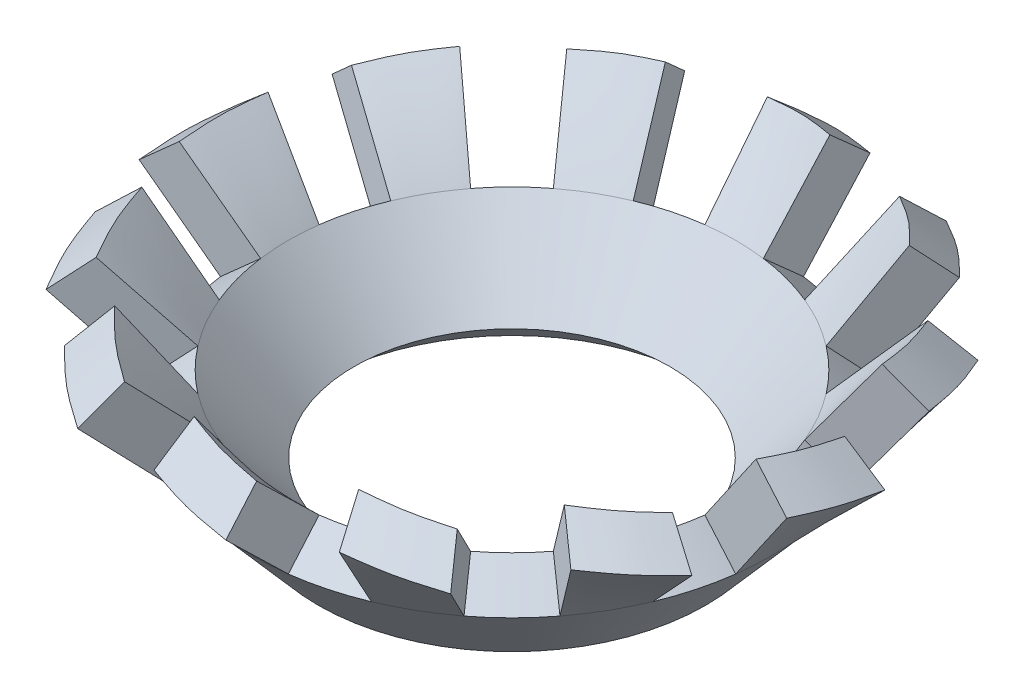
ISO-10303-21;
HEADER;
FILE_DESCRIPTION(('STEP AP214'),'2;1');
FILE_NAME('part.step','',(''),(''),'','','');
FILE_SCHEMA(('AUTOMOTIVE_DESIGN { 1 0 10303 214 1 1 1 1 }'));
ENDSEC;
DATA;
#1=APPLICATION_CONTEXT('core data for automotive mechanical design processes');
#2=APPLICATION_PROTOCOL_DEFINITION('international standard','automotive_design',2000,#1);
#3=PRODUCT_CONTEXT('',#1,'mechanical');
#4=PRODUCT('Part','Part','',(#3));
#5=PRODUCT_RELATED_PRODUCT_CATEGORY('part','',(#4));
#6=PRODUCT_DEFINITION_FORMATION('','',#4);
#7=PRODUCT_DEFINITION_CONTEXT('part definition',#1,'design');
#8=PRODUCT_DEFINITION('design','',#6,#7);
#9=PRODUCT_DEFINITION_SHAPE('','',#8);
#10=(LENGTH_UNIT() NAMED_UNIT(*) SI_UNIT(.MILLI.,.METRE.));
#11=(NAMED_UNIT(*) PLANE_ANGLE_UNIT() SI_UNIT($,.RADIAN.));
#12=(NAMED_UNIT(*) SI_UNIT($,.STERADIAN.) SOLID_ANGLE_UNIT());
#13=UNCERTAINTY_MEASURE_WITH_UNIT(LENGTH_MEASURE(1.E-05),#10,'distance_accuracy_value','');
#14=(GEOMETRIC_REPRESENTATION_CONTEXT(3) GLOBAL_UNCERTAINTY_ASSIGNED_CONTEXT((#13)) GLOBAL_UNIT_ASSIGNED_CONTEXT((#10,
#11,#12)) REPRESENTATION_CONTEXT('',''));
#15=CARTESIAN_POINT('',(0.,0.,0.));
#16=DIRECTION('',(0.,0.,1.));
#17=DIRECTION('',(1.,0.,0.));
#18=AXIS2_PLACEMENT_3D('',#15,#16,#17);
#19=CARTESIAN_POINT('',(0.,1.20681559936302,0.));
#20=DIRECTION('',(0.,-1.,0.));
#21=DIRECTION('',(0.,0.,-1.));
#22=AXIS2_PLACEMENT_3D('',#19,#20,#21);
#23=CONICAL_SURFACE('',#22,2.52286895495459,0.855211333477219);
#24=CARTESIAN_POINT('',(0.,0.856873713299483,0.));
#25=DIRECTION('',(0.,-1.,0.));
#26=DIRECTION('',(0.,0.,-1.));
#27=AXIS2_PLACEMENT_3D('',#24,#25,#26);
#28=CIRCLE('',#27,2.92543104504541);
#29=CARTESIAN_POINT('',(1.11951399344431,0.856873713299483,2.70274586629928));
#30=VERTEX_POINT('',#29);
#31=CARTESIAN_POINT('',(0.381845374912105,0.856873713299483,2.90040357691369));
#32=VERTEX_POINT('',#31);
#33=EDGE_CURVE('E786',#30,#32,#28,.T.);
#34=ORIENTED_EDGE('',*,*,#33,.F.);
#35=DIRECTION('',(-0.288814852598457,0.656059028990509,-0.697260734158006));
#36=VECTOR('',#35,1.);
#37=CARTESIAN_POINT('',(1.11951399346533,0.856873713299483,2.70274586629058));
#38=LINE('',#37,#36);
#39=CARTESIAN_POINT('',(0.965460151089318,1.20681559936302,2.33082699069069));
#40=VERTEX_POINT('',#39);
#41=EDGE_CURVE('E1444',#30,#40,#38,.T.);
#42=ORIENTED_EDGE('',*,*,#41,.T.);
#43=CARTESIAN_POINT('',(0.,1.20681559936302,0.));
#44=DIRECTION('',(0.,-1.,0.));
#45=DIRECTION('',(0.,0.,-1.));
#46=AXIS2_PLACEMENT_3D('',#43,#44,#45);
#47=CIRCLE('',#46,2.52286895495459);
#48=CARTESIAN_POINT('',(0.329300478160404,1.20681559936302,2.50128546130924));
#49=VERTEX_POINT('',#48);
#50=EDGE_CURVE('E561',#40,#49,#47,.T.);
#51=ORIENTED_EDGE('',*,*,#50,.T.);
#52=DIRECTION('',(-0.0985093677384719,0.65605902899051,-0.748252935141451));
#53=VECTOR('',#52,1.);
#54=CARTESIAN_POINT('',(0.329300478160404,1.20681559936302,2.50128546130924));
#55=LINE('',#54,#53);
#56=EDGE_CURVE('E799',#32,#49,#55,.T.);
#57=ORIENTED_EDGE('',*,*,#56,.F.);
#58=EDGE_LOOP('',(#34,#42,#51,#57));
#59=FACE_BOUND('',#58,.T.);
#60=ADVANCED_FACE('F134',(#59),#23,.T.);
#61=CARTESIAN_POINT('',(2.00152651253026,1.20681559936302,1.53582531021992));
#62=VERTEX_POINT('',#61);
#63=CARTESIAN_POINT('',(1.53582531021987,1.20681559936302,2.0015265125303));
#64=VERTEX_POINT('',#63);
#65=EDGE_CURVE('E548',#62,#64,#47,.T.);
#66=ORIENTED_EDGE('',*,*,#65,.T.);
#67=DIRECTION('',(-0.459438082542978,0.65605902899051,-0.598751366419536));
#68=VECTOR('',#67,1.);
#69=CARTESIAN_POINT('',(1.53582531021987,1.20681559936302,2.0015265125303));
#70=LINE('',#69,#68);
#71=CARTESIAN_POINT('',(1.78088958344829,0.856873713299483,2.32090049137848));
#72=VERTEX_POINT('',#71);
#73=EDGE_CURVE('E514',#72,#64,#70,.T.);
#74=ORIENTED_EDGE('',*,*,#73,.F.);
#75=CARTESIAN_POINT('',(2.32090049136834,0.856873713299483,1.7808895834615));
#76=VERTEX_POINT('',#75);
#77=EDGE_CURVE('E574',#76,#72,#28,.T.);
#78=ORIENTED_EDGE('',*,*,#77,.F.);
#79=DIRECTION('',(-0.598751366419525,0.656059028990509,-0.459438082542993));
#80=VECTOR('',#79,1.);
#81=CARTESIAN_POINT('',(2.32090049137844,0.856873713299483,1.78088958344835));
#82=LINE('',#81,#80);
#83=EDGE_CURVE('E558',#76,#62,#82,.T.);
#84=ORIENTED_EDGE('',*,*,#83,.T.);
#85=EDGE_LOOP('',(#66,#74,#78,#84));
#86=FACE_BOUND('',#85,.T.);
#87=ADVANCED_FACE('F557',(#86),#23,.T.);
#88=CARTESIAN_POINT('',(2.50128546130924,1.20681559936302,0.32930047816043));
#89=VERTEX_POINT('',#88);
#90=CARTESIAN_POINT('',(2.33082699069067,1.20681559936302,0.965460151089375));
#91=VERTEX_POINT('',#90);
#92=EDGE_CURVE('E560',#89,#91,#47,.T.);
#93=ORIENTED_EDGE('',*,*,#92,.T.);
#94=DIRECTION('',(-0.697260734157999,0.65605902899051,-0.288814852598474));
#95=VECTOR('',#94,1.);
#96=CARTESIAN_POINT('',(2.33082699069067,1.20681559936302,0.965460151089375));
#97=LINE('',#96,#95);
#98=CARTESIAN_POINT('',(2.70274586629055,0.856873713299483,1.1195139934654));
#99=VERTEX_POINT('',#98);
#100=EDGE_CURVE('E1100',#99,#91,#97,.T.);
#101=ORIENTED_EDGE('',*,*,#100,.F.);
#102=CARTESIAN_POINT('',(2.90040357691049,0.856873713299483,0.381845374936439));
#103=VERTEX_POINT('',#102);
#104=EDGE_CURVE('E629',#103,#99,#28,.T.);
#105=ORIENTED_EDGE('',*,*,#104,.F.);
#106=DIRECTION('',(-0.74825293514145,0.656059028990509,-0.0985093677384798));
#107=VECTOR('',#106,1.);
#108=CARTESIAN_POINT('',(2.90040357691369,0.856873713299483,0.381845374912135));
#109=LINE('',#108,#107);
#110=EDGE_CURVE('E1093',#103,#89,#109,.T.);
#111=ORIENTED_EDGE('',*,*,#110,.T.);
#112=EDGE_LOOP('',(#93,#101,#105,#111));
#113=FACE_BOUND('',#112,.T.);
#114=ADVANCED_FACE('F1228',(#113),#23,.T.);
#115=CARTESIAN_POINT('',(2.33082699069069,1.20681559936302,-0.965460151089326));
#116=VERTEX_POINT('',#115);
#117=CARTESIAN_POINT('',(2.50128546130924,1.20681559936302,-0.329300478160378));
#118=VERTEX_POINT('',#117);
#119=EDGE_CURVE('E566',#116,#118,#47,.T.);
#120=ORIENTED_EDGE('',*,*,#119,.T.);
#121=DIRECTION('',(-0.748252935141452,0.65605902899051,0.098509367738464));
#122=VECTOR('',#121,1.);
#123=CARTESIAN_POINT('',(2.50128546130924,1.20681559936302,-0.329300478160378));
#124=LINE('',#123,#122);
#125=CARTESIAN_POINT('',(2.90040357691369,0.856873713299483,-0.381845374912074));
#126=VERTEX_POINT('',#125);
#127=EDGE_CURVE('E1037',#126,#118,#124,.T.);
#128=ORIENTED_EDGE('',*,*,#127,.F.);
#129=CARTESIAN_POINT('',(2.70274586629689,0.856873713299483,-1.11951399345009));
#130=VERTEX_POINT('',#129);
#131=EDGE_CURVE('E830',#130,#126,#28,.T.);
#132=ORIENTED_EDGE('',*,*,#131,.F.);
#133=DIRECTION('',(-0.697260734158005,0.656059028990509,0.288814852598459));
#134=VECTOR('',#133,1.);
#135=CARTESIAN_POINT('',(2.70274586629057,0.856873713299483,-1.11951399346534));
#136=LINE('',#135,#134);
#137=EDGE_CURVE('E1030',#130,#116,#136,.T.);
#138=ORIENTED_EDGE('',*,*,#137,.T.);
#139=EDGE_LOOP('',(#120,#128,#132,#138));
#140=FACE_BOUND('',#139,.T.);
#141=ADVANCED_FACE('F1298',(#140),#23,.T.);
#142=CARTESIAN_POINT('',(1.53582531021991,1.20681559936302,-2.00152651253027));
#143=VERTEX_POINT('',#142);
#144=CARTESIAN_POINT('',(2.00152651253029,1.20681559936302,-1.53582531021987));
#145=VERTEX_POINT('',#144);
#146=EDGE_CURVE('E620',#143,#145,#47,.T.);
#147=ORIENTED_EDGE('',*,*,#146,.T.);
#148=DIRECTION('',(-0.598751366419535,0.65605902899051,0.45943808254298));
#149=VECTOR('',#148,1.);
#150=CARTESIAN_POINT('',(2.00152651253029,1.20681559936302,-1.53582531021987));
#151=LINE('',#150,#149);
#152=CARTESIAN_POINT('',(2.32090049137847,0.856873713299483,-1.7808895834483));
#153=VERTEX_POINT('',#152);
#154=EDGE_CURVE('E843',#153,#145,#151,.T.);
#155=ORIENTED_EDGE('',*,*,#154,.F.);
#156=CARTESIAN_POINT('',(1.7808895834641,0.856873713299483,-2.32090049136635));
#157=VERTEX_POINT('',#156);
#158=EDGE_CURVE('E827',#157,#153,#28,.T.);
#159=ORIENTED_EDGE('',*,*,#158,.F.);
#160=DIRECTION('',(-0.45943808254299,0.656059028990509,0.598751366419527));
#161=VECTOR('',#160,1.);
#162=CARTESIAN_POINT('',(1.78088958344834,0.856873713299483,-2.32090049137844));
#163=LINE('',#162,#161);
#164=EDGE_CURVE('E849',#157,#143,#163,.T.);
#165=ORIENTED_EDGE('',*,*,#164,.T.);
#166=EDGE_LOOP('',(#147,#155,#159,#165));
#167=FACE_BOUND('',#166,.T.);
#168=ADVANCED_FACE('F989',(#167),#23,.T.);
#169=CARTESIAN_POINT('',(0.329300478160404,1.20681559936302,-2.50128546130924));
#170=VERTEX_POINT('',#169);
#171=CARTESIAN_POINT('',(0.965460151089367,1.20681559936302,-2.33082699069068));
#172=VERTEX_POINT('',#171);
#173=EDGE_CURVE('E615',#170,#172,#47,.T.);
#174=ORIENTED_EDGE('',*,*,#173,.T.);
#175=DIRECTION('',(-0.288814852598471,0.65605902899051,0.697260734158));
#176=VECTOR('',#175,1.);
#177=CARTESIAN_POINT('',(0.965460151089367,1.20681559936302,-2.33082699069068));
#178=LINE('',#177,#176);
#179=CARTESIAN_POINT('',(1.11951399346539,0.856873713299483,-2.70274586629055));
#180=VERTEX_POINT('',#179);
#181=EDGE_CURVE('E938',#180,#172,#178,.T.);
#182=ORIENTED_EDGE('',*,*,#181,.F.);
#183=CARTESIAN_POINT('',(0.381845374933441,0.856873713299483,-2.90040357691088));
#184=VERTEX_POINT('',#183);
#185=EDGE_CURVE('E824',#184,#180,#28,.T.);
#186=ORIENTED_EDGE('',*,*,#185,.F.);
#187=DIRECTION('',(-0.0985093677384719,0.656059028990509,0.748252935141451));
#188=VECTOR('',#187,1.);
#189=CARTESIAN_POINT('',(0.381845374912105,0.856873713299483,-2.90040357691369));
#190=LINE('',#189,#188);
#191=EDGE_CURVE('E1734',#184,#170,#190,.T.);
#192=ORIENTED_EDGE('',*,*,#191,.T.);
#193=EDGE_LOOP('',(#174,#182,#186,#192));
#194=FACE_BOUND('',#193,.T.);
#195=ADVANCED_FACE('F944',(#194),#23,.T.);
#196=CARTESIAN_POINT('',(-0.965460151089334,1.20681559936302,-2.33082699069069));
#197=VERTEX_POINT('',#196);
#198=CARTESIAN_POINT('',(-0.329300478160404,1.20681559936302,-2.50128546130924));
#199=VERTEX_POINT('',#198);
#200=EDGE_CURVE('E610',#197,#199,#47,.T.);
#201=ORIENTED_EDGE('',*,*,#200,.T.);
#202=DIRECTION('',(0.0985093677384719,0.65605902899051,0.748252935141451));
#203=VECTOR('',#202,1.);
#204=CARTESIAN_POINT('',(-0.329300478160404,1.20681559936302,-2.50128546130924));
#205=LINE('',#204,#203);
#206=CARTESIAN_POINT('',(-0.381845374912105,0.856873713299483,-2.90040357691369));
#207=VERTEX_POINT('',#206);
#208=EDGE_CURVE('E1795',#207,#199,#205,.T.);
#209=ORIENTED_EDGE('',*,*,#208,.F.);
#210=CARTESIAN_POINT('',(-1.11951399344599,0.856873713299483,-2.70274586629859));
#211=VERTEX_POINT('',#210);
#212=EDGE_CURVE('E821',#211,#207,#28,.T.);
#213=ORIENTED_EDGE('',*,*,#212,.F.);
#214=DIRECTION('',(0.288814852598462,0.656059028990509,0.697260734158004));
#215=VECTOR('',#214,1.);
#216=CARTESIAN_POINT('',(-1.11951399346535,0.856873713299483,-2.70274586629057));
#217=LINE('',#216,#215);
#218=EDGE_CURVE('E1824',#211,#197,#217,.T.);
#219=ORIENTED_EDGE('',*,*,#218,.T.);
#220=EDGE_LOOP('',(#201,#209,#213,#219));
#221=FACE_BOUND('',#220,.T.);
#222=ADVANCED_FACE('F1905',(#221),#23,.T.);
#223=CARTESIAN_POINT('',(-2.00152651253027,1.20681559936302,-1.5358253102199));
#224=VERTEX_POINT('',#223);
#225=CARTESIAN_POINT('',(-1.53582531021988,1.20681559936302,-2.00152651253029));
#226=VERTEX_POINT('',#225);
#227=EDGE_CURVE('E605',#224,#226,#47,.T.);
#228=ORIENTED_EDGE('',*,*,#227,.T.);
#229=DIRECTION('',(0.459438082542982,0.65605902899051,0.598751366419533));
#230=VECTOR('',#229,1.);
#231=CARTESIAN_POINT('',(-1.53582531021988,1.20681559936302,-2.00152651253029));
#232=LINE('',#231,#230);
#233=CARTESIAN_POINT('',(-1.78088958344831,0.856873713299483,-2.32090049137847));
#234=VERTEX_POINT('',#233);
#235=EDGE_CURVE('E2084',#234,#226,#232,.T.);
#236=ORIENTED_EDGE('',*,*,#235,.F.);
#237=CARTESIAN_POINT('',(-2.32090049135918,0.856873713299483,-1.78088958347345));
#238=VERTEX_POINT('',#237);
#239=EDGE_CURVE('E818',#238,#234,#28,.T.);
#240=ORIENTED_EDGE('',*,*,#239,.F.);
#241=DIRECTION('',(0.598751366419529,0.656059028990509,0.459438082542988));
#242=VECTOR('',#241,1.);
#243=CARTESIAN_POINT('',(-2.32090049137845,0.856873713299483,-1.78088958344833));
#244=LINE('',#243,#242);
#245=EDGE_CURVE('E2077',#238,#224,#244,.T.);
#246=ORIENTED_EDGE('',*,*,#245,.T.);
#247=EDGE_LOOP('',(#228,#236,#240,#246));
#248=FACE_BOUND('',#247,.T.);
#249=ADVANCED_FACE('F2165',(#248),#23,.T.);
#250=CARTESIAN_POINT('',(-2.50128546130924,1.20681559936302,-0.329300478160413));
#251=VERTEX_POINT('',#250);
#252=CARTESIAN_POINT('',(-2.33082699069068,1.20681559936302,-0.965460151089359));
#253=VERTEX_POINT('',#252);
#254=EDGE_CURVE('E600',#251,#253,#47,.T.);
#255=ORIENTED_EDGE('',*,*,#254,.T.);
#256=DIRECTION('',(0.697260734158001,0.65605902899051,0.288814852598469));
#257=VECTOR('',#256,1.);
#258=CARTESIAN_POINT('',(-2.33082699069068,1.20681559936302,-0.965460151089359));
#259=LINE('',#258,#257);
#260=CARTESIAN_POINT('',(-2.70274586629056,0.856873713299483,-1.11951399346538));
#261=VERTEX_POINT('',#260);
#262=EDGE_CURVE('E2028',#261,#253,#259,.T.);
#263=ORIENTED_EDGE('',*,*,#262,.F.);
#264=CARTESIAN_POINT('',(-2.90040357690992,0.856873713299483,-0.381845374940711));
#265=VERTEX_POINT('',#264);
#266=EDGE_CURVE('E815',#265,#261,#28,.T.);
#267=ORIENTED_EDGE('',*,*,#266,.F.);
#268=DIRECTION('',(0.748252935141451,0.656059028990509,0.0985093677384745));
#269=VECTOR('',#268,1.);
#270=CARTESIAN_POINT('',(-2.90040357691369,0.856873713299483,-0.381845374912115));
#271=LINE('',#270,#269);
#272=EDGE_CURVE('E2021',#265,#251,#271,.T.);
#273=ORIENTED_EDGE('',*,*,#272,.T.);
#274=EDGE_LOOP('',(#255,#263,#267,#273));
#275=FACE_BOUND('',#274,.T.);
#276=ADVANCED_FACE('F1244',(#275),#23,.T.);
#277=CARTESIAN_POINT('',(-2.33082699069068,1.20681559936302,0.965460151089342));
#278=VERTEX_POINT('',#277);
#279=CARTESIAN_POINT('',(-2.50128546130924,1.20681559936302,0.329300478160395));
#280=VERTEX_POINT('',#279);
#281=EDGE_CURVE('E595',#278,#280,#47,.T.);
#282=ORIENTED_EDGE('',*,*,#281,.T.);
#283=DIRECTION('',(0.748252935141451,0.65605902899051,-0.0985093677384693));
#284=VECTOR('',#283,1.);
#285=CARTESIAN_POINT('',(-2.50128546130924,1.20681559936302,0.329300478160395));
#286=LINE('',#285,#284);
#287=CARTESIAN_POINT('',(-2.90040357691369,0.856873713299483,0.381845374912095));
#288=VERTEX_POINT('',#287);
#289=EDGE_CURVE('E1971',#288,#280,#286,.T.);
#290=ORIENTED_EDGE('',*,*,#289,.F.);
#291=CARTESIAN_POINT('',(-2.70274586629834,0.856873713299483,1.1195139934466));
#292=VERTEX_POINT('',#291);
#293=EDGE_CURVE('E812',#292,#288,#28,.T.);
#294=ORIENTED_EDGE('',*,*,#293,.F.);
#295=DIRECTION('',(0.697260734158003,0.656059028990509,-0.288814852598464));
#296=VECTOR('',#295,1.);
#297=CARTESIAN_POINT('',(-2.70274586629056,0.856873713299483,1.11951399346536));
#298=LINE('',#297,#296);
#299=EDGE_CURVE('E1964',#292,#278,#298,.T.);
#300=ORIENTED_EDGE('',*,*,#299,.T.);
#301=EDGE_LOOP('',(#282,#290,#294,#300));
#302=FACE_BOUND('',#301,.T.);
#303=ADVANCED_FACE('F1237',(#302),#23,.T.);
#304=CARTESIAN_POINT('',(-1.53582531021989,1.20681559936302,2.00152651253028));
#305=VERTEX_POINT('',#304);
#306=CARTESIAN_POINT('',(-2.00152651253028,1.20681559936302,1.53582531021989));
#307=VERTEX_POINT('',#306);
#308=EDGE_CURVE('E590',#305,#307,#47,.T.);
#309=ORIENTED_EDGE('',*,*,#308,.T.);
#310=DIRECTION('',(0.598751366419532,0.65605902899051,-0.459438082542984));
#311=VECTOR('',#310,1.);
#312=CARTESIAN_POINT('',(-2.00152651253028,1.20681559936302,1.53582531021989));
#313=LINE('',#312,#311);
#314=CARTESIAN_POINT('',(-2.32090049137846,0.856873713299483,1.78088958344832));
#315=VERTEX_POINT('',#314);
#316=EDGE_CURVE('E1251',#315,#307,#313,.T.);
#317=ORIENTED_EDGE('',*,*,#316,.F.);
#318=CARTESIAN_POINT('',(-1.78088958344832,0.856873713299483,2.32090049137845));
#319=VERTEX_POINT('',#318);
#320=EDGE_CURVE('E809',#319,#315,#28,.T.);
#321=ORIENTED_EDGE('',*,*,#320,.F.);
#322=DIRECTION('',(0.459438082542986,0.656059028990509,-0.59875136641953));
#323=VECTOR('',#322,1.);
#324=CARTESIAN_POINT('',(-1.78088958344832,0.856873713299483,2.32090049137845));
#325=LINE('',#324,#323);
#326=EDGE_CURVE('E1254',#319,#305,#325,.T.);
#327=ORIENTED_EDGE('',*,*,#326,.T.);
#328=EDGE_LOOP('',(#309,#317,#321,#327));
#329=FACE_BOUND('',#328,.T.);
#330=ADVANCED_FACE('F1231',(#329),#23,.T.);
#331=CARTESIAN_POINT('',(0.,0.,0.));
#332=DIRECTION('',(0.,-1.,0.));
#333=DIRECTION('',(0.,0.,-1.));
#334=AXIS2_PLACEMENT_3D('',#331,#332,#333);
#335=CONICAL_SURFACE('',#334,2.18056209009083,0.855211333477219);
#336=CARTESIAN_POINT('',(0.,0.349941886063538,0.));
#337=DIRECTION('',(0.,-1.,0.));
#338=DIRECTION('',(0.,0.,-1.));
#339=AXIS2_PLACEMENT_3D('',#336,#337,#338);
#340=CIRCLE('',#339,1.778);
#341=CARTESIAN_POINT('',(0.,0.349941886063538,-1.778));
#342=VERTEX_POINT('',#341);
#343=EDGE_CURVE('E12',#342,#342,#340,.T.);
#344=ORIENTED_EDGE('',*,*,#343,.F.);
#345=EDGE_LOOP('',(#344));
#346=FACE_BOUND('',#345,.T.);
#347=CARTESIAN_POINT('',(0.,0.,0.));
#348=DIRECTION('',(0.,-1.,0.));
#349=DIRECTION('',(0.,0.,-1.));
#350=AXIS2_PLACEMENT_3D('',#347,#348,#349);
#351=CIRCLE('',#350,2.18056209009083);
#352=CARTESIAN_POINT('',(0.,0.,-2.18056209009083));
#353=VERTEX_POINT('',#352);
#354=EDGE_CURVE('E792',#353,#353,#351,.T.);
#355=ORIENTED_EDGE('',*,*,#354,.T.);
#356=EDGE_LOOP('',(#355));
#357=FACE_BOUND('',#356,.T.);
#358=ADVANCED_FACE('F136',(#346,#357),#335,.F.);
#359=CARTESIAN_POINT('',(0.,0.349941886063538,0.));
#360=DIRECTION('',(0.,1.,0.));
#361=DIRECTION('',(0.,0.,1.));
#362=AXIS2_PLACEMENT_3D('',#359,#360,#361);
#363=CONICAL_SURFACE('',#362,1.778,0.715584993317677);
#364=CARTESIAN_POINT('',(0.329300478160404,1.20681559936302,2.50128546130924));
#365=CARTESIAN_POINT('',(0.219858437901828,1.20681559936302,2.51211953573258));
#366=CARTESIAN_POINT('',(0.00224714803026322,1.20681559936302,2.53366168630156));
#367=CARTESIAN_POINT('',(-0.21921637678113,1.20681559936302,2.5120353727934));
#368=CARTESIAN_POINT('',(-0.329300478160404,1.20681559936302,2.50128546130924));
#369=B_SPLINE_CURVE_WITH_KNOTS('',3,(#364,#365,#366,#367,#368),.UNSPECIFIED.,.F.,.F.,(4,1,4),
(0.,0.502924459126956,1.),.UNSPECIFIED.);
#370=CARTESIAN_POINT('',(0.00411359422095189,1.20681559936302,2.52286707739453));
#371=VERTEX_POINT('',#370);
#372=EDGE_CURVE('E144',#49,#371,#369,.T.);
#373=ORIENTED_EDGE('',*,*,#372,.F.);
#374=ORIENTED_EDGE('',*,*,#50,.F.);
#375=CARTESIAN_POINT('',(1.53582531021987,1.20681559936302,2.0015265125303));
#376=CARTESIAN_POINT('',(1.44646276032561,1.20681559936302,2.06563011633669));
#377=CARTESIAN_POINT('',(1.26877693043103,1.20681559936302,2.19309181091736));
#378=CARTESIAN_POINT('',(1.06617073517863,1.20681559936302,2.28509463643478));
#379=CARTESIAN_POINT('',(0.965460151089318,1.20681559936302,2.33082699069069));
#380=B_SPLINE_CURVE_WITH_KNOTS('',3,(#375,#376,#377,#378,#379),.UNSPECIFIED.,.F.,.F.,(4,1,4),
(0.,0.502924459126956,1.),.UNSPECIFIED.);
#381=CARTESIAN_POINT('',(1.26488988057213,1.20681559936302,2.18286998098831));
#382=VERTEX_POINT('',#381);
#383=EDGE_CURVE('E550',#382,#40,#380,.T.);
#384=ORIENTED_EDGE('',*,*,#383,.F.);
#385=EDGE_CURVE('E532',#64,#382,#380,.T.);
#386=ORIENTED_EDGE('',*,*,#385,.F.);
#387=ORIENTED_EDGE('',*,*,#65,.F.);
#388=CARTESIAN_POINT('',(2.33082699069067,1.20681559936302,0.965460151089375));
#389=CARTESIAN_POINT('',(2.28548855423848,1.20681559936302,1.06565677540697));
#390=CARTESIAN_POINT('',(2.19533895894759,1.20681559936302,1.26488475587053));
#391=CARTESIAN_POINT('',(2.06587825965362,1.20681559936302,1.44586463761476));
#392=CARTESIAN_POINT('',(2.00152651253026,1.20681559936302,1.53582531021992));
#393=B_SPLINE_CURVE_WITH_KNOTS('',3,(#388,#389,#390,#391,#392),.UNSPECIFIED.,.F.,.F.,(4,1,4),
(0.,0.502924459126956,1.),.UNSPECIFIED.);
#394=CARTESIAN_POINT('',(2.18686176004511,1.20681559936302,1.25797591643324));
#395=VERTEX_POINT('',#394);
#396=EDGE_CURVE('E1136',#395,#62,#393,.T.);
#397=ORIENTED_EDGE('',*,*,#396,.F.);
#398=EDGE_CURVE('E1131',#91,#395,#393,.T.);
#399=ORIENTED_EDGE('',*,*,#398,.F.);
#400=ORIENTED_EDGE('',*,*,#92,.F.);
#401=CARTESIAN_POINT('',(2.50128546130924,1.20681559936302,-0.329300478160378));
#402=CARTESIAN_POINT('',(2.51211953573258,1.20681559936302,-0.219858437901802));
#403=CARTESIAN_POINT('',(2.53366168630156,1.20681559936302,-0.00224714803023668));
#404=CARTESIAN_POINT('',(2.5120353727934,1.20681559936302,0.219216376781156));
#405=CARTESIAN_POINT('',(2.50128546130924,1.20681559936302,0.32930047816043));
#406=B_SPLINE_CURVE_WITH_KNOTS('',3,(#401,#402,#403,#404,#405),.UNSPECIFIED.,.F.,.F.,(4,1,4),
(0.,0.502924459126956,1.),.UNSPECIFIED.);
#407=CARTESIAN_POINT('',(2.5228657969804,1.20681559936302,-0.0039917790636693));
#408=VERTEX_POINT('',#407);
#409=EDGE_CURVE('E1072',#408,#89,#406,.T.);
#410=ORIENTED_EDGE('',*,*,#409,.F.);
#411=EDGE_CURVE('E1067',#118,#408,#406,.T.);
#412=ORIENTED_EDGE('',*,*,#411,.F.);
#413=ORIENTED_EDGE('',*,*,#119,.F.);
#414=CARTESIAN_POINT('',(2.00152651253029,1.20681559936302,-1.53582531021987));
#415=CARTESIAN_POINT('',(2.06563011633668,1.20681559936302,-1.44646276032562));
#416=CARTESIAN_POINT('',(2.19309181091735,1.20681559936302,-1.26877693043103));
#417=CARTESIAN_POINT('',(2.28509463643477,1.20681559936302,-1.06617073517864));
#418=CARTESIAN_POINT('',(2.33082699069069,1.20681559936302,-0.965460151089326));
#419=B_SPLINE_CURVE_WITH_KNOTS('',3,(#414,#415,#416,#417,#418),.UNSPECIFIED.,.F.,.F.,(4,1,4),
(0.,0.502924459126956,1.),.UNSPECIFIED.);
#420=CARTESIAN_POINT('',(2.18286998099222,1.20681559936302,-1.26488988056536));
#421=VERTEX_POINT('',#420);
#422=EDGE_CURVE('E1010',#421,#116,#419,.T.);
#423=ORIENTED_EDGE('',*,*,#422,.F.);
#424=EDGE_CURVE('E1005',#145,#421,#419,.T.);
#425=ORIENTED_EDGE('',*,*,#424,.F.);
#426=ORIENTED_EDGE('',*,*,#146,.F.);
#427=CARTESIAN_POINT('',(0.965460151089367,1.20681559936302,-2.33082699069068));
#428=CARTESIAN_POINT('',(1.06565677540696,1.20681559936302,-2.28548855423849));
#429=CARTESIAN_POINT('',(1.26488475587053,1.20681559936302,-2.19533895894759));
#430=CARTESIAN_POINT('',(1.44586463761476,1.20681559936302,-2.06587825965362));
#431=CARTESIAN_POINT('',(1.53582531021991,1.20681559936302,-2.00152651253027));
#432=B_SPLINE_CURVE_WITH_KNOTS('',3,(#427,#428,#429,#430,#431),.UNSPECIFIED.,.F.,.F.,(4,1,4),
(0.,0.502924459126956,1.),.UNSPECIFIED.);
#433=CARTESIAN_POINT('',(1.25797591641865,1.20681559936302,-2.1868617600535));
#434=VERTEX_POINT('',#433);
#435=EDGE_CURVE('E844',#434,#143,#432,.T.);
#436=ORIENTED_EDGE('',*,*,#435,.F.);
#437=EDGE_CURVE('E848',#172,#434,#432,.T.);
#438=ORIENTED_EDGE('',*,*,#437,.F.);
#439=ORIENTED_EDGE('',*,*,#173,.F.);
#440=CARTESIAN_POINT('',(-0.329300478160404,1.20681559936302,-2.50128546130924));
#441=CARTESIAN_POINT('',(-0.219858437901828,1.20681559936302,-2.51211953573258));
#442=CARTESIAN_POINT('',(-0.00224714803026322,1.20681559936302,-2.53366168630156));
#443=CARTESIAN_POINT('',(0.21921637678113,1.20681559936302,-2.5120353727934));
#444=CARTESIAN_POINT('',(0.329300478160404,1.20681559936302,-2.50128546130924));
#445=B_SPLINE_CURVE_WITH_KNOTS('',3,(#440,#441,#442,#443,#444),.UNSPECIFIED.,.F.,.F.,(4,1,4),
(0.,0.502924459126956,1.),.UNSPECIFIED.);
#446=CARTESIAN_POINT('',(-0.00399177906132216,1.20681559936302,-2.52286579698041));
#447=VERTEX_POINT('',#446);
#448=EDGE_CURVE('E1730',#447,#170,#445,.T.);
#449=ORIENTED_EDGE('',*,*,#448,.F.);
#450=EDGE_CURVE('E1726',#199,#447,#445,.T.);
#451=ORIENTED_EDGE('',*,*,#450,.F.);
#452=ORIENTED_EDGE('',*,*,#200,.F.);
#453=CARTESIAN_POINT('',(-1.53582531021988,1.20681559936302,-2.00152651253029));
#454=CARTESIAN_POINT('',(-1.44646276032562,1.20681559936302,-2.06563011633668));
#455=CARTESIAN_POINT('',(-1.26877693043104,1.20681559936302,-2.19309181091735));
#456=CARTESIAN_POINT('',(-1.06617073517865,1.20681559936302,-2.28509463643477));
#457=CARTESIAN_POINT('',(-0.965460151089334,1.20681559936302,-2.33082699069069));
#458=B_SPLINE_CURVE_WITH_KNOTS('',3,(#453,#454,#455,#456,#457),.UNSPECIFIED.,.F.,.F.,(4,1,4),
(0.,0.502924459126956,1.),.UNSPECIFIED.);
#459=CARTESIAN_POINT('',(-1.26488988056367,1.20681559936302,-2.18286998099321));
#460=VERTEX_POINT('',#459);
#461=EDGE_CURVE('E1818',#460,#197,#458,.T.);
#462=ORIENTED_EDGE('',*,*,#461,.F.);
#463=EDGE_CURVE('E1823',#226,#460,#458,.T.);
#464=ORIENTED_EDGE('',*,*,#463,.F.);
#465=ORIENTED_EDGE('',*,*,#227,.F.);
#466=CARTESIAN_POINT('',(-2.33082699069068,1.20681559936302,-0.965460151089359));
#467=CARTESIAN_POINT('',(-2.28548855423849,1.20681559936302,-1.06565677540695));
#468=CARTESIAN_POINT('',(-2.1953389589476,1.20681559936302,-1.26488475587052));
#469=CARTESIAN_POINT('',(-2.06587825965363,1.20681559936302,-1.44586463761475));
#470=CARTESIAN_POINT('',(-2.00152651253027,1.20681559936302,-1.5358253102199));
#471=B_SPLINE_CURVE_WITH_KNOTS('',3,(#466,#467,#468,#469,#470),.UNSPECIFIED.,.F.,.F.,(4,1,4),
(0.,0.502924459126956,1.),.UNSPECIFIED.);
#472=CARTESIAN_POINT('',(-2.18686176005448,1.20681559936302,-1.25797591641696));
#473=VERTEX_POINT('',#472);
#474=EDGE_CURVE('E2057',#473,#224,#471,.T.);
#475=ORIENTED_EDGE('',*,*,#474,.F.);
#476=EDGE_CURVE('E2052',#253,#473,#471,.T.);
#477=ORIENTED_EDGE('',*,*,#476,.F.);
#478=ORIENTED_EDGE('',*,*,#254,.F.);
#479=CARTESIAN_POINT('',(-2.50128546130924,1.20681559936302,0.329300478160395));
#480=CARTESIAN_POINT('',(-2.51211953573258,1.20681559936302,0.219858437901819));
#481=CARTESIAN_POINT('',(-2.53366168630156,1.20681559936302,0.00224714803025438));
#482=CARTESIAN_POINT('',(-2.5120353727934,1.20681559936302,-0.219216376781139));
#483=CARTESIAN_POINT('',(-2.50128546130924,1.20681559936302,-0.329300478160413));
#484=B_SPLINE_CURVE_WITH_KNOTS('',3,(#479,#480,#481,#482,#483),.UNSPECIFIED.,.F.,.F.,(4,1,4),
(0.,0.502924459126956,1.),.UNSPECIFIED.);
#485=CARTESIAN_POINT('',(-2.52286579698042,1.20681559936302,0.00399177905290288));
#486=VERTEX_POINT('',#485);
#487=EDGE_CURVE('E2000',#486,#251,#484,.T.);
#488=ORIENTED_EDGE('',*,*,#487,.F.);
#489=EDGE_CURVE('E1995',#280,#486,#484,.T.);
#490=ORIENTED_EDGE('',*,*,#489,.F.);
#491=ORIENTED_EDGE('',*,*,#281,.F.);
#492=CARTESIAN_POINT('',(-2.00152651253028,1.20681559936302,1.53582531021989));
#493=CARTESIAN_POINT('',(-2.06563011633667,1.20681559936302,1.44646276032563));
#494=CARTESIAN_POINT('',(-2.19309181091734,1.20681559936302,1.26877693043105));
#495=CARTESIAN_POINT('',(-2.28509463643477,1.20681559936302,1.06617073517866));
#496=CARTESIAN_POINT('',(-2.33082699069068,1.20681559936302,0.965460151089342));
#497=B_SPLINE_CURVE_WITH_KNOTS('',3,(#492,#493,#494,#495,#496),.UNSPECIFIED.,.F.,.F.,(4,1,4),
(0.,0.502924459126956,1.),.UNSPECIFIED.);
#498=CARTESIAN_POINT('',(-2.18286998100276,1.20681559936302,1.26488988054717));
#499=VERTEX_POINT('',#498);
#500=EDGE_CURVE('E1943',#499,#278,#497,.T.);
#501=ORIENTED_EDGE('',*,*,#500,.F.);
#502=EDGE_CURVE('E1938',#307,#499,#497,.T.);
#503=ORIENTED_EDGE('',*,*,#502,.F.);
#504=ORIENTED_EDGE('',*,*,#308,.F.);
#505=CARTESIAN_POINT('',(-0.965460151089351,1.20681559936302,2.33082699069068));
#506=CARTESIAN_POINT('',(-1.06565677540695,1.20681559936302,2.2854885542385));
#507=CARTESIAN_POINT('',(-1.26488475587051,1.20681559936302,2.1953389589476));
#508=CARTESIAN_POINT('',(-1.44586463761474,1.20681559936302,2.06587825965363));
#509=CARTESIAN_POINT('',(-1.53582531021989,1.20681559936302,2.00152651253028));
#510=B_SPLINE_CURVE_WITH_KNOTS('',3,(#505,#506,#507,#508,#509),.UNSPECIFIED.,.F.,.F.,(4,1,4),
(0.,0.502924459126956,1.),.UNSPECIFIED.);
#511=CARTESIAN_POINT('',(-1.25797591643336,1.20681559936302,2.18686176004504));
#512=VERTEX_POINT('',#511);
#513=EDGE_CURVE('E1916',#512,#305,#510,.T.);
#514=ORIENTED_EDGE('',*,*,#513,.F.);
#515=CARTESIAN_POINT('',(-0.965460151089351,1.20681559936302,2.33082699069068));
#516=VERTEX_POINT('',#515);
#517=EDGE_CURVE('E2361',#516,#512,#510,.T.);
#518=ORIENTED_EDGE('',*,*,#517,.F.);
#519=CARTESIAN_POINT('',(-0.329300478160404,1.20681559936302,2.50128546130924));
#520=VERTEX_POINT('',#519);
#521=EDGE_CURVE('E583',#520,#516,#47,.T.);
#522=ORIENTED_EDGE('',*,*,#521,.F.);
#523=CARTESIAN_POINT('',(0.329300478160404,1.20681559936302,2.50128546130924));
#524=CARTESIAN_POINT('',(0.219858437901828,1.20681559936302,2.51211953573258));
#525=CARTESIAN_POINT('',(0.00224714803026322,1.20681559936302,2.53366168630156));
#526=CARTESIAN_POINT('',(-0.21921637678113,1.20681559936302,2.5120353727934));
#527=CARTESIAN_POINT('',(-0.329300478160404,1.20681559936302,2.50128546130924));
#528=B_SPLINE_CURVE_WITH_KNOTS('',3,(#523,#524,#525,#526,#527),.UNSPECIFIED.,.F.,.F.,(4,1,4),
(0.,0.502924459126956,1.),.UNSPECIFIED.);
#529=EDGE_CURVE('E2442',#371,#520,#528,.T.);
#530=ORIENTED_EDGE('',*,*,#529,.F.);
#531=EDGE_LOOP('',(#373,#374,#384,#386,#387,#397,#399,#400,#410,#412,#413,#423,#425,#426,#436,
#438,#439,#449,#451,#452,#462,#464,#465,#475,#477,#478,#488,#490,#491,#501,#503,#504,#514,#518,
#522,#530));
#532=FACE_BOUND('',#531,.T.);
#533=ORIENTED_EDGE('',*,*,#343,.T.);
#534=EDGE_LOOP('',(#533));
#535=FACE_BOUND('',#534,.T.);
#536=ADVANCED_FACE('F545',(#532,#535),#363,.F.);
#537=ORIENTED_EDGE('',*,*,#521,.T.);
#538=DIRECTION('',(0.288814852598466,0.65605902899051,-0.697260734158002));
#539=VECTOR('',#538,1.);
#540=CARTESIAN_POINT('',(-0.965460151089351,1.20681559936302,2.33082699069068));
#541=LINE('',#540,#539);
#542=CARTESIAN_POINT('',(-1.11951399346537,0.856873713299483,2.70274586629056));
#543=VERTEX_POINT('',#542);
#544=EDGE_CURVE('E2417',#543,#516,#541,.T.);
#545=ORIENTED_EDGE('',*,*,#544,.F.);
#546=CARTESIAN_POINT('',(-0.381845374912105,0.856873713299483,2.90040357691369));
#547=VERTEX_POINT('',#546);
#548=EDGE_CURVE('E582',#547,#543,#28,.T.);
#549=ORIENTED_EDGE('',*,*,#548,.F.);
#550=DIRECTION('',(0.0985093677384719,0.656059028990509,-0.748252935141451));
#551=VECTOR('',#550,1.);
#552=CARTESIAN_POINT('',(-0.381845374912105,0.856873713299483,2.90040357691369));
#553=LINE('',#552,#551);
#554=EDGE_CURVE('E2447',#547,#520,#553,.T.);
#555=ORIENTED_EDGE('',*,*,#554,.T.);
#556=EDGE_LOOP('',(#537,#545,#549,#555));
#557=FACE_BOUND('',#556,.T.);
#558=ADVANCED_FACE('F653',(#557),#23,.T.);
#559=CARTESIAN_POINT('',(0.,0.856873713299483,0.));
#560=DIRECTION('',(0.,1.,0.));
#561=DIRECTION('',(0.,0.,1.));
#562=AXIS2_PLACEMENT_3D('',#559,#560,#561);
#563=CONICAL_SURFACE('',#562,2.92543104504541,0.715584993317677);
#564=ORIENTED_EDGE('',*,*,#354,.F.);
#565=EDGE_LOOP('',(#564));
#566=FACE_BOUND('',#565,.T.);
#567=CARTESIAN_POINT('',(-0.381845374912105,0.856873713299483,2.90040357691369));
#568=CARTESIAN_POINT('',(-0.254195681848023,0.856873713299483,2.91286880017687));
#569=CARTESIAN_POINT('',(0.00260571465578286,0.856873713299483,2.93794592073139));
#570=CARTESIAN_POINT('',(0.25494019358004,0.856873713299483,2.91296639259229));
#571=CARTESIAN_POINT('',(0.381845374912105,0.856873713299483,2.90040357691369));
#572=B_SPLINE_CURVE_WITH_KNOTS('',3,(#567,#568,#569,#570,#571),.UNSPECIFIED.,.F.,.F.,(4,1,4),
(0.,0.497075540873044,1.),.UNSPECIFIED.);
#573=CARTESIAN_POINT('',(0.00461223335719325,0.856873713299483,2.92542740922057));
#574=VERTEX_POINT('',#573);
#575=EDGE_CURVE('E569',#32,#574,#572,.F.);
#576=ORIENTED_EDGE('',*,*,#575,.T.);
#577=CARTESIAN_POINT('',(0.381845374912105,0.856873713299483,2.90040357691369));
#578=CARTESIAN_POINT('',(0.25494019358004,0.856873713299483,2.91296639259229));
#579=CARTESIAN_POINT('',(0.00260571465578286,0.856873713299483,2.93794592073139));
#580=CARTESIAN_POINT('',(-0.254195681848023,0.856873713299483,2.91286880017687));
#581=CARTESIAN_POINT('',(-0.381845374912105,0.856873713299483,2.90040357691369));
#582=B_SPLINE_CURVE_WITH_KNOTS('',3,(#577,#578,#579,#580,#581),.UNSPECIFIED.,.F.,.F.,(4,1,4),
(0.,0.502924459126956,1.),.UNSPECIFIED.);
#583=EDGE_CURVE('E2468',#547,#574,#582,.F.);
#584=ORIENTED_EDGE('',*,*,#583,.F.);
#585=ORIENTED_EDGE('',*,*,#548,.T.);
#586=CARTESIAN_POINT('',(-1.78088958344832,0.856873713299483,2.32090049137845));
#587=CARTESIAN_POINT('',(-1.67657431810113,0.856873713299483,2.39552053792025));
#588=CARTESIAN_POINT('',(-1.46671634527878,0.856873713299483,2.54563865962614));
#589=CARTESIAN_POINT('',(-1.23569851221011,0.856873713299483,2.65017299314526));
#590=CARTESIAN_POINT('',(-1.11951399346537,0.856873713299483,2.70274586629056));
#591=B_SPLINE_CURVE_WITH_KNOTS('',3,(#586,#587,#588,#589,#590),.UNSPECIFIED.,.F.,.F.,(4,1,4),
(0.,0.497075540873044,1.),.UNSPECIFIED.);
#592=CARTESIAN_POINT('',(-1.45872080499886,0.856873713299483,2.53580173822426));
#593=VERTEX_POINT('',#592);
#594=EDGE_CURVE('E1919',#543,#593,#591,.F.);
#595=ORIENTED_EDGE('',*,*,#594,.T.);
#596=CARTESIAN_POINT('',(-1.11951399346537,0.856873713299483,2.70274586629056));
#597=CARTESIAN_POINT('',(-1.23569851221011,0.856873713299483,2.65017299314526));
#598=CARTESIAN_POINT('',(-1.46671634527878,0.856873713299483,2.54563865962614));
#599=CARTESIAN_POINT('',(-1.67657431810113,0.856873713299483,2.39552053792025));
#600=CARTESIAN_POINT('',(-1.78088958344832,0.856873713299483,2.32090049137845));
#601=B_SPLINE_CURVE_WITH_KNOTS('',3,(#596,#597,#598,#599,#600),.UNSPECIFIED.,.F.,.F.,(4,1,4),
(0.,0.502924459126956,1.),.UNSPECIFIED.);
#602=EDGE_CURVE('E2373',#319,#593,#601,.F.);
#603=ORIENTED_EDGE('',*,*,#602,.F.);
#604=ORIENTED_EDGE('',*,*,#320,.T.);
#605=CARTESIAN_POINT('',(-2.70274586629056,0.856873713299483,1.11951399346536));
#606=CARTESIAN_POINT('',(-2.64971621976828,0.856873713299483,1.23629448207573));
#607=CARTESIAN_POINT('',(-2.54303294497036,0.856873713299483,1.47122957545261));
#608=CARTESIAN_POINT('',(-2.39523279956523,0.856873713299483,1.67726788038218));
#609=CARTESIAN_POINT('',(-2.32090049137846,0.856873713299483,1.78088958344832));
#610=B_SPLINE_CURVE_WITH_KNOTS('',3,(#605,#606,#607,#608,#609),.UNSPECIFIED.,.F.,.F.,(4,1,4),
(0.,0.497075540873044,1.),.UNSPECIFIED.);
#611=CARTESIAN_POINT('',(-2.53119014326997,0.856873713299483,1.46670832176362));
#612=VERTEX_POINT('',#611);
#613=EDGE_CURVE('E1920',#315,#612,#610,.F.);
#614=ORIENTED_EDGE('',*,*,#613,.T.);
#615=CARTESIAN_POINT('',(-2.32090049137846,0.856873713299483,1.78088958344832));
#616=CARTESIAN_POINT('',(-2.39523279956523,0.856873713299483,1.67726788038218));
#617=CARTESIAN_POINT('',(-2.54303294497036,0.856873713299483,1.47122957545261));
#618=CARTESIAN_POINT('',(-2.64971621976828,0.856873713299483,1.23629448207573));
#619=CARTESIAN_POINT('',(-2.70274586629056,0.856873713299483,1.11951399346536));
#620=B_SPLINE_CURVE_WITH_KNOTS('',3,(#615,#616,#617,#618,#619),.UNSPECIFIED.,.F.,.F.,(4,1,4),
(0.,0.502924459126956,1.),.UNSPECIFIED.);
#621=EDGE_CURVE('E3376',#292,#612,#620,.F.);
#622=ORIENTED_EDGE('',*,*,#621,.F.);
#623=ORIENTED_EDGE('',*,*,#293,.T.);
#624=CARTESIAN_POINT('',(-2.90040357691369,0.856873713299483,-0.381845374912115));
#625=CARTESIAN_POINT('',(-2.91286880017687,0.856873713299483,-0.254195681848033));
#626=CARTESIAN_POINT('',(-2.93794592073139,0.856873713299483,0.00260571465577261));
#627=CARTESIAN_POINT('',(-2.9129663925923,0.856873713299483,0.25494019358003));
#628=CARTESIAN_POINT('',(-2.90040357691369,0.856873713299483,0.381845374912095));
#629=B_SPLINE_CURVE_WITH_KNOTS('',3,(#624,#625,#626,#627,#628),.UNSPECIFIED.,.F.,.F.,(4,1,4),
(0.,0.497075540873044,1.),.UNSPECIFIED.);
#630=CARTESIAN_POINT('',(-2.92542912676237,0.856873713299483,0.0046115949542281));
#631=VERTEX_POINT('',#630);
#632=EDGE_CURVE('E2286',#288,#631,#629,.F.);
#633=ORIENTED_EDGE('',*,*,#632,.T.);
#634=CARTESIAN_POINT('',(-2.90040357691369,0.856873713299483,0.381845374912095));
#635=CARTESIAN_POINT('',(-2.9129663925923,0.856873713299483,0.25494019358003));
#636=CARTESIAN_POINT('',(-2.93794592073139,0.856873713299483,0.00260571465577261));
#637=CARTESIAN_POINT('',(-2.91286880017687,0.856873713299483,-0.254195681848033));
#638=CARTESIAN_POINT('',(-2.90040357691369,0.856873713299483,-0.381845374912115));
#639=B_SPLINE_CURVE_WITH_KNOTS('',3,(#634,#635,#636,#637,#638),.UNSPECIFIED.,.F.,.F.,(4,1,4),
(0.,0.502924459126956,1.),.UNSPECIFIED.);
#640=EDGE_CURVE('E2672',#265,#631,#639,.F.);
#641=ORIENTED_EDGE('',*,*,#640,.F.);
#642=ORIENTED_EDGE('',*,*,#266,.T.);
#643=CARTESIAN_POINT('',(-2.32090049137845,0.856873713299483,-1.78088958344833));
#644=CARTESIAN_POINT('',(-2.39552053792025,0.856873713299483,-1.67657431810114));
#645=CARTESIAN_POINT('',(-2.54563865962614,0.856873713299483,-1.46671634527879));
#646=CARTESIAN_POINT('',(-2.65017299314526,0.856873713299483,-1.23569851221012));
#647=CARTESIAN_POINT('',(-2.70274586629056,0.856873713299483,-1.11951399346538));
#648=B_SPLINE_CURVE_WITH_KNOTS('',3,(#643,#644,#645,#646,#647),.UNSPECIFIED.,.F.,.F.,(4,1,4),
(0.,0.497075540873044,1.),.UNSPECIFIED.);
#649=CARTESIAN_POINT('',(-2.53580173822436,0.856873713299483,-1.45872080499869));
#650=VERTEX_POINT('',#649);
#651=EDGE_CURVE('E1903',#261,#650,#648,.F.);
#652=ORIENTED_EDGE('',*,*,#651,.T.);
#653=CARTESIAN_POINT('',(-2.70274586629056,0.856873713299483,-1.11951399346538));
#654=CARTESIAN_POINT('',(-2.65017299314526,0.856873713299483,-1.23569851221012));
#655=CARTESIAN_POINT('',(-2.54563865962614,0.856873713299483,-1.46671634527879));
#656=CARTESIAN_POINT('',(-2.39552053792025,0.856873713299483,-1.67657431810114));
#657=CARTESIAN_POINT('',(-2.32090049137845,0.856873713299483,-1.78088958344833));
#658=B_SPLINE_CURVE_WITH_KNOTS('',3,(#653,#654,#655,#656,#657),.UNSPECIFIED.,.F.,.F.,(4,1,4),
(0.,0.502924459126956,1.),.UNSPECIFIED.);
#659=EDGE_CURVE('E2178',#238,#650,#658,.F.);
#660=ORIENTED_EDGE('',*,*,#659,.F.);
#661=ORIENTED_EDGE('',*,*,#239,.T.);
#662=CARTESIAN_POINT('',(-1.11951399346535,0.856873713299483,-2.70274586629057));
#663=CARTESIAN_POINT('',(-1.23629448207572,0.856873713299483,-2.64971621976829));
#664=CARTESIAN_POINT('',(-1.4712295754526,0.856873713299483,-2.54303294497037));
#665=CARTESIAN_POINT('',(-1.67726788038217,0.856873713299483,-2.39523279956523));
#666=CARTESIAN_POINT('',(-1.78088958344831,0.856873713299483,-2.32090049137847));
#667=B_SPLINE_CURVE_WITH_KNOTS('',3,(#662,#663,#664,#665,#666),.UNSPECIFIED.,.F.,.F.,(4,1,4),
(0.,0.497075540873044,1.),.UNSPECIFIED.);
#668=CARTESIAN_POINT('',(-1.46670832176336,0.856873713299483,-2.53119014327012));
#669=VERTEX_POINT('',#668);
#670=EDGE_CURVE('E1893',#234,#669,#667,.F.);
#671=ORIENTED_EDGE('',*,*,#670,.T.);
#672=CARTESIAN_POINT('',(-1.78088958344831,0.856873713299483,-2.32090049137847));
#673=CARTESIAN_POINT('',(-1.67726788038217,0.856873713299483,-2.39523279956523));
#674=CARTESIAN_POINT('',(-1.4712295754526,0.856873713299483,-2.54303294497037));
#675=CARTESIAN_POINT('',(-1.23629448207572,0.856873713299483,-2.64971621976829));
#676=CARTESIAN_POINT('',(-1.11951399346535,0.856873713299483,-2.70274586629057));
#677=B_SPLINE_CURVE_WITH_KNOTS('',3,(#672,#673,#674,#675,#676),.UNSPECIFIED.,.F.,.F.,(4,1,4),
(0.,0.502924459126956,1.),.UNSPECIFIED.);
#678=EDGE_CURVE('E1864',#211,#669,#677,.F.);
#679=ORIENTED_EDGE('',*,*,#678,.F.);
#680=ORIENTED_EDGE('',*,*,#212,.T.);
#681=CARTESIAN_POINT('',(0.381845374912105,0.856873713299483,-2.90040357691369));
#682=CARTESIAN_POINT('',(0.254195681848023,0.856873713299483,-2.91286880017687));
#683=CARTESIAN_POINT('',(-0.00260571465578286,0.856873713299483,-2.93794592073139));
#684=CARTESIAN_POINT('',(-0.25494019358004,0.856873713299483,-2.91296639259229));
#685=CARTESIAN_POINT('',(-0.381845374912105,0.856873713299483,-2.90040357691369));
#686=B_SPLINE_CURVE_WITH_KNOTS('',3,(#681,#682,#683,#684,#685),.UNSPECIFIED.,.F.,.F.,(4,1,4),
(0.,0.497075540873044,1.),.UNSPECIFIED.);
#687=CARTESIAN_POINT('',(-0.00461159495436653,0.856873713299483,-2.92542912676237));
#688=VERTEX_POINT('',#687);
#689=EDGE_CURVE('E955',#207,#688,#686,.F.);
#690=ORIENTED_EDGE('',*,*,#689,.T.);
#691=CARTESIAN_POINT('',(-0.381845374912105,0.856873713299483,-2.90040357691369));
#692=CARTESIAN_POINT('',(-0.25494019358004,0.856873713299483,-2.91296639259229));
#693=CARTESIAN_POINT('',(-0.00260571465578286,0.856873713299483,-2.93794592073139));
#694=CARTESIAN_POINT('',(0.254195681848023,0.856873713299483,-2.91286880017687));
#695=CARTESIAN_POINT('',(0.381845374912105,0.856873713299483,-2.90040357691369));
#696=B_SPLINE_CURVE_WITH_KNOTS('',3,(#691,#692,#693,#694,#695),.UNSPECIFIED.,.F.,.F.,(4,1,4),
(0.,0.502924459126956,1.),.UNSPECIFIED.);
#697=EDGE_CURVE('E953',#184,#688,#696,.F.);
#698=ORIENTED_EDGE('',*,*,#697,.F.);
#699=ORIENTED_EDGE('',*,*,#185,.T.);
#700=CARTESIAN_POINT('',(1.78088958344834,0.856873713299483,-2.32090049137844));
#701=CARTESIAN_POINT('',(1.67657431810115,0.856873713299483,-2.39552053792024));
#702=CARTESIAN_POINT('',(1.4667163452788,0.856873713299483,-2.54563865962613));
#703=CARTESIAN_POINT('',(1.23569851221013,0.856873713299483,-2.65017299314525));
#704=CARTESIAN_POINT('',(1.11951399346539,0.856873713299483,-2.70274586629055));
#705=B_SPLINE_CURVE_WITH_KNOTS('',3,(#700,#701,#702,#703,#704),.UNSPECIFIED.,.F.,.F.,(4,1,4),
(0.,0.497075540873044,1.),.UNSPECIFIED.);
#706=CARTESIAN_POINT('',(1.45872080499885,0.856873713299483,-2.53580173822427));
#707=VERTEX_POINT('',#706);
#708=EDGE_CURVE('E933',#180,#707,#705,.F.);
#709=ORIENTED_EDGE('',*,*,#708,.T.);
#710=CARTESIAN_POINT('',(1.11951399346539,0.856873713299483,-2.70274586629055));
#711=CARTESIAN_POINT('',(1.23569851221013,0.856873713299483,-2.65017299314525));
#712=CARTESIAN_POINT('',(1.4667163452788,0.856873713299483,-2.54563865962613));
#713=CARTESIAN_POINT('',(1.67657431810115,0.856873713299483,-2.39552053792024));
#714=CARTESIAN_POINT('',(1.78088958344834,0.856873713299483,-2.32090049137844));
#715=B_SPLINE_CURVE_WITH_KNOTS('',3,(#710,#711,#712,#713,#714),.UNSPECIFIED.,.F.,.F.,(4,1,4),
(0.,0.502924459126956,1.),.UNSPECIFIED.);
#716=EDGE_CURVE('E890',#157,#707,#715,.F.);
#717=ORIENTED_EDGE('',*,*,#716,.F.);
#718=ORIENTED_EDGE('',*,*,#158,.T.);
#719=CARTESIAN_POINT('',(2.70274586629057,0.856873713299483,-1.11951399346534));
#720=CARTESIAN_POINT('',(2.64971621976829,0.856873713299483,-1.23629448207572));
#721=CARTESIAN_POINT('',(2.54303294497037,0.856873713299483,-1.4712295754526));
#722=CARTESIAN_POINT('',(2.39523279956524,0.856873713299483,-1.67726788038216));
#723=CARTESIAN_POINT('',(2.32090049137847,0.856873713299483,-1.7808895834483));
#724=B_SPLINE_CURVE_WITH_KNOTS('',3,(#719,#720,#721,#722,#723),.UNSPECIFIED.,.F.,.F.,(4,1,4),
(0.,0.497075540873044,1.),.UNSPECIFIED.);
#725=CARTESIAN_POINT('',(2.53119014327,0.856873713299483,-1.46670832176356));
#726=VERTEX_POINT('',#725);
#727=EDGE_CURVE('E834',#153,#726,#724,.F.);
#728=ORIENTED_EDGE('',*,*,#727,.T.);
#729=CARTESIAN_POINT('',(2.32090049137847,0.856873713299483,-1.7808895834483));
#730=CARTESIAN_POINT('',(2.39523279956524,0.856873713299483,-1.67726788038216));
#731=CARTESIAN_POINT('',(2.54303294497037,0.856873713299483,-1.4712295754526));
#732=CARTESIAN_POINT('',(2.64971621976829,0.856873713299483,-1.23629448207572));
#733=CARTESIAN_POINT('',(2.70274586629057,0.856873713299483,-1.11951399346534));
#734=B_SPLINE_CURVE_WITH_KNOTS('',3,(#729,#730,#731,#732,#733),.UNSPECIFIED.,.F.,.F.,(4,1,4),
(0.,0.502924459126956,1.),.UNSPECIFIED.);
#735=EDGE_CURVE('E968',#130,#726,#734,.F.);
#736=ORIENTED_EDGE('',*,*,#735,.F.);
#737=ORIENTED_EDGE('',*,*,#131,.T.);
#738=CARTESIAN_POINT('',(2.90040357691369,0.856873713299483,0.381845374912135));
#739=CARTESIAN_POINT('',(2.91286880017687,0.856873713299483,0.254195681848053));
#740=CARTESIAN_POINT('',(2.93794592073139,0.856873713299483,-0.00260571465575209));
#741=CARTESIAN_POINT('',(2.9129663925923,0.856873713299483,-0.25494019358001));
#742=CARTESIAN_POINT('',(2.90040357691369,0.856873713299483,-0.381845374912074));
#743=B_SPLINE_CURVE_WITH_KNOTS('',3,(#738,#739,#740,#741,#742),.UNSPECIFIED.,.F.,.F.,(4,1,4),
(0.,0.497075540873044,1.),.UNSPECIFIED.);
#744=CARTESIAN_POINT('',(2.92542912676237,0.856873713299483,-0.00461159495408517));
#745=VERTEX_POINT('',#744);
#746=EDGE_CURVE('E835',#126,#745,#743,.F.);
#747=ORIENTED_EDGE('',*,*,#746,.T.);
#748=CARTESIAN_POINT('',(2.90040357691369,0.856873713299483,-0.381845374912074));
#749=CARTESIAN_POINT('',(2.9129663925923,0.856873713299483,-0.25494019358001));
#750=CARTESIAN_POINT('',(2.93794592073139,0.856873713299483,-0.00260571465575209));
#751=CARTESIAN_POINT('',(2.91286880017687,0.856873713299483,0.254195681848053));
#752=CARTESIAN_POINT('',(2.90040357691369,0.856873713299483,0.381845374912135));
#753=B_SPLINE_CURVE_WITH_KNOTS('',3,(#748,#749,#750,#751,#752),.UNSPECIFIED.,.F.,.F.,(4,1,4),
(0.,0.502924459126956,1.),.UNSPECIFIED.);
#754=EDGE_CURVE('E636',#103,#745,#753,.F.);
#755=ORIENTED_EDGE('',*,*,#754,.F.);
#756=ORIENTED_EDGE('',*,*,#104,.T.);
#757=CARTESIAN_POINT('',(2.32090049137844,0.856873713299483,1.78088958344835));
#758=CARTESIAN_POINT('',(2.39552053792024,0.856873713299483,1.67657431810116));
#759=CARTESIAN_POINT('',(2.54563865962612,0.856873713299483,1.46671634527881));
#760=CARTESIAN_POINT('',(2.65017299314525,0.856873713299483,1.23569851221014));
#761=CARTESIAN_POINT('',(2.70274586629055,0.856873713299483,1.1195139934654));
#762=B_SPLINE_CURVE_WITH_KNOTS('',3,(#757,#758,#759,#760,#761),.UNSPECIFIED.,.F.,.F.,(4,1,4),
(0.,0.497075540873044,1.),.UNSPECIFIED.);
#763=CARTESIAN_POINT('',(2.53580173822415,0.856873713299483,1.45872080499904));
#764=VERTEX_POINT('',#763);
#765=EDGE_CURVE('E790',#99,#764,#762,.F.);
#766=ORIENTED_EDGE('',*,*,#765,.T.);
#767=CARTESIAN_POINT('',(2.70274586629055,0.856873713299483,1.1195139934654));
#768=CARTESIAN_POINT('',(2.65017299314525,0.856873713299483,1.23569851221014));
#769=CARTESIAN_POINT('',(2.54563865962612,0.856873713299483,1.46671634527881));
#770=CARTESIAN_POINT('',(2.39552053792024,0.856873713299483,1.67657431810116));
#771=CARTESIAN_POINT('',(2.32090049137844,0.856873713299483,1.78088958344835));
#772=B_SPLINE_CURVE_WITH_KNOTS('',3,(#767,#768,#769,#770,#771),.UNSPECIFIED.,.F.,.F.,(4,1,4),
(0.,0.502924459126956,1.),.UNSPECIFIED.);
#773=EDGE_CURVE('E1173',#76,#764,#772,.F.);
#774=ORIENTED_EDGE('',*,*,#773,.F.);
#775=ORIENTED_EDGE('',*,*,#77,.T.);
#776=CARTESIAN_POINT('',(1.11951399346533,0.856873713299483,2.70274586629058));
#777=CARTESIAN_POINT('',(1.23629448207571,0.856873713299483,2.64971621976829));
#778=CARTESIAN_POINT('',(1.47122957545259,0.856873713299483,2.54303294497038));
#779=CARTESIAN_POINT('',(1.67726788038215,0.856873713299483,2.39523279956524));
#780=CARTESIAN_POINT('',(1.78088958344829,0.856873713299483,2.32090049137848));
#781=B_SPLINE_CURVE_WITH_KNOTS('',3,(#776,#777,#778,#779,#780),.UNSPECIFIED.,.F.,.F.,(4,1,4),
(0.,0.497075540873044,1.),.UNSPECIFIED.);
#782=CARTESIAN_POINT('',(1.4667083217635,0.856873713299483,2.53119014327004));
#783=VERTEX_POINT('',#782);
#784=EDGE_CURVE('E774',#72,#783,#781,.F.);
#785=ORIENTED_EDGE('',*,*,#784,.T.);
#786=CARTESIAN_POINT('',(1.78088958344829,0.856873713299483,2.32090049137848));
#787=CARTESIAN_POINT('',(1.67726788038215,0.856873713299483,2.39523279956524));
#788=CARTESIAN_POINT('',(1.47122957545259,0.856873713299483,2.54303294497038));
#789=CARTESIAN_POINT('',(1.23629448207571,0.856873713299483,2.64971621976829));
#790=CARTESIAN_POINT('',(1.11951399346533,0.856873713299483,2.70274586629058));
#791=B_SPLINE_CURVE_WITH_KNOTS('',3,(#786,#787,#788,#789,#790),.UNSPECIFIED.,.F.,.F.,(4,1,4),
(0.,0.502924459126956,1.),.UNSPECIFIED.);
#792=EDGE_CURVE('E783',#30,#783,#791,.F.);
#793=ORIENTED_EDGE('',*,*,#792,.F.);
#794=ORIENTED_EDGE('',*,*,#33,.T.);
#795=EDGE_LOOP('',(#576,#584,#585,#595,#603,#604,#614,#622,#623,#633,#641,#642,#652,#660,#661,
#671,#679,#680,#690,#698,#699,#709,#717,#718,#728,#736,#737,#747,#755,#756,#766,#774,#775,#785,
#793,#794));
#796=FACE_BOUND('',#795,.T.);
#797=ADVANCED_FACE('F642',(#566,#796),#563,.T.);
#798=CARTESIAN_POINT('',(-0.416419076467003,2.12547002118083,3.16301691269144));
#799=DIRECTION('',(0.99144486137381,0.,0.130526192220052));
#800=DIRECTION('',(0.130526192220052,0.,-0.99144486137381));
#801=AXIS2_PLACEMENT_3D('',#798,#799,#800);
#802=PLANE('',#801);
#803=DIRECTION('',(-0.0767213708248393,0.809016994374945,0.582756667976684));
#804=VECTOR('',#803,1.);
#805=CARTESIAN_POINT('',(-0.329300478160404,1.20681559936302,2.50128546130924));
#806=LINE('',#805,#804);
#807=CARTESIAN_POINT('',(-0.416419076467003,2.12547002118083,3.16301691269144));
#808=VERTEX_POINT('',#807);
#809=EDGE_CURVE('E2421',#520,#808,#806,.T.);
#810=ORIENTED_EDGE('',*,*,#809,.F.);
#811=ORIENTED_EDGE('',*,*,#554,.F.);
#812=DIRECTION('',(0.0767213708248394,-0.809016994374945,-0.582756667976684));
#813=VECTOR('',#812,1.);
#814=CARTESIAN_POINT('',(-0.468963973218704,1.7755281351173,3.56213502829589));
#815=LINE('',#814,#813);
#816=CARTESIAN_POINT('',(-0.468963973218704,1.7755281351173,3.56213502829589));
#817=VERTEX_POINT('',#816);
#818=EDGE_CURVE('E2439',#817,#547,#815,.T.);
#819=ORIENTED_EDGE('',*,*,#818,.F.);
#820=DIRECTION('',(-0.098509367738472,-0.656059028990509,0.748252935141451));
#821=VECTOR('',#820,1.);
#822=CARTESIAN_POINT('',(-0.416419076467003,2.12547002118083,3.16301691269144));
#823=LINE('',#822,#821);
#824=EDGE_CURVE('E2430',#808,#817,#823,.T.);
#825=ORIENTED_EDGE('',*,*,#824,.F.);
#826=EDGE_LOOP('',(#810,#811,#819,#825));
#827=FACE_BOUND('',#826,.T.);
#828=ADVANCED_FACE('F652',(#827),#802,.F.);
#829=CARTESIAN_POINT('',(0.488462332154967,1.64567170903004,3.7102397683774));
#830=DIRECTION('',(-0.99144486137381,0.,0.130526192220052));
#831=DIRECTION('',(0.130526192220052,0.,0.99144486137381));
#832=AXIS2_PLACEMENT_3D('',#829,#830,#831);
#833=PLANE('',#832);
#834=DIRECTION('',(-0.0938926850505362,-0.694658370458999,-0.713185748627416));
#835=VECTOR('',#834,1.);
#836=CARTESIAN_POINT('',(0.381845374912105,0.856873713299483,2.90040357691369));
#837=LINE('',#836,#835);
#838=CARTESIAN_POINT('',(0.488462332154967,1.64567170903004,3.7102397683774));
#839=VERTEX_POINT('',#838);
#840=EDGE_CURVE('E2500',#839,#32,#837,.T.);
#841=ORIENTED_EDGE('',*,*,#840,.T.);
#842=ORIENTED_EDGE('',*,*,#56,.T.);
#843=DIRECTION('',(0.0938926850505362,0.694658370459,0.713185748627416));
#844=VECTOR('',#843,1.);
#845=CARTESIAN_POINT('',(0.435917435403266,1.99561359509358,3.31112165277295));
#846=LINE('',#845,#844);
#847=CARTESIAN_POINT('',(0.435917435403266,1.99561359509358,3.31112165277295));
#848=VERTEX_POINT('',#847);
#849=EDGE_CURVE('E2511',#49,#848,#846,.T.);
#850=ORIENTED_EDGE('',*,*,#849,.T.);
#851=DIRECTION('',(0.0985093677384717,-0.65605902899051,0.748252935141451));
#852=VECTOR('',#851,1.);
#853=CARTESIAN_POINT('',(0.488462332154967,1.64567170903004,3.7102397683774));
#854=LINE('',#853,#852);
#855=EDGE_CURVE('E2506',#848,#839,#854,.T.);
#856=ORIENTED_EDGE('',*,*,#855,.T.);
#857=EDGE_LOOP('',(#841,#842,#850,#856));
#858=FACE_BOUND('',#857,.T.);
#859=ADVANCED_FACE('F2521',(#858),#833,.F.);
#860=CARTESIAN_POINT('',(0.381845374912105,0.856873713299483,2.90040357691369));
#861=CARTESIAN_POINT('',(0.25494019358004,0.856873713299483,2.91296639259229));
#862=CARTESIAN_POINT('',(0.00260571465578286,0.856873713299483,2.93794592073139));
#863=CARTESIAN_POINT('',(-0.254195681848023,0.856873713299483,2.91286880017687));
#864=CARTESIAN_POINT('',(-0.381845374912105,0.856873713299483,2.90040357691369));
#865=CARTESIAN_POINT('',(0.488462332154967,1.64567170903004,3.7102397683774));
#866=CARTESIAN_POINT('',(0.324469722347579,1.66883033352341,3.70275188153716));
#867=CARTESIAN_POINT('',(-0.00160829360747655,1.71487825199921,3.68786319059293));
#868=CARTESIAN_POINT('',(-0.313787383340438,1.75539049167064,3.60388068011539));
#869=CARTESIAN_POINT('',(-0.468963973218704,1.7755281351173,3.56213502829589));
#870=B_SPLINE_SURFACE_WITH_KNOTS('',1,3,((#860,#861,#862,#863,#864),(#865,#866,#867,#868,#869)),
.UNSPECIFIED.,.F.,.F.,.F.,(2,2),(4,1,4),(0.,1.),(0.,0.502924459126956,1.),.UNSPECIFIED.);
#871=CARTESIAN_POINT('',(0.488462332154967,1.64567170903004,3.7102397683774));
#872=CARTESIAN_POINT('',(0.324469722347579,1.66883033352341,3.70275188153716));
#873=CARTESIAN_POINT('',(-0.00160829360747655,1.71487825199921,3.68786319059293));
#874=CARTESIAN_POINT('',(-0.313787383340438,1.75539049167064,3.60388068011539));
#875=CARTESIAN_POINT('',(-0.468963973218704,1.7755281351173,3.56213502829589));
#876=B_SPLINE_CURVE_WITH_KNOTS('',3,(#871,#872,#873,#874,#875),.UNSPECIFIED.,.F.,.F.,(4,1,4),
(0.,0.502924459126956,1.),.UNSPECIFIED.);
#877=EDGE_CURVE('E2471',#839,#817,#876,.T.);
#878=ORIENTED_EDGE('',*,*,#840,.F.);
#879=ORIENTED_EDGE('',*,*,#877,.T.);
#880=ORIENTED_EDGE('',*,*,#818,.T.);
#881=ORIENTED_EDGE('',*,*,#583,.T.);
#882=ORIENTED_EDGE('',*,*,#575,.F.);
#883=EDGE_LOOP('',(#878,#879,#880,#881,#882));
#884=FACE_BOUND('',#883,.T.);
#885=ADVANCED_FACE('F2538',(#884),#870,.T.);
#886=CARTESIAN_POINT('',(0.488462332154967,1.64567170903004,3.7102397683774));
#887=CARTESIAN_POINT('',(0.324469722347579,1.66883033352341,3.70275188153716));
#888=CARTESIAN_POINT('',(-0.00160829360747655,1.71487825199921,3.68786319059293));
#889=CARTESIAN_POINT('',(-0.313787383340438,1.75539049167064,3.60388068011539));
#890=CARTESIAN_POINT('',(-0.468963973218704,1.7755281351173,3.56213502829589));
#891=CARTESIAN_POINT('',(0.435917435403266,1.99561359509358,3.31112165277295));
#892=CARTESIAN_POINT('',(0.289387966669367,2.01877221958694,3.30190502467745));
#893=CARTESIAN_POINT('',(-0.00196686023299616,2.06482013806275,3.28357895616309));
#894=CARTESIAN_POINT('',(-0.278808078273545,2.10533237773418,3.20304725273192));
#895=CARTESIAN_POINT('',(-0.416419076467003,2.12547002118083,3.16301691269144));
#896=B_SPLINE_SURFACE_WITH_KNOTS('',1,3,((#886,#887,#888,#889,#890),(#891,#892,#893,#894,#895)),
.UNSPECIFIED.,.F.,.F.,.F.,(2,2),(4,1,4),(0.,1.),(0.,0.502924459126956,1.),.UNSPECIFIED.);
#897=CARTESIAN_POINT('',(0.435917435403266,1.99561359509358,3.31112165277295));
#898=CARTESIAN_POINT('',(0.289387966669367,2.01877221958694,3.30190502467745));
#899=CARTESIAN_POINT('',(-0.00196686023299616,2.06482013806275,3.28357895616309));
#900=CARTESIAN_POINT('',(-0.278808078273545,2.10533237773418,3.20304725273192));
#901=CARTESIAN_POINT('',(-0.416419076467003,2.12547002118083,3.16301691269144));
#902=B_SPLINE_CURVE_WITH_KNOTS('',3,(#897,#898,#899,#900,#901),.UNSPECIFIED.,.F.,.F.,(4,1,4),
(0.,0.502924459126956,1.),.UNSPECIFIED.);
#903=EDGE_CURVE('E2446',#848,#808,#902,.T.);
#904=ORIENTED_EDGE('',*,*,#855,.F.);
#905=ORIENTED_EDGE('',*,*,#903,.T.);
#906=ORIENTED_EDGE('',*,*,#824,.T.);
#907=ORIENTED_EDGE('',*,*,#877,.F.);
#908=EDGE_LOOP('',(#904,#905,#906,#907));
#909=FACE_BOUND('',#908,.T.);
#910=ADVANCED_FACE('F2541',(#909),#896,.T.);
#911=CARTESIAN_POINT('',(0.435917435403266,1.99561359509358,3.31112165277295));
#912=CARTESIAN_POINT('',(0.289387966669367,2.01877221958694,3.30190502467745));
#913=CARTESIAN_POINT('',(-0.00196686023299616,2.06482013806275,3.28357895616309));
#914=CARTESIAN_POINT('',(-0.278808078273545,2.10533237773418,3.20304725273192));
#915=CARTESIAN_POINT('',(-0.416419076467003,2.12547002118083,3.16301691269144));
#916=CARTESIAN_POINT('',(0.329300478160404,1.20681559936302,2.50128546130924));
#917=CARTESIAN_POINT('',(0.219858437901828,1.20681559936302,2.51211953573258));
#918=CARTESIAN_POINT('',(0.00224714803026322,1.20681559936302,2.53366168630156));
#919=CARTESIAN_POINT('',(-0.21921637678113,1.20681559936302,2.5120353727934));
#920=CARTESIAN_POINT('',(-0.329300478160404,1.20681559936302,2.50128546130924));
#921=B_SPLINE_SURFACE_WITH_KNOTS('',1,3,((#911,#912,#913,#914,#915),(#916,#917,#918,#919,#920)),
.UNSPECIFIED.,.F.,.F.,.F.,(2,2),(4,1,4),(0.,1.),(0.,0.502924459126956,1.),.UNSPECIFIED.);
#922=ORIENTED_EDGE('',*,*,#849,.F.);
#923=ORIENTED_EDGE('',*,*,#372,.T.);
#924=ORIENTED_EDGE('',*,*,#529,.T.);
#925=ORIENTED_EDGE('',*,*,#809,.T.);
#926=ORIENTED_EDGE('',*,*,#903,.F.);
#927=EDGE_LOOP('',(#922,#923,#924,#925,#926));
#928=FACE_BOUND('',#927,.T.);
#929=ADVANCED_FACE('F2524',(#928),#921,.T.);
#930=CARTESIAN_POINT('',(-1.9421379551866,2.12547002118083,2.53104346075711));
#931=DIRECTION('',(0.793353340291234,0.,0.608761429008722));
#932=DIRECTION('',(0.608761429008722,0.,-0.793353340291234));
#933=AXIS2_PLACEMENT_3D('',#930,#931,#932);
#934=PLANE('',#933);
#935=DIRECTION('',(-0.35782099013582,0.809016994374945,0.466321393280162));
#936=VECTOR('',#935,1.);
#937=CARTESIAN_POINT('',(-1.53582531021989,1.20681559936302,2.00152651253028));
#938=LINE('',#937,#936);
#939=CARTESIAN_POINT('',(-1.9421379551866,2.12547002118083,2.53104346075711));
#940=VERTEX_POINT('',#939);
#941=EDGE_CURVE('E1921',#305,#940,#938,.T.);
#942=ORIENTED_EDGE('',*,*,#941,.F.);
#943=ORIENTED_EDGE('',*,*,#326,.F.);
#944=DIRECTION('',(0.35782099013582,-0.809016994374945,-0.466321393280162));
#945=VECTOR('',#944,1.);
#946=CARTESIAN_POINT('',(-2.18720222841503,1.7755281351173,2.85041743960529));
#947=LINE('',#946,#945);
#948=CARTESIAN_POINT('',(-2.18720222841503,1.7755281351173,2.85041743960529));
#949=VERTEX_POINT('',#948);
#950=EDGE_CURVE('E1917',#949,#319,#947,.T.);
#951=ORIENTED_EDGE('',*,*,#950,.F.);
#952=DIRECTION('',(-0.459438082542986,-0.656059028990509,0.59875136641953));
#953=VECTOR('',#952,1.);
#954=CARTESIAN_POINT('',(-1.9421379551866,2.12547002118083,2.53104346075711));
#955=LINE('',#954,#953);
#956=EDGE_CURVE('E1928',#940,#949,#955,.T.);
#957=ORIENTED_EDGE('',*,*,#956,.F.);
#958=EDGE_LOOP('',(#942,#943,#951,#957));
#959=FACE_BOUND('',#958,.T.);
#960=ADVANCED_FACE('F2548',(#959),#934,.F.);
#961=CARTESIAN_POINT('',(-1.43209909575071,1.64567170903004,3.4573930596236));
#962=DIRECTION('',(-0.923879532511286,0.,-0.382683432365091));
#963=DIRECTION('',(-0.382683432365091,0.,0.923879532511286));
#964=AXIS2_PLACEMENT_3D('',#961,#962,#963);
#965=PLANE('',#964);
#966=DIRECTION('',(0.275279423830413,-0.694658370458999,-0.664583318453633));
#967=VECTOR('',#966,1.);
#968=CARTESIAN_POINT('',(-1.11951399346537,0.856873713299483,2.70274586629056));
#969=LINE('',#968,#967);
#970=CARTESIAN_POINT('',(-1.43209909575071,1.64567170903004,3.4573930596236));
#971=VERTEX_POINT('',#970);
#972=EDGE_CURVE('E2403',#971,#543,#969,.T.);
#973=ORIENTED_EDGE('',*,*,#972,.T.);
#974=ORIENTED_EDGE('',*,*,#544,.T.);
#975=DIRECTION('',(-0.275279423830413,0.694658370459,0.664583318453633));
#976=VECTOR('',#975,1.);
#977=CARTESIAN_POINT('',(-1.27804525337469,1.99561359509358,3.08547418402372));
#978=LINE('',#977,#976);
#979=CARTESIAN_POINT('',(-1.27804525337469,1.99561359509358,3.08547418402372));
#980=VERTEX_POINT('',#979);
#981=EDGE_CURVE('E2412',#516,#980,#978,.T.);
#982=ORIENTED_EDGE('',*,*,#981,.T.);
#983=DIRECTION('',(-0.288814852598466,-0.65605902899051,0.697260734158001));
#984=VECTOR('',#983,1.);
#985=CARTESIAN_POINT('',(-1.43209909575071,1.64567170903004,3.4573930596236));
#986=LINE('',#985,#984);
#987=EDGE_CURVE('E2409',#980,#971,#986,.T.);
#988=ORIENTED_EDGE('',*,*,#987,.T.);
#989=EDGE_LOOP('',(#973,#974,#982,#988));
#990=FACE_BOUND('',#989,.T.);
#991=ADVANCED_FACE('F2594',(#990),#965,.F.);
#992=CARTESIAN_POINT('',(-1.11951399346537,0.856873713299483,2.70274586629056));
#993=CARTESIAN_POINT('',(-1.23569851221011,0.856873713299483,2.65017299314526));
#994=CARTESIAN_POINT('',(-1.46671634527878,0.856873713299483,2.54563865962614));
#995=CARTESIAN_POINT('',(-1.67657431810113,0.856873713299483,2.39552053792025));
#996=CARTESIAN_POINT('',(-1.78088958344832,0.856873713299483,2.32090049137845));
#997=CARTESIAN_POINT('',(-1.43209909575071,1.64567170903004,3.4573930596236));
#998=CARTESIAN_POINT('',(-1.5703769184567,1.66883033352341,3.3689120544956));
#999=CARTESIAN_POINT('',(-1.84532441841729,1.71487825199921,3.19297906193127));
#1000=CARTESIAN_POINT('',(-2.07368818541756,1.75539049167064,2.96415852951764));
#1001=CARTESIAN_POINT('',(-2.18720222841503,1.7755281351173,2.85041743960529));
#1002=B_SPLINE_SURFACE_WITH_KNOTS('',1,3,((#992,#993,#994,#995,#996),(#997,#998,#999,#1000,
#1001)),.UNSPECIFIED.,.F.,.F.,.F.,(2,2),(4,1,4),(0.,1.),(0.,0.502924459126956,1.),.UNSPECIFIED.);
#1003=CARTESIAN_POINT('',(-1.43209909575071,1.64567170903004,3.4573930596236));
#1004=CARTESIAN_POINT('',(-1.5703769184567,1.66883033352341,3.3689120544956));
#1005=CARTESIAN_POINT('',(-1.84532441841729,1.71487825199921,3.19297906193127));
#1006=CARTESIAN_POINT('',(-2.07368818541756,1.75539049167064,2.96415852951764));
#1007=CARTESIAN_POINT('',(-2.18720222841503,1.7755281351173,2.85041743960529));
#1008=B_SPLINE_CURVE_WITH_KNOTS('',3,(#1003,#1004,#1005,#1006,#1007),.UNSPECIFIED.,.F.,.F.,(4,1,
4),(0.,0.502924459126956,1.),.UNSPECIFIED.);
#1009=EDGE_CURVE('E2376',#971,#949,#1008,.T.);
#1010=ORIENTED_EDGE('',*,*,#972,.F.);
#1011=ORIENTED_EDGE('',*,*,#1009,.T.);
#1012=ORIENTED_EDGE('',*,*,#950,.T.);
#1013=ORIENTED_EDGE('',*,*,#602,.T.);
#1014=ORIENTED_EDGE('',*,*,#594,.F.);
#1015=EDGE_LOOP('',(#1010,#1011,#1012,#1013,#1014));
#1016=FACE_BOUND('',#1015,.T.);
#1017=ADVANCED_FACE('F2626',(#1016),#1002,.T.);
#1018=CARTESIAN_POINT('',(-1.43209909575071,1.64567170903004,3.4573930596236));
#1019=CARTESIAN_POINT('',(-1.5703769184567,1.66883033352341,3.3689120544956));
#1020=CARTESIAN_POINT('',(-1.84532441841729,1.71487825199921,3.19297906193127));
#1021=CARTESIAN_POINT('',(-2.07368818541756,1.75539049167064,2.96415852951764));
#1022=CARTESIAN_POINT('',(-2.18720222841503,1.7755281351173,2.85041743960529));
#1023=CARTESIAN_POINT('',(-1.27804525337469,1.99561359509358,3.08547418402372));
#1024=CARTESIAN_POINT('',(-1.40033518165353,2.01877221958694,3.00422761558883));
#1025=CARTESIAN_POINT('',(-1.64349282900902,2.06482013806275,2.84267936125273));
#1026=CARTESIAN_POINT('',(-1.84297850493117,2.10533237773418,2.63451625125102));
#1027=CARTESIAN_POINT('',(-1.9421379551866,2.12547002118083,2.53104346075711));
#1028=B_SPLINE_SURFACE_WITH_KNOTS('',1,3,((#1018,#1019,#1020,#1021,#1022),(#1023,#1024,#1025,
#1026,#1027)),.UNSPECIFIED.,.F.,.F.,.F.,(2,2),(4,1,4),(0.,1.),(0.,0.502924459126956,1.),.UNSPECIFIED.);
#1029=CARTESIAN_POINT('',(-1.27804525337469,1.99561359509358,3.08547418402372));
#1030=CARTESIAN_POINT('',(-1.40033518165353,2.01877221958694,3.00422761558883));
#1031=CARTESIAN_POINT('',(-1.64349282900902,2.06482013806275,2.84267936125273));
#1032=CARTESIAN_POINT('',(-1.84297850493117,2.10533237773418,2.63451625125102));
#1033=CARTESIAN_POINT('',(-1.9421379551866,2.12547002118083,2.53104346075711));
#1034=B_SPLINE_CURVE_WITH_KNOTS('',3,(#1029,#1030,#1031,#1032,#1033),.UNSPECIFIED.,.F.,.F.,(4,1,
4),(0.,0.502924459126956,1.),.UNSPECIFIED.);
#1035=EDGE_CURVE('E2377',#980,#940,#1034,.T.);
#1036=ORIENTED_EDGE('',*,*,#987,.F.);
#1037=ORIENTED_EDGE('',*,*,#1035,.T.);
#1038=ORIENTED_EDGE('',*,*,#956,.T.);
#1039=ORIENTED_EDGE('',*,*,#1009,.F.);
#1040=EDGE_LOOP('',(#1036,#1037,#1038,#1039));
#1041=FACE_BOUND('',#1040,.T.);
#1042=ADVANCED_FACE('F2602',(#1041),#1028,.T.);
#1043=CARTESIAN_POINT('',(-1.27804525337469,1.99561359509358,3.08547418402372));
#1044=CARTESIAN_POINT('',(-1.40033518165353,2.01877221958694,3.00422761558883));
#1045=CARTESIAN_POINT('',(-1.64349282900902,2.06482013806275,2.84267936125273));
#1046=CARTESIAN_POINT('',(-1.84297850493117,2.10533237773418,2.63451625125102));
#1047=CARTESIAN_POINT('',(-1.9421379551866,2.12547002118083,2.53104346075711));
#1048=CARTESIAN_POINT('',(-0.965460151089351,1.20681559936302,2.33082699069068));
#1049=CARTESIAN_POINT('',(-1.06565677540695,1.20681559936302,2.2854885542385));
#1050=CARTESIAN_POINT('',(-1.26488475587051,1.20681559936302,2.1953389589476));
#1051=CARTESIAN_POINT('',(-1.44586463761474,1.20681559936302,2.06587825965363));
#1052=CARTESIAN_POINT('',(-1.53582531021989,1.20681559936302,2.00152651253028));
#1053=B_SPLINE_SURFACE_WITH_KNOTS('',1,3,((#1043,#1044,#1045,#1046,#1047),(#1048,#1049,#1050,
#1051,#1052)),.UNSPECIFIED.,.F.,.F.,.F.,(2,2),(4,1,4),(0.,1.),(0.,0.502924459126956,1.),.UNSPECIFIED.);
#1054=ORIENTED_EDGE('',*,*,#981,.F.);
#1055=ORIENTED_EDGE('',*,*,#517,.T.);
#1056=ORIENTED_EDGE('',*,*,#513,.T.);
#1057=ORIENTED_EDGE('',*,*,#941,.T.);
#1058=ORIENTED_EDGE('',*,*,#1035,.F.);
#1059=EDGE_LOOP('',(#1054,#1055,#1056,#1057,#1058));
#1060=FACE_BOUND('',#1059,.T.);
#1061=ADVANCED_FACE('F2596',(#1060),#1053,.T.);
#1062=CARTESIAN_POINT('',(-2.94746253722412,2.12547002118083,1.22087895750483));
#1063=DIRECTION('',(0.382683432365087,0.,0.923879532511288));
#1064=DIRECTION('',(0.923879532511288,0.,-0.382683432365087));
#1065=AXIS2_PLACEMENT_3D('',#1062,#1063,#1064);
#1066=PLANE('',#1065);
#1067=DIRECTION('',(-0.543042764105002,0.809016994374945,0.224935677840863));
#1068=VECTOR('',#1067,1.);
#1069=CARTESIAN_POINT('',(-2.33082699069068,1.20681559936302,0.965460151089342));
#1070=LINE('',#1069,#1068);
#1071=CARTESIAN_POINT('',(-2.94746253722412,2.12547002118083,1.22087895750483));
#1072=VERTEX_POINT('',#1071);
#1073=EDGE_CURVE('E1967',#278,#1072,#1070,.T.);
#1074=ORIENTED_EDGE('',*,*,#1073,.F.);
#1075=ORIENTED_EDGE('',*,*,#299,.F.);
#1076=DIRECTION('',(0.543042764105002,-0.809016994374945,-0.224935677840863));
#1077=VECTOR('',#1076,1.);
#1078=CARTESIAN_POINT('',(-3.319381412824,1.7755281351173,1.37493279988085));
#1079=LINE('',#1078,#1077);
#1080=CARTESIAN_POINT('',(-3.319381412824,1.7755281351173,1.37493279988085));
#1081=VERTEX_POINT('',#1080);
#1082=EDGE_CURVE('E1981',#1081,#292,#1079,.T.);
#1083=ORIENTED_EDGE('',*,*,#1082,.F.);
#1084=DIRECTION('',(-0.697260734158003,-0.656059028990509,0.288814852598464));
#1085=VECTOR('',#1084,1.);
#1086=CARTESIAN_POINT('',(-2.94746253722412,2.12547002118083,1.22087895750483));
#1087=LINE('',#1086,#1085);
#1088=EDGE_CURVE('E1970',#1072,#1081,#1087,.T.);
#1089=ORIENTED_EDGE('',*,*,#1088,.F.);
#1090=EDGE_LOOP('',(#1074,#1075,#1083,#1089));
#1091=FACE_BOUND('',#1090,.T.);
#1092=ADVANCED_FACE('F2313',(#1091),#1066,.F.);
#1093=CARTESIAN_POINT('',(-2.96893072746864,1.64567170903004,2.27814067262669));
#1094=DIRECTION('',(-0.608761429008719,0.,-0.793353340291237));
#1095=DIRECTION('',(-0.793353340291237,0.,0.608761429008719));
#1096=AXIS2_PLACEMENT_3D('',#1093,#1094,#1095);
#1097=PLANE('',#1096);
#1098=DIRECTION('',(0.570690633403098,-0.694658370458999,-0.437906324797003));
#1099=VECTOR('',#1098,1.);
#1100=CARTESIAN_POINT('',(-2.32090049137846,0.856873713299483,1.78088958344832));
#1101=LINE('',#1100,#1099);
#1102=CARTESIAN_POINT('',(-2.96893072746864,1.64567170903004,2.27814067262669));
#1103=VERTEX_POINT('',#1102);
#1104=EDGE_CURVE('E3381',#1103,#315,#1101,.T.);
#1105=ORIENTED_EDGE('',*,*,#1104,.T.);
#1106=ORIENTED_EDGE('',*,*,#316,.T.);
#1107=DIRECTION('',(-0.570690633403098,0.694658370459,0.437906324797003));
#1108=VECTOR('',#1107,1.);
#1109=CARTESIAN_POINT('',(-2.64955674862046,1.99561359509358,2.03307639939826));
#1110=LINE('',#1109,#1108);
#1111=CARTESIAN_POINT('',(-2.64955674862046,1.99561359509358,2.03307639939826));
#1112=VERTEX_POINT('',#1111);
#1113=EDGE_CURVE('E1922',#307,#1112,#1110,.T.);
#1114=ORIENTED_EDGE('',*,*,#1113,.T.);
#1115=DIRECTION('',(-0.598751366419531,-0.65605902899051,0.459438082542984));
#1116=VECTOR('',#1115,1.);
#1117=CARTESIAN_POINT('',(-2.96893072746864,1.64567170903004,2.27814067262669));
#1118=LINE('',#1117,#1116);
#1119=EDGE_CURVE('E1931',#1112,#1103,#1118,.T.);
#1120=ORIENTED_EDGE('',*,*,#1119,.T.);
#1121=EDGE_LOOP('',(#1105,#1106,#1114,#1120));
#1122=FACE_BOUND('',#1121,.T.);
#1123=ADVANCED_FACE('F2310',(#1122),#1097,.F.);
#1124=CARTESIAN_POINT('',(-2.32090049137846,0.856873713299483,1.78088958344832));
#1125=CARTESIAN_POINT('',(-2.39523279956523,0.856873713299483,1.67726788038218));
#1126=CARTESIAN_POINT('',(-2.54303294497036,0.856873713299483,1.47122957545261));
#1127=CARTESIAN_POINT('',(-2.64971621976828,0.856873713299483,1.23629448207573));
#1128=CARTESIAN_POINT('',(-2.70274586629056,0.856873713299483,1.11951399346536));
#1129=CARTESIAN_POINT('',(-2.96893072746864,1.64567170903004,2.27814067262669));
#1130=CARTESIAN_POINT('',(-3.04444233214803,1.66883033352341,2.13237496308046));
#1131=CARTESIAN_POINT('',(-3.19458735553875,1.71487825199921,1.84253877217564));
#1132=CARTESIAN_POINT('',(-3.27794591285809,1.75539049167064,1.53019249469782));
#1133=CARTESIAN_POINT('',(-3.319381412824,1.7755281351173,1.37493279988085));
#1134=B_SPLINE_SURFACE_WITH_KNOTS('',1,3,((#1124,#1125,#1126,#1127,#1128),(#1129,#1130,#1131,
#1132,#1133)),.UNSPECIFIED.,.F.,.F.,.F.,(2,2),(4,1,4),(0.,1.),(0.,0.502924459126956,1.),.UNSPECIFIED.);
#1135=CARTESIAN_POINT('',(-2.96893072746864,1.64567170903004,2.27814067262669));
#1136=CARTESIAN_POINT('',(-3.04444233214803,1.66883033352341,2.13237496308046));
#1137=CARTESIAN_POINT('',(-3.19458735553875,1.71487825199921,1.84253877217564));
#1138=CARTESIAN_POINT('',(-3.27794591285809,1.75539049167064,1.53019249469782));
#1139=CARTESIAN_POINT('',(-3.319381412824,1.7755281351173,1.37493279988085));
#1140=B_SPLINE_CURVE_WITH_KNOTS('',3,(#1135,#1136,#1137,#1138,#1139),.UNSPECIFIED.,.F.,.F.,(4,1,
4),(0.,0.502924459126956,1.),.UNSPECIFIED.);
#1141=EDGE_CURVE('E3377',#1103,#1081,#1140,.T.);
#1142=ORIENTED_EDGE('',*,*,#1104,.F.);
#1143=ORIENTED_EDGE('',*,*,#1141,.T.);
#1144=ORIENTED_EDGE('',*,*,#1082,.T.);
#1145=ORIENTED_EDGE('',*,*,#621,.T.);
#1146=ORIENTED_EDGE('',*,*,#613,.F.);
#1147=EDGE_LOOP('',(#1142,#1143,#1144,#1145,#1146));
#1148=FACE_BOUND('',#1147,.T.);
#1149=ADVANCED_FACE('F2309',(#1148),#1134,.T.);
#1150=CARTESIAN_POINT('',(-2.96893072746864,1.64567170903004,2.27814067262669));
#1151=CARTESIAN_POINT('',(-3.04444233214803,1.66883033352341,2.13237496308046));
#1152=CARTESIAN_POINT('',(-3.19458735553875,1.71487825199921,1.84253877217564));
#1153=CARTESIAN_POINT('',(-3.27794591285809,1.75539049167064,1.53019249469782));
#1154=CARTESIAN_POINT('',(-3.319381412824,1.7755281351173,1.37493279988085));
#1155=CARTESIAN_POINT('',(-2.64955674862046,1.99561359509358,2.03307639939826));
#1156=CARTESIAN_POINT('',(-2.71483964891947,2.01877221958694,1.90156984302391));
#1157=CARTESIAN_POINT('',(-2.84464622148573,2.06482013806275,1.64008612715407));
#1158=CARTESIAN_POINT('',(-2.91332432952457,2.10533237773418,1.36006874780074));
#1159=CARTESIAN_POINT('',(-2.94746253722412,2.12547002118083,1.22087895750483));
#1160=B_SPLINE_SURFACE_WITH_KNOTS('',1,3,((#1150,#1151,#1152,#1153,#1154),(#1155,#1156,#1157,
#1158,#1159)),.UNSPECIFIED.,.F.,.F.,.F.,(2,2),(4,1,4),(0.,1.),(0.,0.502924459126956,1.),.UNSPECIFIED.);
#1161=CARTESIAN_POINT('',(-2.64955674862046,1.99561359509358,2.03307639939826));
#1162=CARTESIAN_POINT('',(-2.71483964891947,2.01877221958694,1.90156984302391));
#1163=CARTESIAN_POINT('',(-2.84464622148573,2.06482013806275,1.64008612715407));
#1164=CARTESIAN_POINT('',(-2.91332432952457,2.10533237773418,1.36006874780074));
#1165=CARTESIAN_POINT('',(-2.94746253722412,2.12547002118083,1.22087895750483));
#1166=B_SPLINE_CURVE_WITH_KNOTS('',3,(#1161,#1162,#1163,#1164,#1165),.UNSPECIFIED.,.F.,.F.,(4,1,
4),(0.,0.502924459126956,1.),.UNSPECIFIED.);
#1167=EDGE_CURVE('E1942',#1112,#1072,#1166,.T.);
#1168=ORIENTED_EDGE('',*,*,#1119,.F.);
#1169=ORIENTED_EDGE('',*,*,#1167,.T.);
#1170=ORIENTED_EDGE('',*,*,#1088,.T.);
#1171=ORIENTED_EDGE('',*,*,#1141,.F.);
#1172=EDGE_LOOP('',(#1168,#1169,#1170,#1171));
#1173=FACE_BOUND('',#1172,.T.);
#1174=ADVANCED_FACE('F2319',(#1173),#1160,.T.);
#1175=CARTESIAN_POINT('',(-2.64955674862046,1.99561359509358,2.03307639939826));
#1176=CARTESIAN_POINT('',(-2.71483964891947,2.01877221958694,1.90156984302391));
#1177=CARTESIAN_POINT('',(-2.84464622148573,2.06482013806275,1.64008612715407));
#1178=CARTESIAN_POINT('',(-2.91332432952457,2.10533237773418,1.36006874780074));
#1179=CARTESIAN_POINT('',(-2.94746253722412,2.12547002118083,1.22087895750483));
#1180=CARTESIAN_POINT('',(-2.00152651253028,1.20681559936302,1.53582531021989));
#1181=CARTESIAN_POINT('',(-2.06563011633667,1.20681559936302,1.44646276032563));
#1182=CARTESIAN_POINT('',(-2.19309181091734,1.20681559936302,1.26877693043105));
#1183=CARTESIAN_POINT('',(-2.28509463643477,1.20681559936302,1.06617073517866));
#1184=CARTESIAN_POINT('',(-2.33082699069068,1.20681559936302,0.965460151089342));
#1185=B_SPLINE_SURFACE_WITH_KNOTS('',1,3,((#1175,#1176,#1177,#1178,#1179),(#1180,#1181,#1182,
#1183,#1184)),.UNSPECIFIED.,.F.,.F.,.F.,(2,2),(4,1,4),(0.,1.),(0.,0.502924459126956,1.),.UNSPECIFIED.);
#1186=ORIENTED_EDGE('',*,*,#1113,.F.);
#1187=ORIENTED_EDGE('',*,*,#502,.T.);
#1188=ORIENTED_EDGE('',*,*,#500,.T.);
#1189=ORIENTED_EDGE('',*,*,#1073,.T.);
#1190=ORIENTED_EDGE('',*,*,#1167,.F.);
#1191=EDGE_LOOP('',(#1186,#1187,#1188,#1189,#1190));
#1192=FACE_BOUND('',#1191,.T.);
#1193=ADVANCED_FACE('F2307',(#1192),#1185,.T.);
#1194=CARTESIAN_POINT('',(-3.16301691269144,2.12547002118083,-0.416419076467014));
#1195=DIRECTION('',(-0.130526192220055,0.,0.99144486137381));
#1196=DIRECTION('',(0.99144486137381,0.,0.130526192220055));
#1197=AXIS2_PLACEMENT_3D('',#1194,#1195,#1196);
#1198=PLANE('',#1197);
#1199=DIRECTION('',(-0.582756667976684,0.809016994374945,-0.0767213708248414));
#1200=VECTOR('',#1199,1.);
#1201=CARTESIAN_POINT('',(-2.50128546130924,1.20681559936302,-0.329300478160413));
#1202=LINE('',#1201,#1200);
#1203=CARTESIAN_POINT('',(-3.16301691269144,2.12547002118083,-0.416419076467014));
#1204=VERTEX_POINT('',#1203);
#1205=EDGE_CURVE('E2024',#251,#1204,#1202,.T.);
#1206=ORIENTED_EDGE('',*,*,#1205,.F.);
#1207=ORIENTED_EDGE('',*,*,#272,.F.);
#1208=DIRECTION('',(0.582756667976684,-0.809016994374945,0.0767213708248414));
#1209=VECTOR('',#1208,1.);
#1210=CARTESIAN_POINT('',(-3.56213502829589,1.7755281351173,-0.468963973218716));
#1211=LINE('',#1210,#1209);
#1212=CARTESIAN_POINT('',(-3.56213502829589,1.7755281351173,-0.468963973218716));
#1213=VERTEX_POINT('',#1212);
#1214=EDGE_CURVE('E2038',#1213,#265,#1211,.T.);
#1215=ORIENTED_EDGE('',*,*,#1214,.F.);
#1216=DIRECTION('',(-0.748252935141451,-0.656059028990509,-0.0985093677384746));
#1217=VECTOR('',#1216,1.);
#1218=CARTESIAN_POINT('',(-3.16301691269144,2.12547002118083,-0.416419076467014));
#1219=LINE('',#1218,#1217);
#1220=EDGE_CURVE('E2027',#1204,#1213,#1219,.T.);
#1221=ORIENTED_EDGE('',*,*,#1220,.F.);
#1222=EDGE_LOOP('',(#1206,#1207,#1215,#1221));
#1223=FACE_BOUND('',#1222,.T.);
#1224=ADVANCED_FACE('F2258',(#1223),#1198,.F.);
#1225=CARTESIAN_POINT('',(-3.7102397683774,1.64567170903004,0.488462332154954));
#1226=DIRECTION('',(-0.130526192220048,0.,-0.991444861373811));
#1227=DIRECTION('',(-0.991444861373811,0.,0.130526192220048));
#1228=AXIS2_PLACEMENT_3D('',#1225,#1226,#1227);
#1229=PLANE('',#1228);
#1230=DIRECTION('',(0.713185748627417,-0.694658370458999,-0.0938926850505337));
#1231=VECTOR('',#1230,1.);
#1232=CARTESIAN_POINT('',(-2.90040357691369,0.856873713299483,0.381845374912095));
#1233=LINE('',#1232,#1231);
#1234=CARTESIAN_POINT('',(-3.7102397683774,1.64567170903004,0.488462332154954));
#1235=VERTEX_POINT('',#1234);
#1236=EDGE_CURVE('E2668',#1235,#288,#1233,.T.);
#1237=ORIENTED_EDGE('',*,*,#1236,.T.);
#1238=ORIENTED_EDGE('',*,*,#289,.T.);
#1239=DIRECTION('',(-0.713185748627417,0.694658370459,0.0938926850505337));
#1240=VECTOR('',#1239,1.);
#1241=CARTESIAN_POINT('',(-3.31112165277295,1.99561359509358,0.435917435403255));
#1242=LINE('',#1241,#1240);
#1243=CARTESIAN_POINT('',(-3.31112165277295,1.99561359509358,0.435917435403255));
#1244=VERTEX_POINT('',#1243);
#1245=EDGE_CURVE('E1982',#280,#1244,#1242,.T.);
#1246=ORIENTED_EDGE('',*,*,#1245,.T.);
#1247=DIRECTION('',(-0.748252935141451,-0.65605902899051,0.0985093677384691));
#1248=VECTOR('',#1247,1.);
#1249=CARTESIAN_POINT('',(-3.7102397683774,1.64567170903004,0.488462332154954));
#1250=LINE('',#1249,#1248);
#1251=EDGE_CURVE('E1988',#1244,#1235,#1250,.T.);
#1252=ORIENTED_EDGE('',*,*,#1251,.T.);
#1253=EDGE_LOOP('',(#1237,#1238,#1246,#1252));
#1254=FACE_BOUND('',#1253,.T.);
#1255=ADVANCED_FACE('F2255',(#1254),#1229,.F.);
#1256=CARTESIAN_POINT('',(-2.90040357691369,0.856873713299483,0.381845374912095));
#1257=CARTESIAN_POINT('',(-2.9129663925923,0.856873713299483,0.25494019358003));
#1258=CARTESIAN_POINT('',(-2.93794592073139,0.856873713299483,0.00260571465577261));
#1259=CARTESIAN_POINT('',(-2.91286880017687,0.856873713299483,-0.254195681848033));
#1260=CARTESIAN_POINT('',(-2.90040357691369,0.856873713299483,-0.381845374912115));
#1261=CARTESIAN_POINT('',(-3.7102397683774,1.64567170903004,0.488462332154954));
#1262=CARTESIAN_POINT('',(-3.70275188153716,1.66883033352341,0.324469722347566));
#1263=CARTESIAN_POINT('',(-3.68786319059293,1.71487825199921,-0.00160829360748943));
#1264=CARTESIAN_POINT('',(-3.60388068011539,1.75539049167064,-0.31378738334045));
#1265=CARTESIAN_POINT('',(-3.56213502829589,1.7755281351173,-0.468963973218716));
#1266=B_SPLINE_SURFACE_WITH_KNOTS('',1,3,((#1256,#1257,#1258,#1259,#1260),(#1261,#1262,#1263,
#1264,#1265)),.UNSPECIFIED.,.F.,.F.,.F.,(2,2),(4,1,4),(0.,1.),(0.,0.502924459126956,1.),.UNSPECIFIED.);
#1267=CARTESIAN_POINT('',(-3.7102397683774,1.64567170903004,0.488462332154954));
#1268=CARTESIAN_POINT('',(-3.70275188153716,1.66883033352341,0.324469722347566));
#1269=CARTESIAN_POINT('',(-3.68786319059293,1.71487825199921,-0.00160829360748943));
#1270=CARTESIAN_POINT('',(-3.60388068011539,1.75539049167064,-0.31378738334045));
#1271=CARTESIAN_POINT('',(-3.56213502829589,1.7755281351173,-0.468963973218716));
#1272=B_SPLINE_CURVE_WITH_KNOTS('',3,(#1267,#1268,#1269,#1270,#1271),.UNSPECIFIED.,.F.,.F.,(4,1,
4),(0.,0.502924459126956,1.),.UNSPECIFIED.);
#1273=EDGE_CURVE('E2666',#1235,#1213,#1272,.T.);
#1274=ORIENTED_EDGE('',*,*,#1236,.F.);
#1275=ORIENTED_EDGE('',*,*,#1273,.T.);
#1276=ORIENTED_EDGE('',*,*,#1214,.T.);
#1277=ORIENTED_EDGE('',*,*,#640,.T.);
#1278=ORIENTED_EDGE('',*,*,#632,.F.);
#1279=EDGE_LOOP('',(#1274,#1275,#1276,#1277,#1278));
#1280=FACE_BOUND('',#1279,.T.);
#1281=ADVANCED_FACE('F2254',(#1280),#1266,.T.);
#1282=CARTESIAN_POINT('',(-3.7102397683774,1.64567170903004,0.488462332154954));
#1283=CARTESIAN_POINT('',(-3.70275188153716,1.66883033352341,0.324469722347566));
#1284=CARTESIAN_POINT('',(-3.68786319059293,1.71487825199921,-0.00160829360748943));
#1285=CARTESIAN_POINT('',(-3.60388068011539,1.75539049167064,-0.31378738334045));
#1286=CARTESIAN_POINT('',(-3.56213502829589,1.7755281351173,-0.468963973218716));
#1287=CARTESIAN_POINT('',(-3.31112165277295,1.99561359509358,0.435917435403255));
#1288=CARTESIAN_POINT('',(-3.30190502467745,2.01877221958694,0.289387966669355));
#1289=CARTESIAN_POINT('',(-3.28357895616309,2.06482013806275,-0.00196686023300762));
#1290=CARTESIAN_POINT('',(-3.20304725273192,2.10533237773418,-0.278808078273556));
#1291=CARTESIAN_POINT('',(-3.16301691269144,2.12547002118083,-0.416419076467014));
#1292=B_SPLINE_SURFACE_WITH_KNOTS('',1,3,((#1282,#1283,#1284,#1285,#1286),(#1287,#1288,#1289,
#1290,#1291)),.UNSPECIFIED.,.F.,.F.,.F.,(2,2),(4,1,4),(0.,1.),(0.,0.502924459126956,1.),.UNSPECIFIED.);
#1293=CARTESIAN_POINT('',(-3.31112165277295,1.99561359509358,0.435917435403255));
#1294=CARTESIAN_POINT('',(-3.30190502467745,2.01877221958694,0.289387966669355));
#1295=CARTESIAN_POINT('',(-3.28357895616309,2.06482013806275,-0.00196686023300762));
#1296=CARTESIAN_POINT('',(-3.20304725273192,2.10533237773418,-0.278808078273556));
#1297=CARTESIAN_POINT('',(-3.16301691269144,2.12547002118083,-0.416419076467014));
#1298=B_SPLINE_CURVE_WITH_KNOTS('',3,(#1293,#1294,#1295,#1296,#1297),.UNSPECIFIED.,.F.,.F.,(4,1,
4),(0.,0.502924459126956,1.),.UNSPECIFIED.);
#1299=EDGE_CURVE('E1999',#1244,#1204,#1298,.T.);
#1300=ORIENTED_EDGE('',*,*,#1251,.F.);
#1301=ORIENTED_EDGE('',*,*,#1299,.T.);
#1302=ORIENTED_EDGE('',*,*,#1220,.T.);
#1303=ORIENTED_EDGE('',*,*,#1273,.F.);
#1304=EDGE_LOOP('',(#1300,#1301,#1302,#1303));
#1305=FACE_BOUND('',#1304,.T.);
#1306=ADVANCED_FACE('F2264',(#1305),#1292,.T.);
#1307=CARTESIAN_POINT('',(-3.31112165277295,1.99561359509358,0.435917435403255));
#1308=CARTESIAN_POINT('',(-3.30190502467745,2.01877221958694,0.289387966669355));
#1309=CARTESIAN_POINT('',(-3.28357895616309,2.06482013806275,-0.00196686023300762));
#1310=CARTESIAN_POINT('',(-3.20304725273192,2.10533237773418,-0.278808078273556));
#1311=CARTESIAN_POINT('',(-3.16301691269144,2.12547002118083,-0.416419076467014));
#1312=CARTESIAN_POINT('',(-2.50128546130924,1.20681559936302,0.329300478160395));
#1313=CARTESIAN_POINT('',(-2.51211953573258,1.20681559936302,0.219858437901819));
#1314=CARTESIAN_POINT('',(-2.53366168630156,1.20681559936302,0.00224714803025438));
#1315=CARTESIAN_POINT('',(-2.5120353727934,1.20681559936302,-0.219216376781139));
#1316=CARTESIAN_POINT('',(-2.50128546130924,1.20681559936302,-0.329300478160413));
#1317=B_SPLINE_SURFACE_WITH_KNOTS('',1,3,((#1307,#1308,#1309,#1310,#1311),(#1312,#1313,#1314,
#1315,#1316)),.UNSPECIFIED.,.F.,.F.,.F.,(2,2),(4,1,4),(0.,1.),(0.,0.502924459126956,1.),.UNSPECIFIED.);
#1318=ORIENTED_EDGE('',*,*,#1245,.F.);
#1319=ORIENTED_EDGE('',*,*,#489,.T.);
#1320=ORIENTED_EDGE('',*,*,#487,.T.);
#1321=ORIENTED_EDGE('',*,*,#1205,.T.);
#1322=ORIENTED_EDGE('',*,*,#1299,.F.);
#1323=EDGE_LOOP('',(#1318,#1319,#1320,#1321,#1322));
#1324=FACE_BOUND('',#1323,.T.);
#1325=ADVANCED_FACE('F2253',(#1324),#1317,.T.);
#1326=CARTESIAN_POINT('',(-2.5310434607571,2.12547002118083,-1.94213795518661));
#1327=DIRECTION('',(-0.608761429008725,0.,0.793353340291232));
#1328=DIRECTION('',(0.793353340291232,0.,0.608761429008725));
#1329=AXIS2_PLACEMENT_3D('',#1326,#1327,#1328);
#1330=PLANE('',#1329);
#1331=DIRECTION('',(-0.46632139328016,0.809016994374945,-0.357820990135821));
#1332=VECTOR('',#1331,1.);
#1333=CARTESIAN_POINT('',(-2.00152651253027,1.20681559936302,-1.5358253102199));
#1334=LINE('',#1333,#1332);
#1335=CARTESIAN_POINT('',(-2.5310434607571,2.12547002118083,-1.94213795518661));
#1336=VERTEX_POINT('',#1335);
#1337=EDGE_CURVE('E2080',#224,#1336,#1334,.T.);
#1338=ORIENTED_EDGE('',*,*,#1337,.F.);
#1339=ORIENTED_EDGE('',*,*,#245,.F.);
#1340=DIRECTION('',(0.46632139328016,-0.809016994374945,0.357820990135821));
#1341=VECTOR('',#1340,1.);
#1342=CARTESIAN_POINT('',(-2.85041743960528,1.7755281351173,-2.18720222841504));
#1343=LINE('',#1342,#1341);
#1344=CARTESIAN_POINT('',(-2.85041743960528,1.7755281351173,-2.18720222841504));
#1345=VERTEX_POINT('',#1344);
#1346=EDGE_CURVE('E2094',#1345,#238,#1343,.T.);
#1347=ORIENTED_EDGE('',*,*,#1346,.F.);
#1348=DIRECTION('',(-0.598751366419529,-0.656059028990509,-0.459438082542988));
#1349=VECTOR('',#1348,1.);
#1350=CARTESIAN_POINT('',(-2.5310434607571,2.12547002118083,-1.94213795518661));
#1351=LINE('',#1350,#1349);
#1352=EDGE_CURVE('E2083',#1336,#1345,#1351,.T.);
#1353=ORIENTED_EDGE('',*,*,#1352,.F.);
#1354=EDGE_LOOP('',(#1338,#1339,#1347,#1353));
#1355=FACE_BOUND('',#1354,.T.);
#1356=ADVANCED_FACE('F2164',(#1355),#1330,.F.);
#1357=CARTESIAN_POINT('',(-3.4573930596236,1.64567170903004,-1.43209909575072));
#1358=DIRECTION('',(0.382683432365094,0.,-0.923879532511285));
#1359=DIRECTION('',(-0.923879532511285,0.,-0.382683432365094));
#1360=AXIS2_PLACEMENT_3D('',#1357,#1358,#1359);
#1361=PLANE('',#1360);
#1362=DIRECTION('',(0.664583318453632,-0.694658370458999,0.275279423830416));
#1363=VECTOR('',#1362,1.);
#1364=CARTESIAN_POINT('',(-2.70274586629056,0.856873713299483,-1.11951399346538));
#1365=LINE('',#1364,#1363);
#1366=CARTESIAN_POINT('',(-3.4573930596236,1.64567170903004,-1.43209909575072));
#1367=VERTEX_POINT('',#1366);
#1368=EDGE_CURVE('E2185',#1367,#261,#1365,.T.);
#1369=ORIENTED_EDGE('',*,*,#1368,.T.);
#1370=ORIENTED_EDGE('',*,*,#262,.T.);
#1371=DIRECTION('',(-0.664583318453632,0.694658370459,-0.275279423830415));
#1372=VECTOR('',#1371,1.);
#1373=CARTESIAN_POINT('',(-3.08547418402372,1.99561359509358,-1.2780452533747));
#1374=LINE('',#1373,#1372);
#1375=CARTESIAN_POINT('',(-3.08547418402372,1.99561359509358,-1.2780452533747));
#1376=VERTEX_POINT('',#1375);
#1377=EDGE_CURVE('E2039',#253,#1376,#1374,.T.);
#1378=ORIENTED_EDGE('',*,*,#1377,.T.);
#1379=DIRECTION('',(-0.697260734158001,-0.65605902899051,-0.288814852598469));
#1380=VECTOR('',#1379,1.);
#1381=CARTESIAN_POINT('',(-3.4573930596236,1.64567170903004,-1.43209909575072));
#1382=LINE('',#1381,#1380);
#1383=EDGE_CURVE('E2045',#1376,#1367,#1382,.T.);
#1384=ORIENTED_EDGE('',*,*,#1383,.T.);
#1385=EDGE_LOOP('',(#1369,#1370,#1378,#1384));
#1386=FACE_BOUND('',#1385,.T.);
#1387=ADVANCED_FACE('F2203',(#1386),#1361,.F.);
#1388=CARTESIAN_POINT('',(-2.70274586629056,0.856873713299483,-1.11951399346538));
#1389=CARTESIAN_POINT('',(-2.65017299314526,0.856873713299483,-1.23569851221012));
#1390=CARTESIAN_POINT('',(-2.54563865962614,0.856873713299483,-1.46671634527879));
#1391=CARTESIAN_POINT('',(-2.39552053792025,0.856873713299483,-1.67657431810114));
#1392=CARTESIAN_POINT('',(-2.32090049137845,0.856873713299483,-1.78088958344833));
#1393=CARTESIAN_POINT('',(-3.4573930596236,1.64567170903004,-1.43209909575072));
#1394=CARTESIAN_POINT('',(-3.36891205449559,1.66883033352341,-1.57037691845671));
#1395=CARTESIAN_POINT('',(-3.19297906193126,1.71487825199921,-1.8453244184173));
#1396=CARTESIAN_POINT('',(-2.96415852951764,1.75539049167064,-2.07368818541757));
#1397=CARTESIAN_POINT('',(-2.85041743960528,1.7755281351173,-2.18720222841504));
#1398=B_SPLINE_SURFACE_WITH_KNOTS('',1,3,((#1388,#1389,#1390,#1391,#1392),(#1393,#1394,#1395,
#1396,#1397)),.UNSPECIFIED.,.F.,.F.,.F.,(2,2),(4,1,4),(0.,1.),(0.,0.502924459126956,1.),.UNSPECIFIED.);
#1399=CARTESIAN_POINT('',(-3.4573930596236,1.64567170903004,-1.43209909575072));
#1400=CARTESIAN_POINT('',(-3.36891205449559,1.66883033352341,-1.57037691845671));
#1401=CARTESIAN_POINT('',(-3.19297906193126,1.71487825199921,-1.8453244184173));
#1402=CARTESIAN_POINT('',(-2.96415852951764,1.75539049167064,-2.07368818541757));
#1403=CARTESIAN_POINT('',(-2.85041743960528,1.7755281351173,-2.18720222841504));
#1404=B_SPLINE_CURVE_WITH_KNOTS('',3,(#1399,#1400,#1401,#1402,#1403),.UNSPECIFIED.,.F.,.F.,(4,1,
4),(0.,0.502924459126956,1.),.UNSPECIFIED.);
#1405=EDGE_CURVE('E2179',#1367,#1345,#1404,.T.);
#1406=ORIENTED_EDGE('',*,*,#1368,.F.);
#1407=ORIENTED_EDGE('',*,*,#1405,.T.);
#1408=ORIENTED_EDGE('',*,*,#1346,.T.);
#1409=ORIENTED_EDGE('',*,*,#659,.T.);
#1410=ORIENTED_EDGE('',*,*,#651,.F.);
#1411=EDGE_LOOP('',(#1406,#1407,#1408,#1409,#1410));
#1412=FACE_BOUND('',#1411,.T.);
#1413=ADVANCED_FACE('F2130',(#1412),#1398,.T.);
#1414=CARTESIAN_POINT('',(-3.4573930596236,1.64567170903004,-1.43209909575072));
#1415=CARTESIAN_POINT('',(-3.36891205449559,1.66883033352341,-1.57037691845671));
#1416=CARTESIAN_POINT('',(-3.19297906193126,1.71487825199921,-1.8453244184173));
#1417=CARTESIAN_POINT('',(-2.96415852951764,1.75539049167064,-2.07368818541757));
#1418=CARTESIAN_POINT('',(-2.85041743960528,1.7755281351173,-2.18720222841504));
#1419=CARTESIAN_POINT('',(-3.08547418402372,1.99561359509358,-1.2780452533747));
#1420=CARTESIAN_POINT('',(-3.00422761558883,2.01877221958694,-1.40033518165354));
#1421=CARTESIAN_POINT('',(-2.84267936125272,2.06482013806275,-1.64349282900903));
#1422=CARTESIAN_POINT('',(-2.63451625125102,2.10533237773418,-1.84297850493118));
#1423=CARTESIAN_POINT('',(-2.5310434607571,2.12547002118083,-1.94213795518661));
#1424=B_SPLINE_SURFACE_WITH_KNOTS('',1,3,((#1414,#1415,#1416,#1417,#1418),(#1419,#1420,#1421,
#1422,#1423)),.UNSPECIFIED.,.F.,.F.,.F.,(2,2),(4,1,4),(0.,1.),(0.,0.502924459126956,1.),.UNSPECIFIED.);
#1425=CARTESIAN_POINT('',(-3.08547418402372,1.99561359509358,-1.2780452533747));
#1426=CARTESIAN_POINT('',(-3.00422761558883,2.01877221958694,-1.40033518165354));
#1427=CARTESIAN_POINT('',(-2.84267936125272,2.06482013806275,-1.64349282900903));
#1428=CARTESIAN_POINT('',(-2.63451625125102,2.10533237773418,-1.84297850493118));
#1429=CARTESIAN_POINT('',(-2.5310434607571,2.12547002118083,-1.94213795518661));
#1430=B_SPLINE_CURVE_WITH_KNOTS('',3,(#1425,#1426,#1427,#1428,#1429),.UNSPECIFIED.,.F.,.F.,(4,1,
4),(0.,0.502924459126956,1.),.UNSPECIFIED.);
#1431=EDGE_CURVE('E2056',#1376,#1336,#1430,.T.);
#1432=ORIENTED_EDGE('',*,*,#1383,.F.);
#1433=ORIENTED_EDGE('',*,*,#1431,.T.);
#1434=ORIENTED_EDGE('',*,*,#1352,.T.);
#1435=ORIENTED_EDGE('',*,*,#1405,.F.);
#1436=EDGE_LOOP('',(#1432,#1433,#1434,#1435));
#1437=FACE_BOUND('',#1436,.T.);
#1438=ADVANCED_FACE('F2205',(#1437),#1424,.T.);
#1439=CARTESIAN_POINT('',(-3.08547418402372,1.99561359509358,-1.2780452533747));
#1440=CARTESIAN_POINT('',(-3.00422761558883,2.01877221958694,-1.40033518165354));
#1441=CARTESIAN_POINT('',(-2.84267936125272,2.06482013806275,-1.64349282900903));
#1442=CARTESIAN_POINT('',(-2.63451625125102,2.10533237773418,-1.84297850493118));
#1443=CARTESIAN_POINT('',(-2.5310434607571,2.12547002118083,-1.94213795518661));
#1444=CARTESIAN_POINT('',(-2.33082699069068,1.20681559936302,-0.965460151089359));
#1445=CARTESIAN_POINT('',(-2.28548855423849,1.20681559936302,-1.06565677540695));
#1446=CARTESIAN_POINT('',(-2.1953389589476,1.20681559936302,-1.26488475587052));
#1447=CARTESIAN_POINT('',(-2.06587825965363,1.20681559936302,-1.44586463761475));
#1448=CARTESIAN_POINT('',(-2.00152651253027,1.20681559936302,-1.5358253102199));
#1449=B_SPLINE_SURFACE_WITH_KNOTS('',1,3,((#1439,#1440,#1441,#1442,#1443),(#1444,#1445,#1446,
#1447,#1448)),.UNSPECIFIED.,.F.,.F.,.F.,(2,2),(4,1,4),(0.,1.),(0.,0.502924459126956,1.),.UNSPECIFIED.);
#1450=ORIENTED_EDGE('',*,*,#1377,.F.);
#1451=ORIENTED_EDGE('',*,*,#476,.T.);
#1452=ORIENTED_EDGE('',*,*,#474,.T.);
#1453=ORIENTED_EDGE('',*,*,#1337,.T.);
#1454=ORIENTED_EDGE('',*,*,#1431,.F.);
#1455=EDGE_LOOP('',(#1450,#1451,#1452,#1453,#1454));
#1456=FACE_BOUND('',#1455,.T.);
#1457=ADVANCED_FACE('F2129',(#1456),#1449,.T.);
#1458=CARTESIAN_POINT('',(-1.22087895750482,2.12547002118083,-2.94746253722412));
#1459=DIRECTION('',(-0.923879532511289,0.,0.382683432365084));
#1460=DIRECTION('',(0.382683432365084,0.,0.923879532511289));
#1461=AXIS2_PLACEMENT_3D('',#1458,#1459,#1460);
#1462=PLANE('',#1461);
#1463=DIRECTION('',(-0.224935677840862,0.809016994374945,-0.543042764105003));
#1464=VECTOR('',#1463,1.);
#1465=CARTESIAN_POINT('',(-0.965460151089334,1.20681559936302,-2.33082699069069));
#1466=LINE('',#1465,#1464);
#1467=CARTESIAN_POINT('',(-1.22087895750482,2.12547002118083,-2.94746253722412));
#1468=VERTEX_POINT('',#1467);
#1469=EDGE_CURVE('E1798',#197,#1468,#1466,.T.);
#1470=ORIENTED_EDGE('',*,*,#1469,.F.);
#1471=ORIENTED_EDGE('',*,*,#218,.F.);
#1472=DIRECTION('',(0.224935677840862,-0.809016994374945,0.543042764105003));
#1473=VECTOR('',#1472,1.);
#1474=CARTESIAN_POINT('',(-1.37493279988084,1.7755281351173,-3.319381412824));
#1475=LINE('',#1474,#1473);
#1476=CARTESIAN_POINT('',(-1.37493279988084,1.7755281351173,-3.319381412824));
#1477=VERTEX_POINT('',#1476);
#1478=EDGE_CURVE('E1815',#1477,#211,#1475,.T.);
#1479=ORIENTED_EDGE('',*,*,#1478,.F.);
#1480=DIRECTION('',(-0.288814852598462,-0.656059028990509,-0.697260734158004));
#1481=VECTOR('',#1480,1.);
#1482=CARTESIAN_POINT('',(-1.22087895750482,2.12547002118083,-2.94746253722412));
#1483=LINE('',#1482,#1481);
#1484=EDGE_CURVE('E1805',#1468,#1477,#1483,.T.);
#1485=ORIENTED_EDGE('',*,*,#1484,.F.);
#1486=EDGE_LOOP('',(#1470,#1471,#1479,#1485));
#1487=FACE_BOUND('',#1486,.T.);
#1488=ADVANCED_FACE('F2122',(#1487),#1462,.F.);
#1489=CARTESIAN_POINT('',(-2.27814067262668,1.64567170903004,-2.96893072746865));
#1490=DIRECTION('',(0.793353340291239,0.,-0.608761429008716));
#1491=DIRECTION('',(-0.608761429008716,0.,-0.793353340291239));
#1492=AXIS2_PLACEMENT_3D('',#1489,#1490,#1491);
#1493=PLANE('',#1492);
#1494=DIRECTION('',(0.437906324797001,-0.694658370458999,0.5706906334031));
#1495=VECTOR('',#1494,1.);
#1496=CARTESIAN_POINT('',(-1.78088958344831,0.856873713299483,-2.32090049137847));
#1497=LINE('',#1496,#1495);
#1498=CARTESIAN_POINT('',(-2.27814067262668,1.64567170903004,-2.96893072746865));
#1499=VERTEX_POINT('',#1498);
#1500=EDGE_CURVE('E1852',#1499,#234,#1497,.T.);
#1501=ORIENTED_EDGE('',*,*,#1500,.T.);
#1502=ORIENTED_EDGE('',*,*,#235,.T.);
#1503=DIRECTION('',(-0.437906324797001,0.694658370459,-0.5706906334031));
#1504=VECTOR('',#1503,1.);
#1505=CARTESIAN_POINT('',(-2.03307639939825,1.99561359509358,-2.64955674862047));
#1506=LINE('',#1505,#1504);
#1507=CARTESIAN_POINT('',(-2.03307639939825,1.99561359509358,-2.64955674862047));
#1508=VERTEX_POINT('',#1507);
#1509=EDGE_CURVE('E1851',#226,#1508,#1506,.T.);
#1510=ORIENTED_EDGE('',*,*,#1509,.T.);
#1511=DIRECTION('',(-0.459438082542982,-0.65605902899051,-0.598751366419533));
#1512=VECTOR('',#1511,1.);
#1513=CARTESIAN_POINT('',(-2.27814067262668,1.64567170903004,-2.96893072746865));
#1514=LINE('',#1513,#1512);
#1515=EDGE_CURVE('E1848',#1508,#1499,#1514,.T.);
#1516=ORIENTED_EDGE('',*,*,#1515,.T.);
#1517=EDGE_LOOP('',(#1501,#1502,#1510,#1516));
#1518=FACE_BOUND('',#1517,.T.);
#1519=ADVANCED_FACE('F2101',(#1518),#1493,.F.);
#1520=CARTESIAN_POINT('',(-1.78088958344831,0.856873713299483,-2.32090049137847));
#1521=CARTESIAN_POINT('',(-1.67726788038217,0.856873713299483,-2.39523279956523));
#1522=CARTESIAN_POINT('',(-1.4712295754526,0.856873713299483,-2.54303294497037));
#1523=CARTESIAN_POINT('',(-1.23629448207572,0.856873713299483,-2.64971621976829));
#1524=CARTESIAN_POINT('',(-1.11951399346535,0.856873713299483,-2.70274586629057));
#1525=CARTESIAN_POINT('',(-2.27814067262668,1.64567170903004,-2.96893072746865));
#1526=CARTESIAN_POINT('',(-2.13237496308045,1.66883033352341,-3.04444233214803));
#1527=CARTESIAN_POINT('',(-1.84253877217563,1.71487825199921,-3.19458735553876));
#1528=CARTESIAN_POINT('',(-1.53019249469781,1.75539049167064,-3.27794591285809));
#1529=CARTESIAN_POINT('',(-1.37493279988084,1.7755281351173,-3.319381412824));
#1530=B_SPLINE_SURFACE_WITH_KNOTS('',1,3,((#1520,#1521,#1522,#1523,#1524),(#1525,#1526,#1527,
#1528,#1529)),.UNSPECIFIED.,.F.,.F.,.F.,(2,2),(4,1,4),(0.,1.),(0.,0.502924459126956,1.),.UNSPECIFIED.);
#1531=CARTESIAN_POINT('',(-2.27814067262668,1.64567170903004,-2.96893072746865));
#1532=CARTESIAN_POINT('',(-2.13237496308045,1.66883033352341,-3.04444233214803));
#1533=CARTESIAN_POINT('',(-1.84253877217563,1.71487825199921,-3.19458735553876));
#1534=CARTESIAN_POINT('',(-1.53019249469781,1.75539049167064,-3.27794591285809));
#1535=CARTESIAN_POINT('',(-1.37493279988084,1.7755281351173,-3.319381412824));
#1536=B_SPLINE_CURVE_WITH_KNOTS('',3,(#1531,#1532,#1533,#1534,#1535),.UNSPECIFIED.,.F.,.F.,(4,1,
4),(0.,0.502924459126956,1.),.UNSPECIFIED.);
#1537=EDGE_CURVE('E1858',#1499,#1477,#1536,.T.);
#1538=ORIENTED_EDGE('',*,*,#1500,.F.);
#1539=ORIENTED_EDGE('',*,*,#1537,.T.);
#1540=ORIENTED_EDGE('',*,*,#1478,.T.);
#1541=ORIENTED_EDGE('',*,*,#678,.T.);
#1542=ORIENTED_EDGE('',*,*,#670,.F.);
#1543=EDGE_LOOP('',(#1538,#1539,#1540,#1541,#1542));
#1544=FACE_BOUND('',#1543,.T.);
#1545=ADVANCED_FACE('F1892',(#1544),#1530,.T.);
#1546=CARTESIAN_POINT('',(-2.27814067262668,1.64567170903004,-2.96893072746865));
#1547=CARTESIAN_POINT('',(-2.13237496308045,1.66883033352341,-3.04444233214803));
#1548=CARTESIAN_POINT('',(-1.84253877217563,1.71487825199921,-3.19458735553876));
#1549=CARTESIAN_POINT('',(-1.53019249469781,1.75539049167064,-3.27794591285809));
#1550=CARTESIAN_POINT('',(-1.37493279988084,1.7755281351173,-3.319381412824));
#1551=CARTESIAN_POINT('',(-2.03307639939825,1.99561359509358,-2.64955674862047));
#1552=CARTESIAN_POINT('',(-1.9015698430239,2.01877221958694,-2.71483964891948));
#1553=CARTESIAN_POINT('',(-1.64008612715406,2.06482013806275,-2.84464622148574));
#1554=CARTESIAN_POINT('',(-1.36006874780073,2.10533237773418,-2.91332432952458));
#1555=CARTESIAN_POINT('',(-1.22087895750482,2.12547002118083,-2.94746253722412));
#1556=B_SPLINE_SURFACE_WITH_KNOTS('',1,3,((#1546,#1547,#1548,#1549,#1550),(#1551,#1552,#1553,
#1554,#1555)),.UNSPECIFIED.,.F.,.F.,.F.,(2,2),(4,1,4),(0.,1.),(0.,0.502924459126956,1.),.UNSPECIFIED.);
#1557=CARTESIAN_POINT('',(-2.03307639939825,1.99561359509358,-2.64955674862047));
#1558=CARTESIAN_POINT('',(-1.9015698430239,2.01877221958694,-2.71483964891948));
#1559=CARTESIAN_POINT('',(-1.64008612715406,2.06482013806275,-2.84464622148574));
#1560=CARTESIAN_POINT('',(-1.36006874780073,2.10533237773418,-2.91332432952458));
#1561=CARTESIAN_POINT('',(-1.22087895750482,2.12547002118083,-2.94746253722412));
#1562=B_SPLINE_CURVE_WITH_KNOTS('',3,(#1557,#1558,#1559,#1560,#1561),.UNSPECIFIED.,.F.,.F.,(4,1,
4),(0.,0.502924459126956,1.),.UNSPECIFIED.);
#1563=EDGE_CURVE('E1845',#1508,#1468,#1562,.T.);
#1564=ORIENTED_EDGE('',*,*,#1515,.F.);
#1565=ORIENTED_EDGE('',*,*,#1563,.T.);
#1566=ORIENTED_EDGE('',*,*,#1484,.T.);
#1567=ORIENTED_EDGE('',*,*,#1537,.F.);
#1568=EDGE_LOOP('',(#1564,#1565,#1566,#1567));
#1569=FACE_BOUND('',#1568,.T.);
#1570=ADVANCED_FACE('F2104',(#1569),#1556,.T.);
#1571=CARTESIAN_POINT('',(-2.03307639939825,1.99561359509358,-2.64955674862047));
#1572=CARTESIAN_POINT('',(-1.9015698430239,2.01877221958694,-2.71483964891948));
#1573=CARTESIAN_POINT('',(-1.64008612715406,2.06482013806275,-2.84464622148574));
#1574=CARTESIAN_POINT('',(-1.36006874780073,2.10533237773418,-2.91332432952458));
#1575=CARTESIAN_POINT('',(-1.22087895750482,2.12547002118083,-2.94746253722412));
#1576=CARTESIAN_POINT('',(-1.53582531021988,1.20681559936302,-2.00152651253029));
#1577=CARTESIAN_POINT('',(-1.44646276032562,1.20681559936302,-2.06563011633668));
#1578=CARTESIAN_POINT('',(-1.26877693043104,1.20681559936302,-2.19309181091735));
#1579=CARTESIAN_POINT('',(-1.06617073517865,1.20681559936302,-2.28509463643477));
#1580=CARTESIAN_POINT('',(-0.965460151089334,1.20681559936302,-2.33082699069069));
#1581=B_SPLINE_SURFACE_WITH_KNOTS('',1,3,((#1571,#1572,#1573,#1574,#1575),(#1576,#1577,#1578,
#1579,#1580)),.UNSPECIFIED.,.F.,.F.,.F.,(2,2),(4,1,4),(0.,1.),(0.,0.502924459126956,1.),.UNSPECIFIED.);
#1582=ORIENTED_EDGE('',*,*,#1509,.F.);
#1583=ORIENTED_EDGE('',*,*,#463,.T.);
#1584=ORIENTED_EDGE('',*,*,#461,.T.);
#1585=ORIENTED_EDGE('',*,*,#1469,.T.);
#1586=ORIENTED_EDGE('',*,*,#1563,.F.);
#1587=EDGE_LOOP('',(#1582,#1583,#1584,#1585,#1586));
#1588=FACE_BOUND('',#1587,.T.);
#1589=ADVANCED_FACE('F2105',(#1588),#1581,.T.);
#1590=CARTESIAN_POINT('',(0.416419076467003,2.12547002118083,-3.16301691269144));
#1591=DIRECTION('',(-0.99144486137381,0.,-0.130526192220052));
#1592=DIRECTION('',(-0.130526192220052,0.,0.99144486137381));
#1593=AXIS2_PLACEMENT_3D('',#1590,#1591,#1592);
#1594=PLANE('',#1593);
#1595=DIRECTION('',(0.0767213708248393,0.809016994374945,-0.582756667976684));
#1596=VECTOR('',#1595,1.);
#1597=CARTESIAN_POINT('',(0.329300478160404,1.20681559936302,-2.50128546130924));
#1598=LINE('',#1597,#1596);
#1599=CARTESIAN_POINT('',(0.416419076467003,2.12547002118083,-3.16301691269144));
#1600=VERTEX_POINT('',#1599);
#1601=EDGE_CURVE('E949',#170,#1600,#1598,.T.);
#1602=ORIENTED_EDGE('',*,*,#1601,.F.);
#1603=ORIENTED_EDGE('',*,*,#191,.F.);
#1604=DIRECTION('',(-0.0767213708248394,-0.809016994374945,0.582756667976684));
#1605=VECTOR('',#1604,1.);
#1606=CARTESIAN_POINT('',(0.468963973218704,1.7755281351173,-3.56213502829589));
#1607=LINE('',#1606,#1605);
#1608=CARTESIAN_POINT('',(0.468963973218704,1.7755281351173,-3.56213502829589));
#1609=VERTEX_POINT('',#1608);
#1610=EDGE_CURVE('E1749',#1609,#184,#1607,.T.);
#1611=ORIENTED_EDGE('',*,*,#1610,.F.);
#1612=DIRECTION('',(0.098509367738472,-0.656059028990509,-0.748252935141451));
#1613=VECTOR('',#1612,1.);
#1614=CARTESIAN_POINT('',(0.416419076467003,2.12547002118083,-3.16301691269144));
#1615=LINE('',#1614,#1613);
#1616=EDGE_CURVE('E1739',#1600,#1609,#1615,.T.);
#1617=ORIENTED_EDGE('',*,*,#1616,.F.);
#1618=EDGE_LOOP('',(#1602,#1603,#1611,#1617));
#1619=FACE_BOUND('',#1618,.T.);
#1620=ADVANCED_FACE('F2107',(#1619),#1594,.F.);
#1621=CARTESIAN_POINT('',(-0.488462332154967,1.64567170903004,-3.7102397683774));
#1622=DIRECTION('',(0.99144486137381,0.,-0.130526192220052));
#1623=DIRECTION('',(-0.130526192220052,0.,-0.99144486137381));
#1624=AXIS2_PLACEMENT_3D('',#1621,#1622,#1623);
#1625=PLANE('',#1624);
#1626=DIRECTION('',(0.0938926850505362,-0.694658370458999,0.713185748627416));
#1627=VECTOR('',#1626,1.);
#1628=CARTESIAN_POINT('',(-0.381845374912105,0.856873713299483,-2.90040357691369));
#1629=LINE('',#1628,#1627);
#1630=CARTESIAN_POINT('',(-0.488462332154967,1.64567170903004,-3.7102397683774));
#1631=VERTEX_POINT('',#1630);
#1632=EDGE_CURVE('E1782',#1631,#207,#1629,.T.);
#1633=ORIENTED_EDGE('',*,*,#1632,.T.);
#1634=ORIENTED_EDGE('',*,*,#208,.T.);
#1635=DIRECTION('',(-0.0938926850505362,0.694658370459,-0.713185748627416));
#1636=VECTOR('',#1635,1.);
#1637=CARTESIAN_POINT('',(-0.435917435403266,1.99561359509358,-3.31112165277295));
#1638=LINE('',#1637,#1636);
#1639=CARTESIAN_POINT('',(-0.435917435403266,1.99561359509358,-3.31112165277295));
#1640=VERTEX_POINT('',#1639);
#1641=EDGE_CURVE('E1790',#199,#1640,#1638,.T.);
#1642=ORIENTED_EDGE('',*,*,#1641,.T.);
#1643=DIRECTION('',(-0.0985093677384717,-0.65605902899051,-0.748252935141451));
#1644=VECTOR('',#1643,1.);
#1645=CARTESIAN_POINT('',(-0.488462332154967,1.64567170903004,-3.7102397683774));
#1646=LINE('',#1645,#1644);
#1647=EDGE_CURVE('E1787',#1640,#1631,#1646,.T.);
#1648=ORIENTED_EDGE('',*,*,#1647,.T.);
#1649=EDGE_LOOP('',(#1633,#1634,#1642,#1648));
#1650=FACE_BOUND('',#1649,.T.);
#1651=ADVANCED_FACE('F2113',(#1650),#1625,.F.);
#1652=CARTESIAN_POINT('',(-0.381845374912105,0.856873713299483,-2.90040357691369));
#1653=CARTESIAN_POINT('',(-0.25494019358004,0.856873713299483,-2.91296639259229));
#1654=CARTESIAN_POINT('',(-0.00260571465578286,0.856873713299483,-2.93794592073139));
#1655=CARTESIAN_POINT('',(0.254195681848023,0.856873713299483,-2.91286880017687));
#1656=CARTESIAN_POINT('',(0.381845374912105,0.856873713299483,-2.90040357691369));
#1657=CARTESIAN_POINT('',(-0.488462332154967,1.64567170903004,-3.7102397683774));
#1658=CARTESIAN_POINT('',(-0.324469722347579,1.66883033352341,-3.70275188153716));
#1659=CARTESIAN_POINT('',(0.00160829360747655,1.71487825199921,-3.68786319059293));
#1660=CARTESIAN_POINT('',(0.313787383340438,1.75539049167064,-3.60388068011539));
#1661=CARTESIAN_POINT('',(0.468963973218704,1.7755281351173,-3.56213502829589));
#1662=B_SPLINE_SURFACE_WITH_KNOTS('',1,3,((#1652,#1653,#1654,#1655,#1656),(#1657,#1658,#1659,
#1660,#1661)),.UNSPECIFIED.,.F.,.F.,.F.,(2,2),(4,1,4),(0.,1.),(0.,0.502924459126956,1.),.UNSPECIFIED.);
#1663=CARTESIAN_POINT('',(-0.488462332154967,1.64567170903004,-3.7102397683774));
#1664=CARTESIAN_POINT('',(-0.324469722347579,1.66883033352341,-3.70275188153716));
#1665=CARTESIAN_POINT('',(0.00160829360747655,1.71487825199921,-3.68786319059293));
#1666=CARTESIAN_POINT('',(0.313787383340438,1.75539049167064,-3.60388068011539));
#1667=CARTESIAN_POINT('',(0.468963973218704,1.7755281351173,-3.56213502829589));
#1668=B_SPLINE_CURVE_WITH_KNOTS('',3,(#1663,#1664,#1665,#1666,#1667),.UNSPECIFIED.,.F.,.F.,(4,1,
4),(0.,0.502924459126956,1.),.UNSPECIFIED.);
#1669=EDGE_CURVE('E1757',#1631,#1609,#1668,.T.);
#1670=ORIENTED_EDGE('',*,*,#1632,.F.);
#1671=ORIENTED_EDGE('',*,*,#1669,.T.);
#1672=ORIENTED_EDGE('',*,*,#1610,.T.);
#1673=ORIENTED_EDGE('',*,*,#697,.T.);
#1674=ORIENTED_EDGE('',*,*,#689,.F.);
#1675=EDGE_LOOP('',(#1670,#1671,#1672,#1673,#1674));
#1676=FACE_BOUND('',#1675,.T.);
#1677=ADVANCED_FACE('F2773',(#1676),#1662,.T.);
#1678=CARTESIAN_POINT('',(-0.488462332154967,1.64567170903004,-3.7102397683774));
#1679=CARTESIAN_POINT('',(-0.324469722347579,1.66883033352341,-3.70275188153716));
#1680=CARTESIAN_POINT('',(0.00160829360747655,1.71487825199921,-3.68786319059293));
#1681=CARTESIAN_POINT('',(0.313787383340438,1.75539049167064,-3.60388068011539));
#1682=CARTESIAN_POINT('',(0.468963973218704,1.7755281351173,-3.56213502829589));
#1683=CARTESIAN_POINT('',(-0.435917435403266,1.99561359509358,-3.31112165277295));
#1684=CARTESIAN_POINT('',(-0.289387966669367,2.01877221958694,-3.30190502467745));
#1685=CARTESIAN_POINT('',(0.00196686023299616,2.06482013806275,-3.28357895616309));
#1686=CARTESIAN_POINT('',(0.278808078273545,2.10533237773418,-3.20304725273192));
#1687=CARTESIAN_POINT('',(0.416419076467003,2.12547002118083,-3.16301691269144));
#1688=B_SPLINE_SURFACE_WITH_KNOTS('',1,3,((#1678,#1679,#1680,#1681,#1682),(#1683,#1684,#1685,
#1686,#1687)),.UNSPECIFIED.,.F.,.F.,.F.,(2,2),(4,1,4),(0.,1.),(0.,0.502924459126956,1.),.UNSPECIFIED.);
#1689=CARTESIAN_POINT('',(-0.435917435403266,1.99561359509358,-3.31112165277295));
#1690=CARTESIAN_POINT('',(-0.289387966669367,2.01877221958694,-3.30190502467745));
#1691=CARTESIAN_POINT('',(0.00196686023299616,2.06482013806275,-3.28357895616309));
#1692=CARTESIAN_POINT('',(0.278808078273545,2.10533237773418,-3.20304725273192));
#1693=CARTESIAN_POINT('',(0.416419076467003,2.12547002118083,-3.16301691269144));
#1694=B_SPLINE_CURVE_WITH_KNOTS('',3,(#1689,#1690,#1691,#1692,#1693),.UNSPECIFIED.,.F.,.F.,(4,1,
4),(0.,0.502924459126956,1.),.UNSPECIFIED.);
#1695=EDGE_CURVE('E1758',#1640,#1600,#1694,.T.);
#1696=ORIENTED_EDGE('',*,*,#1647,.F.);
#1697=ORIENTED_EDGE('',*,*,#1695,.T.);
#1698=ORIENTED_EDGE('',*,*,#1616,.T.);
#1699=ORIENTED_EDGE('',*,*,#1669,.F.);
#1700=EDGE_LOOP('',(#1696,#1697,#1698,#1699));
#1701=FACE_BOUND('',#1700,.T.);
#1702=ADVANCED_FACE('F2777',(#1701),#1688,.T.);
#1703=CARTESIAN_POINT('',(-0.435917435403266,1.99561359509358,-3.31112165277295));
#1704=CARTESIAN_POINT('',(-0.289387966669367,2.01877221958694,-3.30190502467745));
#1705=CARTESIAN_POINT('',(0.00196686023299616,2.06482013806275,-3.28357895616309));
#1706=CARTESIAN_POINT('',(0.278808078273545,2.10533237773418,-3.20304725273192));
#1707=CARTESIAN_POINT('',(0.416419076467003,2.12547002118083,-3.16301691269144));
#1708=CARTESIAN_POINT('',(-0.329300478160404,1.20681559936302,-2.50128546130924));
#1709=CARTESIAN_POINT('',(-0.219858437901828,1.20681559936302,-2.51211953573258));
#1710=CARTESIAN_POINT('',(-0.00224714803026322,1.20681559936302,-2.53366168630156));
#1711=CARTESIAN_POINT('',(0.21921637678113,1.20681559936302,-2.5120353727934));
#1712=CARTESIAN_POINT('',(0.329300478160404,1.20681559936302,-2.50128546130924));
#1713=B_SPLINE_SURFACE_WITH_KNOTS('',1,3,((#1703,#1704,#1705,#1706,#1707),(#1708,#1709,#1710,
#1711,#1712)),.UNSPECIFIED.,.F.,.F.,.F.,(2,2),(4,1,4),(0.,1.),(0.,0.502924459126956,1.),.UNSPECIFIED.);
#1714=ORIENTED_EDGE('',*,*,#1641,.F.);
#1715=ORIENTED_EDGE('',*,*,#450,.T.);
#1716=ORIENTED_EDGE('',*,*,#448,.T.);
#1717=ORIENTED_EDGE('',*,*,#1601,.T.);
#1718=ORIENTED_EDGE('',*,*,#1695,.F.);
#1719=EDGE_LOOP('',(#1714,#1715,#1716,#1717,#1718));
#1720=FACE_BOUND('',#1719,.T.);
#1721=ADVANCED_FACE('F2771',(#1720),#1713,.T.);
#1722=CARTESIAN_POINT('',(1.94213795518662,2.12547002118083,-2.53104346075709));
#1723=DIRECTION('',(-0.79335334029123,0.,-0.608761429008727));
#1724=DIRECTION('',(-0.608761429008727,0.,0.79335334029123));
#1725=AXIS2_PLACEMENT_3D('',#1722,#1723,#1724);
#1726=PLANE('',#1725);
#1727=DIRECTION('',(0.357820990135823,0.809016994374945,-0.466321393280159));
#1728=VECTOR('',#1727,1.);
#1729=CARTESIAN_POINT('',(1.53582531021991,1.20681559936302,-2.00152651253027));
#1730=LINE('',#1729,#1728);
#1731=CARTESIAN_POINT('',(1.94213795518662,2.12547002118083,-2.53104346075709));
#1732=VERTEX_POINT('',#1731);
#1733=EDGE_CURVE('E838',#143,#1732,#1730,.T.);
#1734=ORIENTED_EDGE('',*,*,#1733,.F.);
#1735=ORIENTED_EDGE('',*,*,#164,.F.);
#1736=DIRECTION('',(-0.357820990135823,-0.809016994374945,0.466321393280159));
#1737=VECTOR('',#1736,1.);
#1738=CARTESIAN_POINT('',(2.18720222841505,1.7755281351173,-2.85041743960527));
#1739=LINE('',#1738,#1737);
#1740=CARTESIAN_POINT('',(2.18720222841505,1.7755281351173,-2.85041743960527));
#1741=VERTEX_POINT('',#1740);
#1742=EDGE_CURVE('E911',#1741,#157,#1739,.T.);
#1743=ORIENTED_EDGE('',*,*,#1742,.F.);
#1744=DIRECTION('',(0.459438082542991,-0.656059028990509,-0.598751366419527));
#1745=VECTOR('',#1744,1.);
#1746=CARTESIAN_POINT('',(1.94213795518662,2.12547002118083,-2.53104346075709));
#1747=LINE('',#1746,#1745);
#1748=EDGE_CURVE('E842',#1732,#1741,#1747,.T.);
#1749=ORIENTED_EDGE('',*,*,#1748,.F.);
#1750=EDGE_LOOP('',(#1734,#1735,#1743,#1749));
#1751=FACE_BOUND('',#1750,.T.);
#1752=ADVANCED_FACE('F1682',(#1751),#1726,.F.);
#1753=CARTESIAN_POINT('',(1.43209909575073,1.64567170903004,-3.45739305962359));
#1754=DIRECTION('',(0.923879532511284,0.,0.382683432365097));
#1755=DIRECTION('',(0.382683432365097,0.,-0.923879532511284));
#1756=AXIS2_PLACEMENT_3D('',#1753,#1754,#1755);
#1757=PLANE('',#1756);
#1758=DIRECTION('',(-0.275279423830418,-0.694658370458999,0.664583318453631));
#1759=VECTOR('',#1758,1.);
#1760=CARTESIAN_POINT('',(1.11951399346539,0.856873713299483,-2.70274586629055));
#1761=LINE('',#1760,#1759);
#1762=CARTESIAN_POINT('',(1.43209909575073,1.64567170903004,-3.45739305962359));
#1763=VERTEX_POINT('',#1762);
#1764=EDGE_CURVE('E878',#1763,#180,#1761,.T.);
#1765=ORIENTED_EDGE('',*,*,#1764,.T.);
#1766=ORIENTED_EDGE('',*,*,#181,.T.);
#1767=DIRECTION('',(0.275279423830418,0.694658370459,-0.664583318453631));
#1768=VECTOR('',#1767,1.);
#1769=CARTESIAN_POINT('',(1.27804525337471,1.99561359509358,-3.08547418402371));
#1770=LINE('',#1769,#1768);
#1771=CARTESIAN_POINT('',(1.27804525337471,1.99561359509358,-3.08547418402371));
#1772=VERTEX_POINT('',#1771);
#1773=EDGE_CURVE('E877',#172,#1772,#1770,.T.);
#1774=ORIENTED_EDGE('',*,*,#1773,.T.);
#1775=DIRECTION('',(0.288814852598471,-0.65605902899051,-0.697260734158));
#1776=VECTOR('',#1775,1.);
#1777=CARTESIAN_POINT('',(1.43209909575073,1.64567170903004,-3.45739305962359));
#1778=LINE('',#1777,#1776);
#1779=EDGE_CURVE('E874',#1772,#1763,#1778,.T.);
#1780=ORIENTED_EDGE('',*,*,#1779,.T.);
#1781=EDGE_LOOP('',(#1765,#1766,#1774,#1780));
#1782=FACE_BOUND('',#1781,.T.);
#1783=ADVANCED_FACE('F937',(#1782),#1757,.F.);
#1784=CARTESIAN_POINT('',(1.11951399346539,0.856873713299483,-2.70274586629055));
#1785=CARTESIAN_POINT('',(1.23569851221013,0.856873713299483,-2.65017299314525));
#1786=CARTESIAN_POINT('',(1.4667163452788,0.856873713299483,-2.54563865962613));
#1787=CARTESIAN_POINT('',(1.67657431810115,0.856873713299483,-2.39552053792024));
#1788=CARTESIAN_POINT('',(1.78088958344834,0.856873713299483,-2.32090049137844));
#1789=CARTESIAN_POINT('',(1.43209909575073,1.64567170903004,-3.45739305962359));
#1790=CARTESIAN_POINT('',(1.57037691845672,1.66883033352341,-3.36891205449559));
#1791=CARTESIAN_POINT('',(1.84532441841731,1.71487825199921,-3.19297906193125));
#1792=CARTESIAN_POINT('',(2.07368818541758,1.75539049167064,-2.96415852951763));
#1793=CARTESIAN_POINT('',(2.18720222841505,1.7755281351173,-2.85041743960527));
#1794=B_SPLINE_SURFACE_WITH_KNOTS('',1,3,((#1784,#1785,#1786,#1787,#1788),(#1789,#1790,#1791,
#1792,#1793)),.UNSPECIFIED.,.F.,.F.,.F.,(2,2),(4,1,4),(0.,1.),(0.,0.502924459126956,1.),.UNSPECIFIED.);
#1795=CARTESIAN_POINT('',(1.43209909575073,1.64567170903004,-3.45739305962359));
#1796=CARTESIAN_POINT('',(1.57037691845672,1.66883033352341,-3.36891205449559));
#1797=CARTESIAN_POINT('',(1.84532441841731,1.71487825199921,-3.19297906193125));
#1798=CARTESIAN_POINT('',(2.07368818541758,1.75539049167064,-2.96415852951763));
#1799=CARTESIAN_POINT('',(2.18720222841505,1.7755281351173,-2.85041743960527));
#1800=B_SPLINE_CURVE_WITH_KNOTS('',3,(#1795,#1796,#1797,#1798,#1799),.UNSPECIFIED.,.F.,.F.,(4,1,
4),(0.,0.502924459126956,1.),.UNSPECIFIED.);
#1801=EDGE_CURVE('E884',#1763,#1741,#1800,.T.);
#1802=ORIENTED_EDGE('',*,*,#1764,.F.);
#1803=ORIENTED_EDGE('',*,*,#1801,.T.);
#1804=ORIENTED_EDGE('',*,*,#1742,.T.);
#1805=ORIENTED_EDGE('',*,*,#716,.T.);
#1806=ORIENTED_EDGE('',*,*,#708,.F.);
#1807=EDGE_LOOP('',(#1802,#1803,#1804,#1805,#1806));
#1808=FACE_BOUND('',#1807,.T.);
#1809=ADVANCED_FACE('F930',(#1808),#1794,.T.);
#1810=CARTESIAN_POINT('',(1.43209909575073,1.64567170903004,-3.45739305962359));
#1811=CARTESIAN_POINT('',(1.57037691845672,1.66883033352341,-3.36891205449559));
#1812=CARTESIAN_POINT('',(1.84532441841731,1.71487825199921,-3.19297906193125));
#1813=CARTESIAN_POINT('',(2.07368818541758,1.75539049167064,-2.96415852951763));
#1814=CARTESIAN_POINT('',(2.18720222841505,1.7755281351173,-2.85041743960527));
#1815=CARTESIAN_POINT('',(1.27804525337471,1.99561359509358,-3.08547418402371));
#1816=CARTESIAN_POINT('',(1.40033518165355,2.01877221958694,-3.00422761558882));
#1817=CARTESIAN_POINT('',(1.64349282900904,2.06482013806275,-2.84267936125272));
#1818=CARTESIAN_POINT('',(1.84297850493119,2.10533237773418,-2.63451625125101));
#1819=CARTESIAN_POINT('',(1.94213795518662,2.12547002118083,-2.53104346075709));
#1820=B_SPLINE_SURFACE_WITH_KNOTS('',1,3,((#1810,#1811,#1812,#1813,#1814),(#1815,#1816,#1817,
#1818,#1819)),.UNSPECIFIED.,.F.,.F.,.F.,(2,2),(4,1,4),(0.,1.),(0.,0.502924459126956,1.),.UNSPECIFIED.);
#1821=CARTESIAN_POINT('',(1.27804525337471,1.99561359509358,-3.08547418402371));
#1822=CARTESIAN_POINT('',(1.40033518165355,2.01877221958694,-3.00422761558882));
#1823=CARTESIAN_POINT('',(1.64349282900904,2.06482013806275,-2.84267936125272));
#1824=CARTESIAN_POINT('',(1.84297850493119,2.10533237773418,-2.63451625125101));
#1825=CARTESIAN_POINT('',(1.94213795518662,2.12547002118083,-2.53104346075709));
#1826=B_SPLINE_CURVE_WITH_KNOTS('',3,(#1821,#1822,#1823,#1824,#1825),.UNSPECIFIED.,.F.,.F.,(4,1,
4),(0.,0.502924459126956,1.),.UNSPECIFIED.);
#1827=EDGE_CURVE('E871',#1772,#1732,#1826,.T.);
#1828=ORIENTED_EDGE('',*,*,#1779,.F.);
#1829=ORIENTED_EDGE('',*,*,#1827,.T.);
#1830=ORIENTED_EDGE('',*,*,#1748,.T.);
#1831=ORIENTED_EDGE('',*,*,#1801,.F.);
#1832=EDGE_LOOP('',(#1828,#1829,#1830,#1831));
#1833=FACE_BOUND('',#1832,.T.);
#1834=ADVANCED_FACE('F924',(#1833),#1820,.T.);
#1835=CARTESIAN_POINT('',(1.27804525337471,1.99561359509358,-3.08547418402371));
#1836=CARTESIAN_POINT('',(1.40033518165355,2.01877221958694,-3.00422761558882));
#1837=CARTESIAN_POINT('',(1.64349282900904,2.06482013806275,-2.84267936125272));
#1838=CARTESIAN_POINT('',(1.84297850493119,2.10533237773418,-2.63451625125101));
#1839=CARTESIAN_POINT('',(1.94213795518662,2.12547002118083,-2.53104346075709));
#1840=CARTESIAN_POINT('',(0.965460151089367,1.20681559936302,-2.33082699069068));
#1841=CARTESIAN_POINT('',(1.06565677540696,1.20681559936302,-2.28548855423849));
#1842=CARTESIAN_POINT('',(1.26488475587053,1.20681559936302,-2.19533895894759));
#1843=CARTESIAN_POINT('',(1.44586463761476,1.20681559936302,-2.06587825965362));
#1844=CARTESIAN_POINT('',(1.53582531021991,1.20681559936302,-2.00152651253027));
#1845=B_SPLINE_SURFACE_WITH_KNOTS('',1,3,((#1835,#1836,#1837,#1838,#1839),(#1840,#1841,#1842,
#1843,#1844)),.UNSPECIFIED.,.F.,.F.,.F.,(2,2),(4,1,4),(0.,1.),(0.,0.502924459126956,1.),.UNSPECIFIED.);
#1846=ORIENTED_EDGE('',*,*,#1773,.F.);
#1847=ORIENTED_EDGE('',*,*,#437,.T.);
#1848=ORIENTED_EDGE('',*,*,#435,.T.);
#1849=ORIENTED_EDGE('',*,*,#1733,.T.);
#1850=ORIENTED_EDGE('',*,*,#1827,.F.);
#1851=EDGE_LOOP('',(#1846,#1847,#1848,#1849,#1850));
#1852=FACE_BOUND('',#1851,.T.);
#1853=ADVANCED_FACE('F1678',(#1852),#1845,.T.);
#1854=CARTESIAN_POINT('',(2.94746253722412,2.12547002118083,-1.22087895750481));
#1855=DIRECTION('',(-0.382683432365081,0.,-0.92387953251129));
#1856=DIRECTION('',(-0.92387953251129,0.,0.382683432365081));
#1857=AXIS2_PLACEMENT_3D('',#1854,#1855,#1856);
#1858=PLANE('',#1857);
#1859=DIRECTION('',(0.543042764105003,0.809016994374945,-0.22493567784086));
#1860=VECTOR('',#1859,1.);
#1861=CARTESIAN_POINT('',(2.33082699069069,1.20681559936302,-0.965460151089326));
#1862=LINE('',#1861,#1860);
#1863=CARTESIAN_POINT('',(2.94746253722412,2.12547002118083,-1.22087895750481));
#1864=VERTEX_POINT('',#1863);
#1865=EDGE_CURVE('E1033',#116,#1864,#1862,.T.);
#1866=ORIENTED_EDGE('',*,*,#1865,.F.);
#1867=ORIENTED_EDGE('',*,*,#137,.F.);
#1868=DIRECTION('',(-0.543042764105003,-0.809016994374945,0.22493567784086));
#1869=VECTOR('',#1868,1.);
#1870=CARTESIAN_POINT('',(3.319381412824,1.7755281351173,-1.37493279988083));
#1871=LINE('',#1870,#1869);
#1872=CARTESIAN_POINT('',(3.319381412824,1.7755281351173,-1.37493279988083));
#1873=VERTEX_POINT('',#1872);
#1874=EDGE_CURVE('E1046',#1873,#130,#1871,.T.);
#1875=ORIENTED_EDGE('',*,*,#1874,.F.);
#1876=DIRECTION('',(0.697260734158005,-0.656059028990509,-0.288814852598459));
#1877=VECTOR('',#1876,1.);
#1878=CARTESIAN_POINT('',(2.94746253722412,2.12547002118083,-1.22087895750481));
#1879=LINE('',#1878,#1877);
#1880=EDGE_CURVE('E1036',#1864,#1873,#1879,.T.);
#1881=ORIENTED_EDGE('',*,*,#1880,.F.);
#1882=EDGE_LOOP('',(#1866,#1867,#1875,#1881));
#1883=FACE_BOUND('',#1882,.T.);
#1884=ADVANCED_FACE('F1634',(#1883),#1858,.F.);
#1885=CARTESIAN_POINT('',(2.96893072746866,1.64567170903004,-2.27814067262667));
#1886=DIRECTION('',(0.608761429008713,0.,0.793353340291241));
#1887=DIRECTION('',(0.793353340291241,0.,-0.608761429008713));
#1888=AXIS2_PLACEMENT_3D('',#1885,#1886,#1887);
#1889=PLANE('',#1888);
#1890=DIRECTION('',(-0.570690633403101,-0.694658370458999,0.437906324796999));
#1891=VECTOR('',#1890,1.);
#1892=CARTESIAN_POINT('',(2.32090049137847,0.856873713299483,-1.7808895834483));
#1893=LINE('',#1892,#1891);
#1894=CARTESIAN_POINT('',(2.96893072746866,1.64567170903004,-2.27814067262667));
#1895=VERTEX_POINT('',#1894);
#1896=EDGE_CURVE('E974',#1895,#153,#1893,.T.);
#1897=ORIENTED_EDGE('',*,*,#1896,.T.);
#1898=ORIENTED_EDGE('',*,*,#154,.T.);
#1899=DIRECTION('',(0.570690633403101,0.694658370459,-0.437906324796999));
#1900=VECTOR('',#1899,1.);
#1901=CARTESIAN_POINT('',(2.64955674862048,1.99561359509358,-2.03307639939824));
#1902=LINE('',#1901,#1900);
#1903=CARTESIAN_POINT('',(2.64955674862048,1.99561359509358,-2.03307639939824));
#1904=VERTEX_POINT('',#1903);
#1905=EDGE_CURVE('E991',#145,#1904,#1902,.T.);
#1906=ORIENTED_EDGE('',*,*,#1905,.T.);
#1907=DIRECTION('',(0.598751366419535,-0.65605902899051,-0.459438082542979));
#1908=VECTOR('',#1907,1.);
#1909=CARTESIAN_POINT('',(2.96893072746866,1.64567170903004,-2.27814067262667));
#1910=LINE('',#1909,#1908);
#1911=EDGE_CURVE('E983',#1904,#1895,#1910,.T.);
#1912=ORIENTED_EDGE('',*,*,#1911,.T.);
#1913=EDGE_LOOP('',(#1897,#1898,#1906,#1912));
#1914=FACE_BOUND('',#1913,.T.);
#1915=ADVANCED_FACE('F980',(#1914),#1889,.F.);
#1916=CARTESIAN_POINT('',(2.32090049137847,0.856873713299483,-1.7808895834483));
#1917=CARTESIAN_POINT('',(2.39523279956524,0.856873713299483,-1.67726788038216));
#1918=CARTESIAN_POINT('',(2.54303294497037,0.856873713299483,-1.4712295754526));
#1919=CARTESIAN_POINT('',(2.64971621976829,0.856873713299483,-1.23629448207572));
#1920=CARTESIAN_POINT('',(2.70274586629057,0.856873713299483,-1.11951399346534));
#1921=CARTESIAN_POINT('',(2.96893072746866,1.64567170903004,-2.27814067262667));
#1922=CARTESIAN_POINT('',(3.04444233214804,1.66883033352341,-2.13237496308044));
#1923=CARTESIAN_POINT('',(3.19458735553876,1.71487825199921,-1.84253877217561));
#1924=CARTESIAN_POINT('',(3.2779459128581,1.75539049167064,-1.5301924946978));
#1925=CARTESIAN_POINT('',(3.319381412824,1.7755281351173,-1.37493279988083));
#1926=B_SPLINE_SURFACE_WITH_KNOTS('',1,3,((#1916,#1917,#1918,#1919,#1920),(#1921,#1922,#1923,
#1924,#1925)),.UNSPECIFIED.,.F.,.F.,.F.,(2,2),(4,1,4),(0.,1.),(0.,0.502924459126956,1.),.UNSPECIFIED.);
#1927=CARTESIAN_POINT('',(2.96893072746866,1.64567170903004,-2.27814067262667));
#1928=CARTESIAN_POINT('',(3.04444233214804,1.66883033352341,-2.13237496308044));
#1929=CARTESIAN_POINT('',(3.19458735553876,1.71487825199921,-1.84253877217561));
#1930=CARTESIAN_POINT('',(3.2779459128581,1.75539049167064,-1.5301924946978));
#1931=CARTESIAN_POINT('',(3.319381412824,1.7755281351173,-1.37493279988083));
#1932=B_SPLINE_CURVE_WITH_KNOTS('',3,(#1927,#1928,#1929,#1930,#1931),.UNSPECIFIED.,.F.,.F.,(4,1,
4),(0.,0.502924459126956,1.),.UNSPECIFIED.);
#1933=EDGE_CURVE('E985',#1895,#1873,#1932,.T.);
#1934=ORIENTED_EDGE('',*,*,#1896,.F.);
#1935=ORIENTED_EDGE('',*,*,#1933,.T.);
#1936=ORIENTED_EDGE('',*,*,#1874,.T.);
#1937=ORIENTED_EDGE('',*,*,#735,.T.);
#1938=ORIENTED_EDGE('',*,*,#727,.F.);
#1939=EDGE_LOOP('',(#1934,#1935,#1936,#1937,#1938));
#1940=FACE_BOUND('',#1939,.T.);
#1941=ADVANCED_FACE('F972',(#1940),#1926,.T.);
#1942=CARTESIAN_POINT('',(2.96893072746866,1.64567170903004,-2.27814067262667));
#1943=CARTESIAN_POINT('',(3.04444233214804,1.66883033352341,-2.13237496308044));
#1944=CARTESIAN_POINT('',(3.19458735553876,1.71487825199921,-1.84253877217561));
#1945=CARTESIAN_POINT('',(3.2779459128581,1.75539049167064,-1.5301924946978));
#1946=CARTESIAN_POINT('',(3.319381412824,1.7755281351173,-1.37493279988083));
#1947=CARTESIAN_POINT('',(2.64955674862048,1.99561359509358,-2.03307639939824));
#1948=CARTESIAN_POINT('',(2.71483964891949,2.01877221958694,-1.90156984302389));
#1949=CARTESIAN_POINT('',(2.84464622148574,2.06482013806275,-1.64008612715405));
#1950=CARTESIAN_POINT('',(2.91332432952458,2.10533237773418,-1.36006874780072));
#1951=CARTESIAN_POINT('',(2.94746253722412,2.12547002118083,-1.22087895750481));
#1952=B_SPLINE_SURFACE_WITH_KNOTS('',1,3,((#1942,#1943,#1944,#1945,#1946),(#1947,#1948,#1949,
#1950,#1951)),.UNSPECIFIED.,.F.,.F.,.F.,(2,2),(4,1,4),(0.,1.),(0.,0.502924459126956,1.),.UNSPECIFIED.);
#1953=CARTESIAN_POINT('',(2.64955674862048,1.99561359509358,-2.03307639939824));
#1954=CARTESIAN_POINT('',(2.71483964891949,2.01877221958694,-1.90156984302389));
#1955=CARTESIAN_POINT('',(2.84464622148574,2.06482013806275,-1.64008612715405));
#1956=CARTESIAN_POINT('',(2.91332432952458,2.10533237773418,-1.36006874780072));
#1957=CARTESIAN_POINT('',(2.94746253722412,2.12547002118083,-1.22087895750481));
#1958=B_SPLINE_CURVE_WITH_KNOTS('',3,(#1953,#1954,#1955,#1956,#1957),.UNSPECIFIED.,.F.,.F.,(4,1,
4),(0.,0.502924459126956,1.),.UNSPECIFIED.);
#1959=EDGE_CURVE('E1009',#1904,#1864,#1958,.T.);
#1960=ORIENTED_EDGE('',*,*,#1911,.F.);
#1961=ORIENTED_EDGE('',*,*,#1959,.T.);
#1962=ORIENTED_EDGE('',*,*,#1880,.T.);
#1963=ORIENTED_EDGE('',*,*,#1933,.F.);
#1964=EDGE_LOOP('',(#1960,#1961,#1962,#1963));
#1965=FACE_BOUND('',#1964,.T.);
#1966=ADVANCED_FACE('F1640',(#1965),#1952,.T.);
#1967=CARTESIAN_POINT('',(2.64955674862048,1.99561359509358,-2.03307639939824));
#1968=CARTESIAN_POINT('',(2.71483964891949,2.01877221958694,-1.90156984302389));
#1969=CARTESIAN_POINT('',(2.84464622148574,2.06482013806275,-1.64008612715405));
#1970=CARTESIAN_POINT('',(2.91332432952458,2.10533237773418,-1.36006874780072));
#1971=CARTESIAN_POINT('',(2.94746253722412,2.12547002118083,-1.22087895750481));
#1972=CARTESIAN_POINT('',(2.00152651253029,1.20681559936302,-1.53582531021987));
#1973=CARTESIAN_POINT('',(2.06563011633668,1.20681559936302,-1.44646276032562));
#1974=CARTESIAN_POINT('',(2.19309181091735,1.20681559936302,-1.26877693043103));
#1975=CARTESIAN_POINT('',(2.28509463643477,1.20681559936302,-1.06617073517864));
#1976=CARTESIAN_POINT('',(2.33082699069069,1.20681559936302,-0.965460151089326));
#1977=B_SPLINE_SURFACE_WITH_KNOTS('',1,3,((#1967,#1968,#1969,#1970,#1971),(#1972,#1973,#1974,
#1975,#1976)),.UNSPECIFIED.,.F.,.F.,.F.,(2,2),(4,1,4),(0.,1.),(0.,0.502924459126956,1.),.UNSPECIFIED.);
#1978=ORIENTED_EDGE('',*,*,#1905,.F.);
#1979=ORIENTED_EDGE('',*,*,#424,.T.);
#1980=ORIENTED_EDGE('',*,*,#422,.T.);
#1981=ORIENTED_EDGE('',*,*,#1865,.T.);
#1982=ORIENTED_EDGE('',*,*,#1959,.F.);
#1983=EDGE_LOOP('',(#1978,#1979,#1980,#1981,#1982));
#1984=FACE_BOUND('',#1983,.T.);
#1985=ADVANCED_FACE('F1630',(#1984),#1977,.T.);
#1986=CARTESIAN_POINT('',(3.16301691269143,2.12547002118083,0.416419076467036));
#1987=DIRECTION('',(0.130526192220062,0.,-0.991444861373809));
#1988=DIRECTION('',(-0.991444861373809,0.,-0.130526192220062));
#1989=AXIS2_PLACEMENT_3D('',#1986,#1987,#1988);
#1990=PLANE('',#1989);
#1991=DIRECTION('',(0.582756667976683,0.809016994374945,0.0767213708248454));
#1992=VECTOR('',#1991,1.);
#1993=CARTESIAN_POINT('',(2.50128546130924,1.20681559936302,0.32930047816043));
#1994=LINE('',#1993,#1992);
#1995=CARTESIAN_POINT('',(3.16301691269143,2.12547002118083,0.416419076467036));
#1996=VERTEX_POINT('',#1995);
#1997=EDGE_CURVE('E1096',#89,#1996,#1994,.T.);
#1998=ORIENTED_EDGE('',*,*,#1997,.F.);
#1999=ORIENTED_EDGE('',*,*,#110,.F.);
#2000=DIRECTION('',(-0.582756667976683,-0.809016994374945,-0.0767213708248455));
#2001=VECTOR('',#2000,1.);
#2002=CARTESIAN_POINT('',(3.56213502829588,1.7755281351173,0.468963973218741));
#2003=LINE('',#2002,#2001);
#2004=CARTESIAN_POINT('',(3.56213502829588,1.7755281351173,0.468963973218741));
#2005=VERTEX_POINT('',#2004);
#2006=EDGE_CURVE('E1110',#2005,#103,#2003,.T.);
#2007=ORIENTED_EDGE('',*,*,#2006,.F.);
#2008=DIRECTION('',(0.74825293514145,-0.656059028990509,0.0985093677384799));
#2009=VECTOR('',#2008,1.);
#2010=CARTESIAN_POINT('',(3.16301691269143,2.12547002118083,0.416419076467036));
#2011=LINE('',#2010,#2009);
#2012=EDGE_CURVE('E1099',#1996,#2005,#2011,.T.);
#2013=ORIENTED_EDGE('',*,*,#2012,.F.);
#2014=EDGE_LOOP('',(#1998,#1999,#2007,#2013));
#2015=FACE_BOUND('',#2014,.T.);
#2016=ADVANCED_FACE('F1584',(#2015),#1990,.F.);
#2017=CARTESIAN_POINT('',(3.71023976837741,1.64567170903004,-0.488462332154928));
#2018=DIRECTION('',(0.130526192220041,0.,0.991444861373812));
#2019=DIRECTION('',(0.991444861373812,0.,-0.130526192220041));
#2020=AXIS2_PLACEMENT_3D('',#2017,#2018,#2019);
#2021=PLANE('',#2020);
#2022=DIRECTION('',(-0.713185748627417,-0.694658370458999,0.0938926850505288));
#2023=VECTOR('',#2022,1.);
#2024=CARTESIAN_POINT('',(2.90040357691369,0.856873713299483,-0.381845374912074));
#2025=LINE('',#2024,#2023);
#2026=CARTESIAN_POINT('',(3.71023976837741,1.64567170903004,-0.488462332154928));
#2027=VERTEX_POINT('',#2026);
#2028=EDGE_CURVE('E3295',#2027,#126,#2025,.T.);
#2029=ORIENTED_EDGE('',*,*,#2028,.T.);
#2030=ORIENTED_EDGE('',*,*,#127,.T.);
#2031=DIRECTION('',(0.713185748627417,0.694658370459,-0.0938926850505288));
#2032=VECTOR('',#2031,1.);
#2033=CARTESIAN_POINT('',(3.31112165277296,1.99561359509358,-0.435917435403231));
#2034=LINE('',#2033,#2032);
#2035=CARTESIAN_POINT('',(3.31112165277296,1.99561359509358,-0.435917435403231));
#2036=VERTEX_POINT('',#2035);
#2037=EDGE_CURVE('E1048',#118,#2036,#2034,.T.);
#2038=ORIENTED_EDGE('',*,*,#2037,.T.);
#2039=DIRECTION('',(0.748252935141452,-0.65605902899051,-0.0985093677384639));
#2040=VECTOR('',#2039,1.);
#2041=CARTESIAN_POINT('',(3.71023976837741,1.64567170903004,-0.488462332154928));
#2042=LINE('',#2041,#2040);
#2043=EDGE_CURVE('E1056',#2036,#2027,#2042,.T.);
#2044=ORIENTED_EDGE('',*,*,#2043,.T.);
#2045=EDGE_LOOP('',(#2029,#2030,#2038,#2044));
#2046=FACE_BOUND('',#2045,.T.);
#2047=ADVANCED_FACE('F1581',(#2046),#2021,.F.);
#2048=CARTESIAN_POINT('',(2.90040357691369,0.856873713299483,-0.381845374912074));
#2049=CARTESIAN_POINT('',(2.9129663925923,0.856873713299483,-0.25494019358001));
#2050=CARTESIAN_POINT('',(2.93794592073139,0.856873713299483,-0.00260571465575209));
#2051=CARTESIAN_POINT('',(2.91286880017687,0.856873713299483,0.254195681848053));
#2052=CARTESIAN_POINT('',(2.90040357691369,0.856873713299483,0.381845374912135));
#2053=CARTESIAN_POINT('',(3.71023976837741,1.64567170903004,-0.488462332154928));
#2054=CARTESIAN_POINT('',(3.70275188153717,1.66883033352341,-0.324469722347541));
#2055=CARTESIAN_POINT('',(3.68786319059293,1.71487825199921,0.00160829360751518));
#2056=CARTESIAN_POINT('',(3.60388068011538,1.75539049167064,0.313787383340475));
#2057=CARTESIAN_POINT('',(3.56213502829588,1.7755281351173,0.468963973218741));
#2058=B_SPLINE_SURFACE_WITH_KNOTS('',1,3,((#2048,#2049,#2050,#2051,#2052),(#2053,#2054,#2055,
#2056,#2057)),.UNSPECIFIED.,.F.,.F.,.F.,(2,2),(4,1,4),(0.,1.),(0.,0.502924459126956,1.),.UNSPECIFIED.);
#2059=CARTESIAN_POINT('',(3.71023976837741,1.64567170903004,-0.488462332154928));
#2060=CARTESIAN_POINT('',(3.70275188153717,1.66883033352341,-0.324469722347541));
#2061=CARTESIAN_POINT('',(3.68786319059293,1.71487825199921,0.00160829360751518));
#2062=CARTESIAN_POINT('',(3.60388068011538,1.75539049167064,0.313787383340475));
#2063=CARTESIAN_POINT('',(3.56213502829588,1.7755281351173,0.468963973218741));
#2064=B_SPLINE_CURVE_WITH_KNOTS('',3,(#2059,#2060,#2061,#2062,#2063),.UNSPECIFIED.,.F.,.F.,(4,1,
4),(0.,0.502924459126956,1.),.UNSPECIFIED.);
#2065=EDGE_CURVE('E3293',#2027,#2005,#2064,.T.);
#2066=ORIENTED_EDGE('',*,*,#2028,.F.);
#2067=ORIENTED_EDGE('',*,*,#2065,.T.);
#2068=ORIENTED_EDGE('',*,*,#2006,.T.);
#2069=ORIENTED_EDGE('',*,*,#754,.T.);
#2070=ORIENTED_EDGE('',*,*,#746,.F.);
#2071=EDGE_LOOP('',(#2066,#2067,#2068,#2069,#2070));
#2072=FACE_BOUND('',#2071,.T.);
#2073=ADVANCED_FACE('F1580',(#2072),#2058,.T.);
#2074=CARTESIAN_POINT('',(3.71023976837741,1.64567170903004,-0.488462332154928));
#2075=CARTESIAN_POINT('',(3.70275188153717,1.66883033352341,-0.324469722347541));
#2076=CARTESIAN_POINT('',(3.68786319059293,1.71487825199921,0.00160829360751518));
#2077=CARTESIAN_POINT('',(3.60388068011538,1.75539049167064,0.313787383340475));
#2078=CARTESIAN_POINT('',(3.56213502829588,1.7755281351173,0.468963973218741));
#2079=CARTESIAN_POINT('',(3.31112165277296,1.99561359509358,-0.435917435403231));
#2080=CARTESIAN_POINT('',(3.30190502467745,2.01877221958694,-0.289387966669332));
#2081=CARTESIAN_POINT('',(3.28357895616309,2.06482013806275,0.00196686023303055));
#2082=CARTESIAN_POINT('',(3.20304725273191,2.10533237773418,0.278808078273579));
#2083=CARTESIAN_POINT('',(3.16301691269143,2.12547002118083,0.416419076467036));
#2084=B_SPLINE_SURFACE_WITH_KNOTS('',1,3,((#2074,#2075,#2076,#2077,#2078),(#2079,#2080,#2081,
#2082,#2083)),.UNSPECIFIED.,.F.,.F.,.F.,(2,2),(4,1,4),(0.,1.),(0.,0.502924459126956,1.),.UNSPECIFIED.);
#2085=CARTESIAN_POINT('',(3.31112165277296,1.99561359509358,-0.435917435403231));
#2086=CARTESIAN_POINT('',(3.30190502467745,2.01877221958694,-0.289387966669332));
#2087=CARTESIAN_POINT('',(3.28357895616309,2.06482013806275,0.00196686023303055));
#2088=CARTESIAN_POINT('',(3.20304725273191,2.10533237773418,0.278808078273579));
#2089=CARTESIAN_POINT('',(3.16301691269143,2.12547002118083,0.416419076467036));
#2090=B_SPLINE_CURVE_WITH_KNOTS('',3,(#2085,#2086,#2087,#2088,#2089),.UNSPECIFIED.,.F.,.F.,(4,1,
4),(0.,0.502924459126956,1.),.UNSPECIFIED.);
#2091=EDGE_CURVE('E1071',#2036,#1996,#2090,.T.);
#2092=ORIENTED_EDGE('',*,*,#2043,.F.);
#2093=ORIENTED_EDGE('',*,*,#2091,.T.);
#2094=ORIENTED_EDGE('',*,*,#2012,.T.);
#2095=ORIENTED_EDGE('',*,*,#2065,.F.);
#2096=EDGE_LOOP('',(#2092,#2093,#2094,#2095));
#2097=FACE_BOUND('',#2096,.T.);
#2098=ADVANCED_FACE('F1590',(#2097),#2084,.T.);
#2099=CARTESIAN_POINT('',(3.31112165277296,1.99561359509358,-0.435917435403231));
#2100=CARTESIAN_POINT('',(3.30190502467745,2.01877221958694,-0.289387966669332));
#2101=CARTESIAN_POINT('',(3.28357895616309,2.06482013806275,0.00196686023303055));
#2102=CARTESIAN_POINT('',(3.20304725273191,2.10533237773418,0.278808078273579));
#2103=CARTESIAN_POINT('',(3.16301691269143,2.12547002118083,0.416419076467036));
#2104=CARTESIAN_POINT('',(2.50128546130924,1.20681559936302,-0.329300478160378));
#2105=CARTESIAN_POINT('',(2.51211953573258,1.20681559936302,-0.219858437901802));
#2106=CARTESIAN_POINT('',(2.53366168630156,1.20681559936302,-0.00224714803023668));
#2107=CARTESIAN_POINT('',(2.5120353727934,1.20681559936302,0.219216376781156));
#2108=CARTESIAN_POINT('',(2.50128546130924,1.20681559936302,0.32930047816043));
#2109=B_SPLINE_SURFACE_WITH_KNOTS('',1,3,((#2099,#2100,#2101,#2102,#2103),(#2104,#2105,#2106,
#2107,#2108)),.UNSPECIFIED.,.F.,.F.,.F.,(2,2),(4,1,4),(0.,1.),(0.,0.502924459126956,1.),.UNSPECIFIED.);
#2110=ORIENTED_EDGE('',*,*,#2037,.F.);
#2111=ORIENTED_EDGE('',*,*,#411,.T.);
#2112=ORIENTED_EDGE('',*,*,#409,.T.);
#2113=ORIENTED_EDGE('',*,*,#1997,.T.);
#2114=ORIENTED_EDGE('',*,*,#2091,.F.);
#2115=EDGE_LOOP('',(#2110,#2111,#2112,#2113,#2114));
#2116=FACE_BOUND('',#2115,.T.);
#2117=ADVANCED_FACE('F1578',(#2116),#2109,.T.);
#2118=CARTESIAN_POINT('',(2.53104346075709,2.12547002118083,1.94213795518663));
#2119=DIRECTION('',(0.60876142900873,0.,-0.793353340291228));
#2120=DIRECTION('',(-0.793353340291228,0.,-0.60876142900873));
#2121=AXIS2_PLACEMENT_3D('',#2118,#2119,#2120);
#2122=PLANE('',#2121);
#2123=DIRECTION('',(0.466321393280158,0.809016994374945,0.357820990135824));
#2124=VECTOR('',#2123,1.);
#2125=CARTESIAN_POINT('',(2.00152651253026,1.20681559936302,1.53582531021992));
#2126=LINE('',#2125,#2124);
#2127=CARTESIAN_POINT('',(2.53104346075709,2.12547002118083,1.94213795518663));
#2128=VERTEX_POINT('',#2127);
#2129=EDGE_CURVE('E526',#62,#2128,#2126,.T.);
#2130=ORIENTED_EDGE('',*,*,#2129,.F.);
#2131=ORIENTED_EDGE('',*,*,#83,.F.);
#2132=DIRECTION('',(-0.466321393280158,-0.809016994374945,-0.357820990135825));
#2133=VECTOR('',#2132,1.);
#2134=CARTESIAN_POINT('',(2.85041743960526,1.7755281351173,2.18720222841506));
#2135=LINE('',#2134,#2133);
#2136=CARTESIAN_POINT('',(2.85041743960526,1.7755281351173,2.18720222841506));
#2137=VERTEX_POINT('',#2136);
#2138=EDGE_CURVE('E160',#2137,#76,#2135,.T.);
#2139=ORIENTED_EDGE('',*,*,#2138,.F.);
#2140=DIRECTION('',(0.598751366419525,-0.656059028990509,0.459438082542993));
#2141=VECTOR('',#2140,1.);
#2142=CARTESIAN_POINT('',(2.53104346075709,2.12547002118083,1.94213795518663));
#2143=LINE('',#2142,#2141);
#2144=EDGE_CURVE('E1159',#2128,#2137,#2143,.T.);
#2145=ORIENTED_EDGE('',*,*,#2144,.F.);
#2146=EDGE_LOOP('',(#2130,#2131,#2139,#2145));
#2147=FACE_BOUND('',#2146,.T.);
#2148=ADVANCED_FACE('F1540',(#2147),#2122,.F.);
#2149=CARTESIAN_POINT('',(3.45739305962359,1.64567170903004,1.43209909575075));
#2150=DIRECTION('',(-0.3826834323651,0.,0.923879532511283));
#2151=DIRECTION('',(0.923879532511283,0.,0.3826834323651));
#2152=AXIS2_PLACEMENT_3D('',#2149,#2150,#2151);
#2153=PLANE('',#2152);
#2154=DIRECTION('',(-0.66458331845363,-0.694658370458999,-0.27527942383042));
#2155=VECTOR('',#2154,1.);
#2156=CARTESIAN_POINT('',(2.70274586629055,0.856873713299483,1.1195139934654));
#2157=LINE('',#2156,#2155);
#2158=CARTESIAN_POINT('',(3.45739305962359,1.64567170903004,1.43209909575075));
#2159=VERTEX_POINT('',#2158);
#2160=EDGE_CURVE('E1200',#2159,#99,#2157,.T.);
#2161=ORIENTED_EDGE('',*,*,#2160,.T.);
#2162=ORIENTED_EDGE('',*,*,#100,.T.);
#2163=DIRECTION('',(0.66458331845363,0.694658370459,0.27527942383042));
#2164=VECTOR('',#2163,1.);
#2165=CARTESIAN_POINT('',(3.08547418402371,1.99561359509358,1.27804525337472));
#2166=LINE('',#2165,#2164);
#2167=CARTESIAN_POINT('',(3.08547418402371,1.99561359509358,1.27804525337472));
#2168=VERTEX_POINT('',#2167);
#2169=EDGE_CURVE('E1112',#91,#2168,#2166,.T.);
#2170=ORIENTED_EDGE('',*,*,#2169,.T.);
#2171=DIRECTION('',(0.697260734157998,-0.65605902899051,0.288814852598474));
#2172=VECTOR('',#2171,1.);
#2173=CARTESIAN_POINT('',(3.45739305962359,1.64567170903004,1.43209909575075));
#2174=LINE('',#2173,#2172);
#2175=EDGE_CURVE('E1120',#2168,#2159,#2174,.T.);
#2176=ORIENTED_EDGE('',*,*,#2175,.T.);
#2177=EDGE_LOOP('',(#2161,#2162,#2170,#2176));
#2178=FACE_BOUND('',#2177,.T.);
#2179=ADVANCED_FACE('F1207',(#2178),#2153,.F.);
#2180=CARTESIAN_POINT('',(2.70274586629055,0.856873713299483,1.1195139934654));
#2181=CARTESIAN_POINT('',(2.65017299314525,0.856873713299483,1.23569851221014));
#2182=CARTESIAN_POINT('',(2.54563865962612,0.856873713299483,1.46671634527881));
#2183=CARTESIAN_POINT('',(2.39552053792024,0.856873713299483,1.67657431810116));
#2184=CARTESIAN_POINT('',(2.32090049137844,0.856873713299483,1.78088958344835));
#2185=CARTESIAN_POINT('',(3.45739305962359,1.64567170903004,1.43209909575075));
#2186=CARTESIAN_POINT('',(3.36891205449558,1.66883033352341,1.57037691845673));
#2187=CARTESIAN_POINT('',(3.19297906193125,1.71487825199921,1.84532441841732));
#2188=CARTESIAN_POINT('',(2.96415852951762,1.75539049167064,2.07368818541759));
#2189=CARTESIAN_POINT('',(2.85041743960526,1.7755281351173,2.18720222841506));
#2190=B_SPLINE_SURFACE_WITH_KNOTS('',1,3,((#2180,#2181,#2182,#2183,#2184),(#2185,#2186,#2187,
#2188,#2189)),.UNSPECIFIED.,.F.,.F.,.F.,(2,2),(4,1,4),(0.,1.),(0.,0.502924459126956,1.),.UNSPECIFIED.);
#2191=CARTESIAN_POINT('',(3.45739305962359,1.64567170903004,1.43209909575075));
#2192=CARTESIAN_POINT('',(3.36891205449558,1.66883033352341,1.57037691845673));
#2193=CARTESIAN_POINT('',(3.19297906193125,1.71487825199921,1.84532441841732));
#2194=CARTESIAN_POINT('',(2.96415852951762,1.75539049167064,2.07368818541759));
#2195=CARTESIAN_POINT('',(2.85041743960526,1.7755281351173,2.18720222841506));
#2196=B_SPLINE_CURVE_WITH_KNOTS('',3,(#2191,#2192,#2193,#2194,#2195),.UNSPECIFIED.,.F.,.F.,(4,1,
4),(0.,0.502924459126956,1.),.UNSPECIFIED.);
#2197=EDGE_CURVE('E1175',#2159,#2137,#2196,.T.);
#2198=ORIENTED_EDGE('',*,*,#2160,.F.);
#2199=ORIENTED_EDGE('',*,*,#2197,.T.);
#2200=ORIENTED_EDGE('',*,*,#2138,.T.);
#2201=ORIENTED_EDGE('',*,*,#773,.T.);
#2202=ORIENTED_EDGE('',*,*,#765,.F.);
#2203=EDGE_LOOP('',(#2198,#2199,#2200,#2201,#2202));
#2204=FACE_BOUND('',#2203,.T.);
#2205=ADVANCED_FACE('F1208',(#2204),#2190,.T.);
#2206=CARTESIAN_POINT('',(3.45739305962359,1.64567170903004,1.43209909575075));
#2207=CARTESIAN_POINT('',(3.36891205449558,1.66883033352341,1.57037691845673));
#2208=CARTESIAN_POINT('',(3.19297906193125,1.71487825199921,1.84532441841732));
#2209=CARTESIAN_POINT('',(2.96415852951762,1.75539049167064,2.07368818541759));
#2210=CARTESIAN_POINT('',(2.85041743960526,1.7755281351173,2.18720222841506));
#2211=CARTESIAN_POINT('',(3.08547418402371,1.99561359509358,1.27804525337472));
#2212=CARTESIAN_POINT('',(3.00422761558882,2.01877221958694,1.40033518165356));
#2213=CARTESIAN_POINT('',(2.84267936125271,2.06482013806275,1.64349282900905));
#2214=CARTESIAN_POINT('',(2.634516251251,2.10533237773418,1.8429785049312));
#2215=CARTESIAN_POINT('',(2.53104346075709,2.12547002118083,1.94213795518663));
#2216=B_SPLINE_SURFACE_WITH_KNOTS('',1,3,((#2206,#2207,#2208,#2209,#2210),(#2211,#2212,#2213,
#2214,#2215)),.UNSPECIFIED.,.F.,.F.,.F.,(2,2),(4,1,4),(0.,1.),(0.,0.502924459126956,1.),.UNSPECIFIED.);
#2217=CARTESIAN_POINT('',(3.08547418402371,1.99561359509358,1.27804525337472));
#2218=CARTESIAN_POINT('',(3.00422761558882,2.01877221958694,1.40033518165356));
#2219=CARTESIAN_POINT('',(2.84267936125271,2.06482013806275,1.64349282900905));
#2220=CARTESIAN_POINT('',(2.634516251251,2.10533237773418,1.8429785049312));
#2221=CARTESIAN_POINT('',(2.53104346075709,2.12547002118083,1.94213795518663));
#2222=B_SPLINE_CURVE_WITH_KNOTS('',3,(#2217,#2218,#2219,#2220,#2221),.UNSPECIFIED.,.F.,.F.,(4,1,
4),(0.,0.502924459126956,1.),.UNSPECIFIED.);
#2223=EDGE_CURVE('E1135',#2168,#2128,#2222,.T.);
#2224=ORIENTED_EDGE('',*,*,#2175,.F.);
#2225=ORIENTED_EDGE('',*,*,#2223,.T.);
#2226=ORIENTED_EDGE('',*,*,#2144,.T.);
#2227=ORIENTED_EDGE('',*,*,#2197,.F.);
#2228=EDGE_LOOP('',(#2224,#2225,#2226,#2227));
#2229=FACE_BOUND('',#2228,.T.);
#2230=ADVANCED_FACE('F1210',(#2229),#2216,.T.);
#2231=CARTESIAN_POINT('',(3.08547418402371,1.99561359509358,1.27804525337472));
#2232=CARTESIAN_POINT('',(3.00422761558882,2.01877221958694,1.40033518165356));
#2233=CARTESIAN_POINT('',(2.84267936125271,2.06482013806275,1.64349282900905));
#2234=CARTESIAN_POINT('',(2.634516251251,2.10533237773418,1.8429785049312));
#2235=CARTESIAN_POINT('',(2.53104346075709,2.12547002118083,1.94213795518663));
#2236=CARTESIAN_POINT('',(2.33082699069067,1.20681559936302,0.965460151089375));
#2237=CARTESIAN_POINT('',(2.28548855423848,1.20681559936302,1.06565677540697));
#2238=CARTESIAN_POINT('',(2.19533895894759,1.20681559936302,1.26488475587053));
#2239=CARTESIAN_POINT('',(2.06587825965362,1.20681559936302,1.44586463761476));
#2240=CARTESIAN_POINT('',(2.00152651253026,1.20681559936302,1.53582531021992));
#2241=B_SPLINE_SURFACE_WITH_KNOTS('',1,3,((#2231,#2232,#2233,#2234,#2235),(#2236,#2237,#2238,
#2239,#2240)),.UNSPECIFIED.,.F.,.F.,.F.,(2,2),(4,1,4),(0.,1.),(0.,0.502924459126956,1.),.UNSPECIFIED.);
#2242=ORIENTED_EDGE('',*,*,#2169,.F.);
#2243=ORIENTED_EDGE('',*,*,#398,.T.);
#2244=ORIENTED_EDGE('',*,*,#396,.T.);
#2245=ORIENTED_EDGE('',*,*,#2129,.T.);
#2246=ORIENTED_EDGE('',*,*,#2223,.F.);
#2247=EDGE_LOOP('',(#2242,#2243,#2244,#2245,#2246));
#2248=FACE_BOUND('',#2247,.T.);
#2249=ADVANCED_FACE('F1212',(#2248),#2241,.T.);
#2250=CARTESIAN_POINT('',(1.2208789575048,2.12547002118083,2.94746253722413));
#2251=DIRECTION('',(0.923879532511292,0.,-0.382683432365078));
#2252=DIRECTION('',(-0.382683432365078,0.,-0.923879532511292));
#2253=AXIS2_PLACEMENT_3D('',#2250,#2251,#2252);
#2254=PLANE('',#2253);
#2255=DIRECTION('',(0.224935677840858,0.809016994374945,0.543042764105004));
#2256=VECTOR('',#2255,1.);
#2257=CARTESIAN_POINT('',(0.965460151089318,1.20681559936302,2.33082699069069));
#2258=LINE('',#2257,#2256);
#2259=CARTESIAN_POINT('',(1.2208789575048,2.12547002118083,2.94746253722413));
#2260=VERTEX_POINT('',#2259);
#2261=EDGE_CURVE('E1447',#40,#2260,#2258,.T.);
#2262=ORIENTED_EDGE('',*,*,#2261,.F.);
#2263=ORIENTED_EDGE('',*,*,#41,.F.);
#2264=DIRECTION('',(-0.224935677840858,-0.809016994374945,-0.543042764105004));
#2265=VECTOR('',#2264,1.);
#2266=CARTESIAN_POINT('',(1.37493279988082,1.7755281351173,3.31938141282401));
#2267=LINE('',#2266,#2265);
#2268=CARTESIAN_POINT('',(1.37493279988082,1.7755281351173,3.31938141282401));
#2269=VERTEX_POINT('',#2268);
#2270=EDGE_CURVE('E152',#2269,#30,#2267,.T.);
#2271=ORIENTED_EDGE('',*,*,#2270,.F.);
#2272=DIRECTION('',(0.288814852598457,-0.656059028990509,0.697260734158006));
#2273=VECTOR('',#2272,1.);
#2274=CARTESIAN_POINT('',(1.2208789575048,2.12547002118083,2.94746253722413));
#2275=LINE('',#2274,#2273);
#2276=EDGE_CURVE('E1449',#2260,#2269,#2275,.T.);
#2277=ORIENTED_EDGE('',*,*,#2276,.F.);
#2278=EDGE_LOOP('',(#2262,#2263,#2271,#2277));
#2279=FACE_BOUND('',#2278,.T.);
#2280=ADVANCED_FACE('F1218',(#2279),#2254,.F.);
#2281=CARTESIAN_POINT('',(2.27814067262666,1.64567170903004,2.96893072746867));
#2282=DIRECTION('',(-0.793353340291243,0.,0.608761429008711));
#2283=DIRECTION('',(0.608761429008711,0.,0.793353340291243));
#2284=AXIS2_PLACEMENT_3D('',#2281,#2282,#2283);
#2285=PLANE('',#2284);
#2286=DIRECTION('',(-0.437906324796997,-0.694658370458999,-0.570690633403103));
#2287=VECTOR('',#2286,1.);
#2288=CARTESIAN_POINT('',(1.78088958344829,0.856873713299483,2.32090049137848));
#2289=LINE('',#2288,#2287);
#2290=CARTESIAN_POINT('',(2.27814067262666,1.64567170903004,2.96893072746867));
#2291=VERTEX_POINT('',#2290);
#2292=EDGE_CURVE('E520',#2291,#72,#2289,.T.);
#2293=ORIENTED_EDGE('',*,*,#2292,.T.);
#2294=ORIENTED_EDGE('',*,*,#73,.T.);
#2295=DIRECTION('',(0.437906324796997,0.694658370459,0.570690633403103));
#2296=VECTOR('',#2295,1.);
#2297=CARTESIAN_POINT('',(2.03307639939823,1.99561359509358,2.64955674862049));
#2298=LINE('',#2297,#2296);
#2299=CARTESIAN_POINT('',(2.03307639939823,1.99561359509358,2.64955674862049));
#2300=VERTEX_POINT('',#2299);
#2301=EDGE_CURVE('E517',#64,#2300,#2298,.T.);
#2302=ORIENTED_EDGE('',*,*,#2301,.T.);
#2303=DIRECTION('',(0.459438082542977,-0.65605902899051,0.598751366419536));
#2304=VECTOR('',#2303,1.);
#2305=CARTESIAN_POINT('',(2.27814067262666,1.64567170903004,2.96893072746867));
#2306=LINE('',#2305,#2304);
#2307=EDGE_CURVE('E539',#2300,#2291,#2306,.T.);
#2308=ORIENTED_EDGE('',*,*,#2307,.T.);
#2309=EDGE_LOOP('',(#2293,#2294,#2302,#2308));
#2310=FACE_BOUND('',#2309,.T.);
#2311=ADVANCED_FACE('F516',(#2310),#2285,.F.);
#2312=CARTESIAN_POINT('',(1.78088958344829,0.856873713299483,2.32090049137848));
#2313=CARTESIAN_POINT('',(1.67726788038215,0.856873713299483,2.39523279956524));
#2314=CARTESIAN_POINT('',(1.47122957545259,0.856873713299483,2.54303294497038));
#2315=CARTESIAN_POINT('',(1.23629448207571,0.856873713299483,2.64971621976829));
#2316=CARTESIAN_POINT('',(1.11951399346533,0.856873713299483,2.70274586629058));
#2317=CARTESIAN_POINT('',(2.27814067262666,1.64567170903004,2.96893072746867));
#2318=CARTESIAN_POINT('',(2.13237496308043,1.66883033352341,3.04444233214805));
#2319=CARTESIAN_POINT('',(1.8425387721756,1.71487825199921,3.19458735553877));
#2320=CARTESIAN_POINT('',(1.53019249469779,1.75539049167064,3.2779459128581));
#2321=CARTESIAN_POINT('',(1.37493279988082,1.7755281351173,3.31938141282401));
#2322=B_SPLINE_SURFACE_WITH_KNOTS('',1,3,((#2312,#2313,#2314,#2315,#2316),(#2317,#2318,#2319,
#2320,#2321)),.UNSPECIFIED.,.F.,.F.,.F.,(2,2),(4,1,4),(0.,1.),(0.,0.502924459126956,1.),.UNSPECIFIED.);
#2323=CARTESIAN_POINT('',(2.27814067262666,1.64567170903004,2.96893072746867));
#2324=CARTESIAN_POINT('',(2.13237496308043,1.66883033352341,3.04444233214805));
#2325=CARTESIAN_POINT('',(1.8425387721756,1.71487825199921,3.19458735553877));
#2326=CARTESIAN_POINT('',(1.53019249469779,1.75539049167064,3.2779459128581));
#2327=CARTESIAN_POINT('',(1.37493279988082,1.7755281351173,3.31938141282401));
#2328=B_SPLINE_CURVE_WITH_KNOTS('',3,(#2323,#2324,#2325,#2326,#2327),.UNSPECIFIED.,.F.,.F.,(4,1,
4),(0.,0.502924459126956,1.),.UNSPECIFIED.);
#2329=EDGE_CURVE('E1460',#2291,#2269,#2328,.T.);
#2330=ORIENTED_EDGE('',*,*,#2292,.F.);
#2331=ORIENTED_EDGE('',*,*,#2329,.T.);
#2332=ORIENTED_EDGE('',*,*,#2270,.T.);
#2333=ORIENTED_EDGE('',*,*,#792,.T.);
#2334=ORIENTED_EDGE('',*,*,#784,.F.);
#2335=EDGE_LOOP('',(#2330,#2331,#2332,#2333,#2334));
#2336=FACE_BOUND('',#2335,.T.);
#2337=ADVANCED_FACE('F1489',(#2336),#2322,.T.);
#2338=CARTESIAN_POINT('',(2.27814067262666,1.64567170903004,2.96893072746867));
#2339=CARTESIAN_POINT('',(2.13237496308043,1.66883033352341,3.04444233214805));
#2340=CARTESIAN_POINT('',(1.8425387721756,1.71487825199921,3.19458735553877));
#2341=CARTESIAN_POINT('',(1.53019249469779,1.75539049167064,3.2779459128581));
#2342=CARTESIAN_POINT('',(1.37493279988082,1.7755281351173,3.31938141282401));
#2343=CARTESIAN_POINT('',(2.03307639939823,1.99561359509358,2.64955674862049));
#2344=CARTESIAN_POINT('',(1.90156984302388,2.01877221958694,2.71483964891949));
#2345=CARTESIAN_POINT('',(1.64008612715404,2.06482013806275,2.84464622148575));
#2346=CARTESIAN_POINT('',(1.36006874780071,2.10533237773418,2.91332432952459));
#2347=CARTESIAN_POINT('',(1.2208789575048,2.12547002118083,2.94746253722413));
#2348=B_SPLINE_SURFACE_WITH_KNOTS('',1,3,((#2338,#2339,#2340,#2341,#2342),(#2343,#2344,#2345,
#2346,#2347)),.UNSPECIFIED.,.F.,.F.,.F.,(2,2),(4,1,4),(0.,1.),(0.,0.502924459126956,1.),.UNSPECIFIED.);
#2349=CARTESIAN_POINT('',(2.03307639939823,1.99561359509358,2.64955674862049));
#2350=CARTESIAN_POINT('',(1.90156984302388,2.01877221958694,2.71483964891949));
#2351=CARTESIAN_POINT('',(1.64008612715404,2.06482013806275,2.84464622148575));
#2352=CARTESIAN_POINT('',(1.36006874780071,2.10533237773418,2.91332432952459));
#2353=CARTESIAN_POINT('',(1.2208789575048,2.12547002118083,2.94746253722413));
#2354=B_SPLINE_CURVE_WITH_KNOTS('',3,(#2349,#2350,#2351,#2352,#2353),.UNSPECIFIED.,.F.,.F.,(4,1,
4),(0.,0.502924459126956,1.),.UNSPECIFIED.);
#2355=EDGE_CURVE('E537',#2300,#2260,#2354,.T.);
#2356=ORIENTED_EDGE('',*,*,#2307,.F.);
#2357=ORIENTED_EDGE('',*,*,#2355,.T.);
#2358=ORIENTED_EDGE('',*,*,#2276,.T.);
#2359=ORIENTED_EDGE('',*,*,#2329,.F.);
#2360=EDGE_LOOP('',(#2356,#2357,#2358,#2359));
#2361=FACE_BOUND('',#2360,.T.);
#2362=ADVANCED_FACE('F1490',(#2361),#2348,.T.);
#2363=CARTESIAN_POINT('',(2.03307639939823,1.99561359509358,2.64955674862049));
#2364=CARTESIAN_POINT('',(1.90156984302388,2.01877221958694,2.71483964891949));
#2365=CARTESIAN_POINT('',(1.64008612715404,2.06482013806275,2.84464622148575));
#2366=CARTESIAN_POINT('',(1.36006874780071,2.10533237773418,2.91332432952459));
#2367=CARTESIAN_POINT('',(1.2208789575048,2.12547002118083,2.94746253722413));
#2368=CARTESIAN_POINT('',(1.53582531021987,1.20681559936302,2.0015265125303));
#2369=CARTESIAN_POINT('',(1.44646276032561,1.20681559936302,2.06563011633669));
#2370=CARTESIAN_POINT('',(1.26877693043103,1.20681559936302,2.19309181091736));
#2371=CARTESIAN_POINT('',(1.06617073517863,1.20681559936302,2.28509463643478));
#2372=CARTESIAN_POINT('',(0.965460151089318,1.20681559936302,2.33082699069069));
#2373=B_SPLINE_SURFACE_WITH_KNOTS('',1,3,((#2363,#2364,#2365,#2366,#2367),(#2368,#2369,#2370,
#2371,#2372)),.UNSPECIFIED.,.F.,.F.,.F.,(2,2),(4,1,4),(0.,1.),(0.,0.502924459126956,1.),.UNSPECIFIED.);
#2374=ORIENTED_EDGE('',*,*,#2301,.F.);
#2375=ORIENTED_EDGE('',*,*,#385,.T.);
#2376=ORIENTED_EDGE('',*,*,#383,.T.);
#2377=ORIENTED_EDGE('',*,*,#2261,.T.);
#2378=ORIENTED_EDGE('',*,*,#2355,.F.);
#2379=EDGE_LOOP('',(#2374,#2375,#2376,#2377,#2378));
#2380=FACE_BOUND('',#2379,.T.);
#2381=ADVANCED_FACE('F531',(#2380),#2373,.T.);
#2382=CLOSED_SHELL('',(#60,#87,#114,#141,#168,#195,#222,#249,#276,#303,#330,#358,#536,#558,#797,
#828,#859,#885,#910,#929,#960,#991,#1017,#1042,#1061,#1092,#1123,#1149,#1174,#1193,#1224,#1255,
#1281,#1306,#1325,#1356,#1387,#1413,#1438,#1457,#1488,#1519,#1545,#1570,#1589,#1620,#1651,#1677,
#1702,#1721,#1752,#1783,#1809,#1834,#1853,#1884,#1915,#1941,#1966,#1985,#2016,#2047,#2073,#2098,
#2117,#2148,#2179,#2205,#2230,#2249,#2280,#2311,#2337,#2362,#2381));
#2383=MANIFOLD_SOLID_BREP('B2',#2382);
#2384=ADVANCED_BREP_SHAPE_REPRESENTATION('',(#18,#2383),#14);
#2385=SHAPE_DEFINITION_REPRESENTATION(#9,#2384);
ENDSEC;
END-ISO-10303-21;
